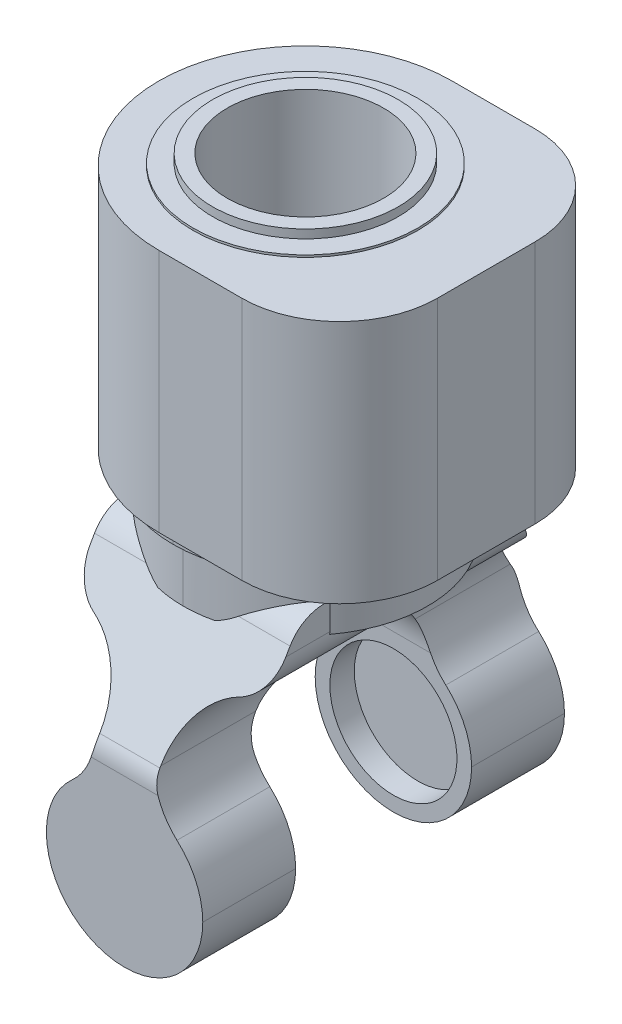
ISO-10303-21;
HEADER;
FILE_DESCRIPTION(('STEP AP214'),'2;1');
FILE_NAME('part.step','',(''),(''),'','','');
FILE_SCHEMA(('AUTOMOTIVE_DESIGN { 1 0 10303 214 1 1 1 1 }'));
ENDSEC;
DATA;
#1=APPLICATION_CONTEXT('core data for automotive mechanical design processes');
#2=APPLICATION_PROTOCOL_DEFINITION('international standard','automotive_design',2000,#1);
#3=PRODUCT_CONTEXT('',#1,'mechanical');
#4=PRODUCT('Part','Part','',(#3));
#5=PRODUCT_RELATED_PRODUCT_CATEGORY('part','',(#4));
#6=PRODUCT_DEFINITION_FORMATION('','',#4);
#7=PRODUCT_DEFINITION_CONTEXT('part definition',#1,'design');
#8=PRODUCT_DEFINITION('design','',#6,#7);
#9=PRODUCT_DEFINITION_SHAPE('','',#8);
#10=(LENGTH_UNIT() NAMED_UNIT(*) SI_UNIT(.MILLI.,.METRE.));
#11=(NAMED_UNIT(*) PLANE_ANGLE_UNIT() SI_UNIT($,.RADIAN.));
#12=(NAMED_UNIT(*) SI_UNIT($,.STERADIAN.) SOLID_ANGLE_UNIT());
#13=UNCERTAINTY_MEASURE_WITH_UNIT(LENGTH_MEASURE(1.E-05),#10,'distance_accuracy_value','');
#14=(GEOMETRIC_REPRESENTATION_CONTEXT(3) GLOBAL_UNCERTAINTY_ASSIGNED_CONTEXT((#13)) GLOBAL_UNIT_ASSIGNED_CONTEXT((#10,
#11,#12)) REPRESENTATION_CONTEXT('',''));
#15=CARTESIAN_POINT('',(0.,0.,0.));
#16=DIRECTION('',(0.,0.,1.));
#17=DIRECTION('',(1.,0.,0.));
#18=AXIS2_PLACEMENT_3D('',#15,#16,#17);
#19=CARTESIAN_POINT('',(23.9393926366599,-15.52,-50.7784834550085));
#20=DIRECTION('',(1.56103907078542E-07,0.,0.999999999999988));
#21=DIRECTION('',(0.999999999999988,0.,-1.56103907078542E-07));
#22=AXIS2_PLACEMENT_3D('',#19,#20,#21);
#23=PLANE('',#22);
#24=DIRECTION('',(0.999999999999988,0.,-1.56103907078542E-07));
#25=VECTOR('',#24,1.);
#26=CARTESIAN_POINT('',(23.9393926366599,9.48000000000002,-50.7784834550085));
#27=LINE('',#26,#25);
#28=CARTESIAN_POINT('',(23.9393926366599,9.48000000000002,-50.7784834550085));
#29=VERTEX_POINT('',#28);
#30=CARTESIAN_POINT('',(32.4393926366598,9.48000000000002,-50.7784847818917));
#31=VERTEX_POINT('',#30);
#32=EDGE_CURVE('E475',#29,#31,#27,.T.);
#33=ORIENTED_EDGE('',*,*,#32,.F.);
#34=DIRECTION('',(0.,1.,0.));
#35=VECTOR('',#34,1.);
#36=CARTESIAN_POINT('',(23.9393926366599,-15.52,-50.7784834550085));
#37=LINE('',#36,#35);
#38=CARTESIAN_POINT('',(23.9393926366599,-15.52,-50.7784834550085));
#39=VERTEX_POINT('',#38);
#40=EDGE_CURVE('E470',#39,#29,#37,.T.);
#41=ORIENTED_EDGE('',*,*,#40,.F.);
#42=DIRECTION('',(0.999999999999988,0.,-1.56103907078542E-07));
#43=VECTOR('',#42,1.);
#44=CARTESIAN_POINT('',(23.9393926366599,-15.52,-50.7784834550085));
#45=LINE('',#44,#43);
#46=CARTESIAN_POINT('',(32.4393926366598,-15.52,-50.7784847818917));
#47=VERTEX_POINT('',#46);
#48=EDGE_CURVE('E473',#39,#47,#45,.T.);
#49=ORIENTED_EDGE('',*,*,#48,.T.);
#50=DIRECTION('',(0.,1.,0.));
#51=VECTOR('',#50,1.);
#52=CARTESIAN_POINT('',(32.4393926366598,-15.52,-50.7784847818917));
#53=LINE('',#52,#51);
#54=EDGE_CURVE('E581',#47,#31,#53,.T.);
#55=ORIENTED_EDGE('',*,*,#54,.T.);
#56=EDGE_LOOP('',(#33,#41,#49,#55));
#57=FACE_BOUND('',#56,.T.);
#58=ADVANCED_FACE('F17',(#57),#23,.T.);
#59=CARTESIAN_POINT('',(32.4393910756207,-15.52,-60.7784847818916));
#60=DIRECTION('',(0.,1.,0.));
#61=DIRECTION('',(1.56103907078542E-07,0.,0.999999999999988));
#62=AXIS2_PLACEMENT_3D('',#59,#60,#61);
#63=CYLINDRICAL_SURFACE('',#62,10.);
#64=CARTESIAN_POINT('',(32.4393910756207,9.48000000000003,-60.7784847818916));
#65=DIRECTION('',(0.,1.,0.));
#66=DIRECTION('',(-1.56103907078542E-07,0.,-0.999999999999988));
#67=AXIS2_PLACEMENT_3D('',#64,#65,#66);
#68=CIRCLE('',#67,10.);
#69=CARTESIAN_POINT('',(42.4393910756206,9.48000000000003,-60.7784863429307));
#70=VERTEX_POINT('',#69);
#71=EDGE_CURVE('E508',#31,#70,#68,.T.);
#72=ORIENTED_EDGE('',*,*,#71,.F.);
#73=ORIENTED_EDGE('',*,*,#54,.F.);
#74=CARTESIAN_POINT('',(32.4393910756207,-15.52,-60.7784847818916));
#75=DIRECTION('',(0.,1.,0.));
#76=DIRECTION('',(-1.56103907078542E-07,0.,-0.999999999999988));
#77=AXIS2_PLACEMENT_3D('',#74,#75,#76);
#78=CIRCLE('',#77,10.);
#79=CARTESIAN_POINT('',(42.4393910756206,-15.52,-60.7784863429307));
#80=VERTEX_POINT('',#79);
#81=EDGE_CURVE('E496',#47,#80,#78,.T.);
#82=ORIENTED_EDGE('',*,*,#81,.T.);
#83=DIRECTION('',(0.,1.,0.));
#84=VECTOR('',#83,1.);
#85=CARTESIAN_POINT('',(42.4393910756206,-15.52,-60.7784863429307));
#86=LINE('',#85,#84);
#87=EDGE_CURVE('E570',#80,#70,#86,.T.);
#88=ORIENTED_EDGE('',*,*,#87,.T.);
#89=EDGE_LOOP('',(#72,#73,#82,#88));
#90=FACE_BOUND('',#89,.T.);
#91=ADVANCED_FACE('F1443',(#90),#63,.T.);
#92=CARTESIAN_POINT('',(42.4393910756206,-15.52,-60.7784863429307));
#93=DIRECTION('',(0.999999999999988,0.,-1.56103907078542E-07));
#94=DIRECTION('',(0.,1.,0.));
#95=AXIS2_PLACEMENT_3D('',#92,#93,#94);
#96=PLANE('',#95);
#97=DIRECTION('',(-1.56103907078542E-07,0.,-0.999999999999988));
#98=VECTOR('',#97,1.);
#99=CARTESIAN_POINT('',(42.4393910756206,9.48000000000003,-60.7784863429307));
#100=LINE('',#99,#98);
#101=CARTESIAN_POINT('',(42.4393895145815,9.48000000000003,-70.7784863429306));
#102=VERTEX_POINT('',#101);
#103=EDGE_CURVE('E684',#70,#102,#100,.T.);
#104=ORIENTED_EDGE('',*,*,#103,.F.);
#105=ORIENTED_EDGE('',*,*,#87,.F.);
#106=DIRECTION('',(-1.56103907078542E-07,0.,-0.999999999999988));
#107=VECTOR('',#106,1.);
#108=CARTESIAN_POINT('',(42.4393910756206,-15.52,-60.7784863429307));
#109=LINE('',#108,#107);
#110=CARTESIAN_POINT('',(42.4393895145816,-15.52,-70.7784863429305));
#111=VERTEX_POINT('',#110);
#112=EDGE_CURVE('E513',#80,#111,#109,.T.);
#113=ORIENTED_EDGE('',*,*,#112,.T.);
#114=DIRECTION('',(0.,1.,0.));
#115=VECTOR('',#114,1.);
#116=CARTESIAN_POINT('',(42.4393895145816,-15.52,-70.7784863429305));
#117=LINE('',#116,#115);
#118=EDGE_CURVE('E522',#111,#102,#117,.T.);
#119=ORIENTED_EDGE('',*,*,#118,.T.);
#120=EDGE_LOOP('',(#104,#105,#113,#119));
#121=FACE_BOUND('',#120,.T.);
#122=ADVANCED_FACE('F1439',(#121),#96,.T.);
#123=CARTESIAN_POINT('',(32.4393895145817,-15.52,-70.7784847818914));
#124=DIRECTION('',(0.,1.,0.));
#125=DIRECTION('',(1.56103907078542E-07,0.,0.999999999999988));
#126=AXIS2_PLACEMENT_3D('',#123,#124,#125);
#127=CYLINDRICAL_SURFACE('',#126,10.);
#128=CARTESIAN_POINT('',(32.4393895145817,9.48000000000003,-70.7784847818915));
#129=DIRECTION('',(0.,1.,0.));
#130=DIRECTION('',(1.56103907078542E-07,0.,0.999999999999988));
#131=AXIS2_PLACEMENT_3D('',#128,#129,#130);
#132=CIRCLE('',#131,10.);
#133=CARTESIAN_POINT('',(32.4393879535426,9.48000000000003,-80.7784847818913));
#134=VERTEX_POINT('',#133);
#135=EDGE_CURVE('E680',#102,#134,#132,.T.);
#136=ORIENTED_EDGE('',*,*,#135,.F.);
#137=ORIENTED_EDGE('',*,*,#118,.F.);
#138=CARTESIAN_POINT('',(32.4393895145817,-15.52,-70.7784847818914));
#139=DIRECTION('',(0.,1.,0.));
#140=DIRECTION('',(1.56103907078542E-07,0.,0.999999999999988));
#141=AXIS2_PLACEMENT_3D('',#138,#139,#140);
#142=CIRCLE('',#141,10.);
#143=CARTESIAN_POINT('',(32.4393879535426,-15.52,-80.7784847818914));
#144=VERTEX_POINT('',#143);
#145=EDGE_CURVE('E1354',#111,#144,#142,.T.);
#146=ORIENTED_EDGE('',*,*,#145,.T.);
#147=DIRECTION('',(0.,1.,0.));
#148=VECTOR('',#147,1.);
#149=CARTESIAN_POINT('',(32.4393879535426,-15.52,-80.7784847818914));
#150=LINE('',#149,#148);
#151=EDGE_CURVE('E480',#144,#134,#150,.T.);
#152=ORIENTED_EDGE('',*,*,#151,.T.);
#153=EDGE_LOOP('',(#136,#137,#146,#152));
#154=FACE_BOUND('',#153,.T.);
#155=ADVANCED_FACE('F1436',(#154),#127,.T.);
#156=CARTESIAN_POINT('',(23.9393879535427,-15.52,-80.7784834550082));
#157=DIRECTION('',(-1.56103907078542E-07,0.,-0.999999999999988));
#158=DIRECTION('',(-0.999999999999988,0.,1.56103907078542E-07));
#159=AXIS2_PLACEMENT_3D('',#156,#157,#158);
#160=PLANE('',#159);
#161=DIRECTION('',(-0.999999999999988,0.,1.56103907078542E-07));
#162=VECTOR('',#161,1.);
#163=CARTESIAN_POINT('',(23.9393879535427,9.48000000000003,-80.7784834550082));
#164=LINE('',#163,#162);
#165=CARTESIAN_POINT('',(23.9393879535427,9.48000000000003,-80.7784834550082));
#166=VERTEX_POINT('',#165);
#167=EDGE_CURVE('E548',#134,#166,#164,.T.);
#168=ORIENTED_EDGE('',*,*,#167,.F.);
#169=ORIENTED_EDGE('',*,*,#151,.F.);
#170=DIRECTION('',(-0.999999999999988,0.,1.56103907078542E-07));
#171=VECTOR('',#170,1.);
#172=CARTESIAN_POINT('',(23.9393879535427,-15.52,-80.7784834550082));
#173=LINE('',#172,#171);
#174=CARTESIAN_POINT('',(23.9393879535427,-15.52,-80.7784834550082));
#175=VERTEX_POINT('',#174);
#176=EDGE_CURVE('E490',#144,#175,#173,.T.);
#177=ORIENTED_EDGE('',*,*,#176,.T.);
#178=DIRECTION('',(0.,1.,0.));
#179=VECTOR('',#178,1.);
#180=CARTESIAN_POINT('',(23.9393879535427,-15.52,-80.7784834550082));
#181=LINE('',#180,#179);
#182=EDGE_CURVE('E481',#175,#166,#181,.T.);
#183=ORIENTED_EDGE('',*,*,#182,.T.);
#184=EDGE_LOOP('',(#168,#169,#177,#183));
#185=FACE_BOUND('',#184,.T.);
#186=ADVANCED_FACE('F1432',(#185),#160,.T.);
#187=CARTESIAN_POINT('',(23.9393902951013,-15.52,-65.7784834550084));
#188=DIRECTION('',(0.,1.,0.));
#189=DIRECTION('',(1.56103907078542E-07,0.,0.999999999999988));
#190=AXIS2_PLACEMENT_3D('',#187,#188,#189);
#191=CYLINDRICAL_SURFACE('',#190,15.);
#192=CARTESIAN_POINT('',(23.9393902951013,9.48000000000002,-65.7784834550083));
#193=DIRECTION('',(0.,1.,0.));
#194=DIRECTION('',(1.56103907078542E-07,0.,0.999999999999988));
#195=AXIS2_PLACEMENT_3D('',#192,#193,#194);
#196=CIRCLE('',#195,15.);
#197=EDGE_CURVE('E552',#166,#29,#196,.T.);
#198=ORIENTED_EDGE('',*,*,#197,.F.);
#199=ORIENTED_EDGE('',*,*,#182,.F.);
#200=CARTESIAN_POINT('',(23.9393902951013,-15.52,-65.7784834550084));
#201=DIRECTION('',(0.,1.,0.));
#202=DIRECTION('',(1.56103907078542E-07,0.,0.999999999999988));
#203=AXIS2_PLACEMENT_3D('',#200,#201,#202);
#204=CIRCLE('',#203,15.);
#205=EDGE_CURVE('E484',#175,#39,#204,.T.);
#206=ORIENTED_EDGE('',*,*,#205,.T.);
#207=ORIENTED_EDGE('',*,*,#40,.T.);
#208=EDGE_LOOP('',(#198,#199,#206,#207));
#209=FACE_BOUND('',#208,.T.);
#210=ADVANCED_FACE('F485',(#209),#191,.T.);
#211=CARTESIAN_POINT('',(43.9393902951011,9.48000000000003,-65.7784865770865));
#212=DIRECTION('',(0.,1.,0.));
#213=DIRECTION('',(1.56103906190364E-07,0.,0.999999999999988));
#214=AXIS2_PLACEMENT_3D('',#211,#212,#213);
#215=PLANE('',#214);
#216=CARTESIAN_POINT('',(23.9393902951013,9.48000000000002,-65.7784834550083));
#217=DIRECTION('',(0.,-1.,0.));
#218=DIRECTION('',(-1.56103907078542E-07,0.,-0.999999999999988));
#219=AXIS2_PLACEMENT_3D('',#216,#217,#218);
#220=CIRCLE('',#219,11.5);
#221=CARTESIAN_POINT('',(23.9393920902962,9.48000000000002,-54.2784834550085));
#222=VERTEX_POINT('',#221);
#223=CARTESIAN_POINT('',(23.9393884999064,9.48000000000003,-77.2784834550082));
#224=VERTEX_POINT('',#223);
#225=EDGE_CURVE('E732',#222,#224,#220,.T.);
#226=ORIENTED_EDGE('',*,*,#225,.T.);
#227=CARTESIAN_POINT('',(23.9393902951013,9.48000000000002,-65.7784834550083));
#228=DIRECTION('',(0.,-1.,0.));
#229=DIRECTION('',(-1.56103907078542E-07,0.,-0.999999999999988));
#230=AXIS2_PLACEMENT_3D('',#227,#228,#229);
#231=CIRCLE('',#230,11.5);
#232=EDGE_CURVE('E498',#224,#222,#231,.T.);
#233=ORIENTED_EDGE('',*,*,#232,.T.);
#234=EDGE_LOOP('',(#226,#233));
#235=FACE_BOUND('',#234,.T.);
#236=ORIENTED_EDGE('',*,*,#167,.T.);
#237=ORIENTED_EDGE('',*,*,#197,.T.);
#238=ORIENTED_EDGE('',*,*,#32,.T.);
#239=ORIENTED_EDGE('',*,*,#71,.T.);
#240=ORIENTED_EDGE('',*,*,#103,.T.);
#241=ORIENTED_EDGE('',*,*,#135,.T.);
#242=EDGE_LOOP('',(#236,#237,#238,#239,#240,#241));
#243=FACE_BOUND('',#242,.T.);
#244=ADVANCED_FACE('F1446',(#235,#243),#215,.T.);
#245=CARTESIAN_POINT('',(35.4393902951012,-15.52,-65.7784852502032));
#246=DIRECTION('',(0.,-1.,0.));
#247=DIRECTION('',(1.56103906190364E-07,0.,0.999999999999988));
#248=AXIS2_PLACEMENT_3D('',#245,#246,#247);
#249=PLANE('',#248);
#250=CARTESIAN_POINT('',(23.9393902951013,-15.52,-65.7784834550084));
#251=DIRECTION('',(0.,1.,0.));
#252=DIRECTION('',(-1.56103906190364E-07,0.,-0.999999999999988));
#253=AXIS2_PLACEMENT_3D('',#250,#251,#252);
#254=CIRCLE('',#253,13.545);
#255=CARTESIAN_POINT('',(23.9393881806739,-15.52,-79.3234834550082));
#256=VERTEX_POINT('',#255);
#257=CARTESIAN_POINT('',(23.9393924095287,-15.52,-52.2334834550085));
#258=VERTEX_POINT('',#257);
#259=EDGE_CURVE('E1528',#256,#258,#254,.T.);
#260=ORIENTED_EDGE('',*,*,#259,.T.);
#261=CARTESIAN_POINT('',(23.9393902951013,-15.52,-65.7784834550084));
#262=DIRECTION('',(0.,1.,0.));
#263=DIRECTION('',(-1.56103906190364E-07,0.,-0.999999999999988));
#264=AXIS2_PLACEMENT_3D('',#261,#262,#263);
#265=CIRCLE('',#264,13.545);
#266=EDGE_CURVE('E1549',#258,#256,#265,.T.);
#267=ORIENTED_EDGE('',*,*,#266,.T.);
#268=EDGE_LOOP('',(#260,#267));
#269=FACE_BOUND('',#268,.T.);
#270=ORIENTED_EDGE('',*,*,#48,.F.);
#271=ORIENTED_EDGE('',*,*,#205,.F.);
#272=ORIENTED_EDGE('',*,*,#176,.F.);
#273=ORIENTED_EDGE('',*,*,#145,.F.);
#274=ORIENTED_EDGE('',*,*,#112,.F.);
#275=ORIENTED_EDGE('',*,*,#81,.F.);
#276=EDGE_LOOP('',(#270,#271,#272,#273,#274,#275));
#277=FACE_BOUND('',#276,.T.);
#278=ADVANCED_FACE('F493',(#269,#277),#249,.T.);
#279=CARTESIAN_POINT('',(23.9393902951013,9.70000000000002,-65.7784834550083));
#280=DIRECTION('',(0.,-1.,0.));
#281=DIRECTION('',(1.56103906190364E-07,0.,0.999999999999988));
#282=AXIS2_PLACEMENT_3D('',#279,#280,#281);
#283=CYLINDRICAL_SURFACE('',#282,11.5);
#284=DIRECTION('',(0.,-1.,0.));
#285=VECTOR('',#284,1.);
#286=CARTESIAN_POINT('',(23.9393884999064,9.70000000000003,-77.2784834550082));
#287=LINE('',#286,#285);
#288=CARTESIAN_POINT('',(23.9393884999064,9.70000000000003,-77.2784834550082));
#289=VERTEX_POINT('',#288);
#290=EDGE_CURVE('E725',#289,#224,#287,.T.);
#291=ORIENTED_EDGE('',*,*,#290,.F.);
#292=CARTESIAN_POINT('',(23.9393902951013,9.70000000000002,-65.7784834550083));
#293=DIRECTION('',(0.,1.,0.));
#294=DIRECTION('',(-1.56103906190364E-07,0.,-0.999999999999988));
#295=AXIS2_PLACEMENT_3D('',#292,#293,#294);
#296=CIRCLE('',#295,11.5);
#297=CARTESIAN_POINT('',(23.9393920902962,9.70000000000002,-54.2784834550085));
#298=VERTEX_POINT('',#297);
#299=EDGE_CURVE('E598',#298,#289,#296,.T.);
#300=ORIENTED_EDGE('',*,*,#299,.F.);
#301=DIRECTION('',(0.,-1.,0.));
#302=VECTOR('',#301,1.);
#303=CARTESIAN_POINT('',(23.9393920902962,9.70000000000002,-54.2784834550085));
#304=LINE('',#303,#302);
#305=EDGE_CURVE('E709',#298,#222,#304,.T.);
#306=ORIENTED_EDGE('',*,*,#305,.T.);
#307=ORIENTED_EDGE('',*,*,#232,.F.);
#308=EDGE_LOOP('',(#291,#300,#306,#307));
#309=FACE_BOUND('',#308,.T.);
#310=ADVANCED_FACE('F1455',(#309),#283,.T.);
#311=CARTESIAN_POINT('',(23.9393902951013,9.70000000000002,-65.7784834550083));
#312=DIRECTION('',(0.,1.,0.));
#313=DIRECTION('',(-0.999999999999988,0.,1.56103906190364E-07));
#314=AXIS2_PLACEMENT_3D('',#311,#312,#313);
#315=PLANE('',#314);
#316=CARTESIAN_POINT('',(23.9393902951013,9.70000000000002,-65.7784834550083));
#317=DIRECTION('',(0.,1.,0.));
#318=DIRECTION('',(-1.56103906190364E-07,0.,-0.999999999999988));
#319=AXIS2_PLACEMENT_3D('',#316,#317,#318);
#320=CIRCLE('',#319,9.5);
#321=CARTESIAN_POINT('',(23.9393888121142,9.70000000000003,-75.2784834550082));
#322=VERTEX_POINT('',#321);
#323=EDGE_CURVE('E504',#322,#322,#320,.T.);
#324=ORIENTED_EDGE('',*,*,#323,.F.);
#325=EDGE_LOOP('',(#324));
#326=FACE_BOUND('',#325,.T.);
#327=ORIENTED_EDGE('',*,*,#299,.T.);
#328=CARTESIAN_POINT('',(23.9393902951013,9.70000000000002,-65.7784834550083));
#329=DIRECTION('',(0.,1.,0.));
#330=DIRECTION('',(-1.56103906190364E-07,0.,-0.999999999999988));
#331=AXIS2_PLACEMENT_3D('',#328,#329,#330);
#332=CIRCLE('',#331,11.5);
#333=EDGE_CURVE('E704',#289,#298,#332,.T.);
#334=ORIENTED_EDGE('',*,*,#333,.T.);
#335=EDGE_LOOP('',(#327,#334));
#336=FACE_BOUND('',#335,.T.);
#337=ADVANCED_FACE('F2077',(#326,#336),#315,.T.);
#338=CARTESIAN_POINT('',(23.9393902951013,9.70000000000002,-65.7784834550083));
#339=DIRECTION('',(0.,-1.,0.));
#340=DIRECTION('',(1.56103906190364E-07,0.,0.999999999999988));
#341=AXIS2_PLACEMENT_3D('',#338,#339,#340);
#342=CYLINDRICAL_SURFACE('',#341,11.5);
#343=ORIENTED_EDGE('',*,*,#333,.F.);
#344=ORIENTED_EDGE('',*,*,#290,.T.);
#345=ORIENTED_EDGE('',*,*,#225,.F.);
#346=ORIENTED_EDGE('',*,*,#305,.F.);
#347=EDGE_LOOP('',(#343,#344,#345,#346));
#348=FACE_BOUND('',#347,.T.);
#349=ADVANCED_FACE('F1496',(#348),#342,.T.);
#350=CARTESIAN_POINT('',(23.9393902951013,-15.52,-65.7784834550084));
#351=DIRECTION('',(0.,-1.,0.));
#352=DIRECTION('',(1.56103906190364E-07,0.,0.999999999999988));
#353=AXIS2_PLACEMENT_3D('',#350,#351,#352);
#354=CYLINDRICAL_SURFACE('',#353,13.545);
#355=ORIENTED_EDGE('',*,*,#259,.F.);
#356=DIRECTION('',(0.,-1.,0.));
#357=VECTOR('',#356,1.);
#358=CARTESIAN_POINT('',(23.9393881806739,-15.52,-79.3234834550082));
#359=LINE('',#358,#357);
#360=CARTESIAN_POINT('',(23.9393881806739,-17.3,-79.3234834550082));
#361=VERTEX_POINT('',#360);
#362=EDGE_CURVE('E1530',#256,#361,#359,.T.);
#363=ORIENTED_EDGE('',*,*,#362,.T.);
#364=CARTESIAN_POINT('',(23.9393902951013,-17.3,-65.7784834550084));
#365=DIRECTION('',(0.,1.,0.));
#366=DIRECTION('',(-1.56103906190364E-07,0.,-0.999999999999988));
#367=AXIS2_PLACEMENT_3D('',#364,#365,#366);
#368=CIRCLE('',#367,13.545);
#369=CARTESIAN_POINT('',(23.9393924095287,-17.3,-52.2334834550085));
#370=VERTEX_POINT('',#369);
#371=EDGE_CURVE('E1526',#361,#370,#368,.T.);
#372=ORIENTED_EDGE('',*,*,#371,.T.);
#373=DIRECTION('',(0.,-1.,0.));
#374=VECTOR('',#373,1.);
#375=CARTESIAN_POINT('',(23.9393924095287,-15.52,-52.2334834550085));
#376=LINE('',#375,#374);
#377=EDGE_CURVE('E1550',#258,#370,#376,.T.);
#378=ORIENTED_EDGE('',*,*,#377,.F.);
#379=EDGE_LOOP('',(#355,#363,#372,#378));
#380=FACE_BOUND('',#379,.T.);
#381=ADVANCED_FACE('F1487',(#380),#354,.T.);
#382=CARTESIAN_POINT('',(23.9393902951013,-17.3,-65.7784834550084));
#383=DIRECTION('',(0.,1.,0.));
#384=DIRECTION('',(-0.999999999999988,0.,1.56103906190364E-07));
#385=AXIS2_PLACEMENT_3D('',#382,#383,#384);
#386=PLANE('',#385);
#387=CARTESIAN_POINT('',(23.9393902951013,-17.3,-65.7784834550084));
#388=DIRECTION('',(0.,1.,0.));
#389=DIRECTION('',(-1.56103906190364E-07,0.,-0.999999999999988));
#390=AXIS2_PLACEMENT_3D('',#387,#388,#389);
#391=CIRCLE('',#390,12.5);
#392=CARTESIAN_POINT('',(23.9393883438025,-17.3,-78.2784834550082));
#393=VERTEX_POINT('',#392);
#394=CARTESIAN_POINT('',(23.9393922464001,-17.3,-53.2784834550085));
#395=VERTEX_POINT('',#394);
#396=EDGE_CURVE('E593',#393,#395,#391,.T.);
#397=ORIENTED_EDGE('',*,*,#396,.T.);
#398=CARTESIAN_POINT('',(23.9393902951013,-17.3,-65.7784834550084));
#399=DIRECTION('',(0.,1.,0.));
#400=DIRECTION('',(-1.56103906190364E-07,0.,-0.999999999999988));
#401=AXIS2_PLACEMENT_3D('',#398,#399,#400);
#402=CIRCLE('',#401,12.5);
#403=EDGE_CURVE('E556',#395,#393,#402,.T.);
#404=ORIENTED_EDGE('',*,*,#403,.T.);
#405=EDGE_LOOP('',(#397,#404));
#406=FACE_BOUND('',#405,.T.);
#407=CARTESIAN_POINT('',(23.9393902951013,-17.3,-65.7784834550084));
#408=DIRECTION('',(0.,1.,0.));
#409=DIRECTION('',(-1.56103906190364E-07,0.,-0.999999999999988));
#410=AXIS2_PLACEMENT_3D('',#407,#408,#409);
#411=CIRCLE('',#410,13.545);
#412=EDGE_CURVE('E28',#370,#361,#411,.T.);
#413=ORIENTED_EDGE('',*,*,#412,.F.);
#414=ORIENTED_EDGE('',*,*,#371,.F.);
#415=EDGE_LOOP('',(#413,#414));
#416=FACE_BOUND('',#415,.T.);
#417=ADVANCED_FACE('F1484',(#406,#416),#386,.F.);
#418=CARTESIAN_POINT('',(23.9393902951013,-15.52,-65.7784834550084));
#419=DIRECTION('',(0.,-1.,0.));
#420=DIRECTION('',(1.56103906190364E-07,0.,0.999999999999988));
#421=AXIS2_PLACEMENT_3D('',#418,#419,#420);
#422=CYLINDRICAL_SURFACE('',#421,13.545);
#423=ORIENTED_EDGE('',*,*,#362,.F.);
#424=ORIENTED_EDGE('',*,*,#266,.F.);
#425=ORIENTED_EDGE('',*,*,#377,.T.);
#426=ORIENTED_EDGE('',*,*,#412,.T.);
#427=EDGE_LOOP('',(#423,#424,#425,#426));
#428=FACE_BOUND('',#427,.T.);
#429=ADVANCED_FACE('F19',(#428),#422,.T.);
#430=CARTESIAN_POINT('',(23.939387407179,-44.3,-84.2784834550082));
#431=DIRECTION('',(1.56103906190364E-07,0.,0.999999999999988));
#432=DIRECTION('',(-0.999999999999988,0.,1.56103906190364E-07));
#433=AXIS2_PLACEMENT_3D('',#430,#431,#432);
#434=CYLINDRICAL_SURFACE('',#433,8.);
#435=CARTESIAN_POINT('',(23.9393917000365,-44.3,-56.7784834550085));
#436=DIRECTION('',(1.56103906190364E-07,0.,0.999999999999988));
#437=DIRECTION('',(0.,-1.,0.));
#438=AXIS2_PLACEMENT_3D('',#435,#436,#437);
#439=CIRCLE('',#438,8.);
#440=CARTESIAN_POINT('',(15.9393917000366,-44.3,-56.7784822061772));
#441=VERTEX_POINT('',#440);
#442=CARTESIAN_POINT('',(31.9393917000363,-44.3,-56.7784847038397));
#443=VERTEX_POINT('',#442);
#444=EDGE_CURVE('E563',#441,#443,#439,.T.);
#445=ORIENTED_EDGE('',*,*,#444,.T.);
#446=DIRECTION('',(1.56103906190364E-07,0.,0.999999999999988));
#447=VECTOR('',#446,1.);
#448=CARTESIAN_POINT('',(31.9393874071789,-44.3,-84.2784847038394));
#449=LINE('',#448,#447);
#450=CARTESIAN_POINT('',(31.9393931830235,-44.3,-47.2784847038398));
#451=VERTEX_POINT('',#450);
#452=EDGE_CURVE('E558',#443,#451,#449,.T.);
#453=ORIENTED_EDGE('',*,*,#452,.T.);
#454=CARTESIAN_POINT('',(23.9393931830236,-44.3,-47.2784834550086));
#455=DIRECTION('',(-1.56103906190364E-07,0.,-0.999999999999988));
#456=DIRECTION('',(-0.999999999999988,0.,1.56103906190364E-07));
#457=AXIS2_PLACEMENT_3D('',#454,#455,#456);
#458=CIRCLE('',#457,8.);
#459=CARTESIAN_POINT('',(15.9393931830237,-44.3,-47.2784822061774));
#460=VERTEX_POINT('',#459);
#461=EDGE_CURVE('E562',#451,#460,#458,.T.);
#462=ORIENTED_EDGE('',*,*,#461,.T.);
#463=DIRECTION('',(1.56103906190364E-07,0.,0.999999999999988));
#464=VECTOR('',#463,1.);
#465=CARTESIAN_POINT('',(15.9393874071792,-44.3,-84.2784822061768));
#466=LINE('',#465,#464);
#467=EDGE_CURVE('E574',#441,#460,#466,.T.);
#468=ORIENTED_EDGE('',*,*,#467,.F.);
#469=EDGE_LOOP('',(#445,#453,#462,#468));
#470=FACE_BOUND('',#469,.T.);
#471=ADVANCED_FACE('F1083',(#470),#434,.T.);
#472=CARTESIAN_POINT('',(23.939387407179,-44.3,-84.2784834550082));
#473=DIRECTION('',(1.56103906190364E-07,0.,0.999999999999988));
#474=DIRECTION('',(-0.999999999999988,0.,1.56103906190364E-07));
#475=AXIS2_PLACEMENT_3D('',#472,#473,#474);
#476=CYLINDRICAL_SURFACE('',#475,8.);
#477=CARTESIAN_POINT('',(23.939387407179,-44.3,-84.2784834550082));
#478=DIRECTION('',(-1.56103906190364E-07,0.,-0.999999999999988));
#479=DIRECTION('',(-0.999999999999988,0.,1.56103906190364E-07));
#480=AXIS2_PLACEMENT_3D('',#477,#478,#479);
#481=CIRCLE('',#480,8.);
#482=CARTESIAN_POINT('',(31.9393874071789,-44.3,-84.2784847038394));
#483=VERTEX_POINT('',#482);
#484=CARTESIAN_POINT('',(15.9393874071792,-44.3,-84.2784822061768));
#485=VERTEX_POINT('',#484);
#486=EDGE_CURVE('E631',#483,#485,#481,.T.);
#487=ORIENTED_EDGE('',*,*,#486,.F.);
#488=DIRECTION('',(1.56103906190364E-07,0.,0.999999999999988));
#489=VECTOR('',#488,1.);
#490=CARTESIAN_POINT('',(31.9393874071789,-44.3,-84.2784847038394));
#491=LINE('',#490,#489);
#492=CARTESIAN_POINT('',(31.9393888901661,-44.3,-74.7784847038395));
#493=VERTEX_POINT('',#492);
#494=EDGE_CURVE('E605',#483,#493,#491,.T.);
#495=ORIENTED_EDGE('',*,*,#494,.T.);
#496=CARTESIAN_POINT('',(23.9393888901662,-44.3,-74.7784834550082));
#497=DIRECTION('',(-1.56103906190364E-07,0.,-0.999999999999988));
#498=DIRECTION('',(0.,1.,0.));
#499=AXIS2_PLACEMENT_3D('',#496,#497,#498);
#500=CIRCLE('',#499,8.);
#501=CARTESIAN_POINT('',(15.9393888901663,-44.3,-74.778482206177));
#502=VERTEX_POINT('',#501);
#503=EDGE_CURVE('E600',#493,#502,#500,.T.);
#504=ORIENTED_EDGE('',*,*,#503,.T.);
#505=DIRECTION('',(1.56103906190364E-07,0.,0.999999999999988));
#506=VECTOR('',#505,1.);
#507=CARTESIAN_POINT('',(15.9393874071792,-44.3,-84.2784822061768));
#508=LINE('',#507,#506);
#509=EDGE_CURVE('E604',#485,#502,#508,.T.);
#510=ORIENTED_EDGE('',*,*,#509,.F.);
#511=EDGE_LOOP('',(#487,#495,#504,#510));
#512=FACE_BOUND('',#511,.T.);
#513=ADVANCED_FACE('F1043',(#512),#476,.T.);
#514=CARTESIAN_POINT('',(23.939387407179,-44.3,-84.2784834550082));
#515=DIRECTION('',(1.56103906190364E-07,0.,0.999999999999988));
#516=DIRECTION('',(-0.999999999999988,0.,1.56103906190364E-07));
#517=AXIS2_PLACEMENT_3D('',#514,#515,#516);
#518=CYLINDRICAL_SURFACE('',#517,8.);
#519=ORIENTED_EDGE('',*,*,#452,.F.);
#520=CARTESIAN_POINT('',(23.9393917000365,-44.3,-56.7784834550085));
#521=DIRECTION('',(1.56103906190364E-07,0.,0.999999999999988));
#522=DIRECTION('',(0.,-1.,0.));
#523=AXIS2_PLACEMENT_3D('',#520,#521,#522);
#524=CIRCLE('',#523,8.);
#525=CARTESIAN_POINT('',(29.3002164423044,-38.3618556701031,-56.7784842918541));
#526=VERTEX_POINT('',#525);
#527=EDGE_CURVE('E670',#443,#526,#524,.T.);
#528=ORIENTED_EDGE('',*,*,#527,.T.);
#529=DIRECTION('',(1.56103906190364E-07,0.,0.999999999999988));
#530=VECTOR('',#529,1.);
#531=CARTESIAN_POINT('',(29.300212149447,-38.3618556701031,-84.2784842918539));
#532=LINE('',#531,#530);
#533=CARTESIAN_POINT('',(29.3002179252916,-38.3618556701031,-47.2784842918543));
#534=VERTEX_POINT('',#533);
#535=EDGE_CURVE('E582',#526,#534,#532,.T.);
#536=ORIENTED_EDGE('',*,*,#535,.T.);
#537=CARTESIAN_POINT('',(23.9393931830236,-44.3,-47.2784834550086));
#538=DIRECTION('',(-1.56103906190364E-07,0.,-0.999999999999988));
#539=DIRECTION('',(-0.999999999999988,0.,1.56103906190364E-07));
#540=AXIS2_PLACEMENT_3D('',#537,#538,#539);
#541=CIRCLE('',#540,8.);
#542=EDGE_CURVE('E673',#534,#451,#541,.T.);
#543=ORIENTED_EDGE('',*,*,#542,.T.);
#544=EDGE_LOOP('',(#519,#528,#536,#543));
#545=FACE_BOUND('',#544,.T.);
#546=ADVANCED_FACE('F1570',(#545),#518,.T.);
#547=CARTESIAN_POINT('',(13.9393931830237,-33.2230769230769,-47.2784818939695));
#548=DIRECTION('',(-1.56103906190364E-07,0.,-0.999999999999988));
#549=DIRECTION('',(-0.999999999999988,0.,1.56103906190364E-07));
#550=AXIS2_PLACEMENT_3D('',#547,#548,#549);
#551=PLANE('',#550);
#552=CARTESIAN_POINT('',(33.9393931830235,-33.2230769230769,-47.2784850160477));
#553=DIRECTION('',(1.56103906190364E-07,0.,0.999999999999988));
#554=DIRECTION('',(0.999999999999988,0.,-1.56103906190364E-07));
#555=AXIS2_PLACEMENT_3D('',#552,#553,#554);
#556=CIRCLE('',#555,6.92307692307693);
#557=CARTESIAN_POINT('',(27.3582080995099,-35.3717967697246,-47.278483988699));
#558=VERTEX_POINT('',#557);
#559=EDGE_CURVE('E587',#558,#534,#556,.T.);
#560=ORIENTED_EDGE('',*,*,#559,.F.);
#561=DIRECTION('',(-0.999999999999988,0.,1.56103906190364E-07));
#562=VECTOR('',#561,1.);
#563=CARTESIAN_POINT('',(20.7781964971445,-35.3717967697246,-47.2784829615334));
#564=LINE('',#563,#562);
#565=CARTESIAN_POINT('',(20.5205782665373,-35.3717967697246,-47.2784829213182));
#566=VERTEX_POINT('',#565);
#567=EDGE_CURVE('E546',#558,#566,#564,.T.);
#568=ORIENTED_EDGE('',*,*,#567,.T.);
#569=CARTESIAN_POINT('',(13.9393931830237,-33.2230769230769,-47.2784818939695));
#570=DIRECTION('',(1.56103906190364E-07,0.,0.999999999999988));
#571=DIRECTION('',(0.999999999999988,0.,-1.56103906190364E-07));
#572=AXIS2_PLACEMENT_3D('',#569,#570,#571);
#573=CIRCLE('',#572,6.92307692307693);
#574=CARTESIAN_POINT('',(18.5785684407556,-38.3618556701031,-47.2784826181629));
#575=VERTEX_POINT('',#574);
#576=EDGE_CURVE('E1088',#575,#566,#573,.T.);
#577=ORIENTED_EDGE('',*,*,#576,.F.);
#578=CARTESIAN_POINT('',(23.9393931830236,-44.3,-47.2784834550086));
#579=DIRECTION('',(-1.56103906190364E-07,0.,-0.999999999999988));
#580=DIRECTION('',(-0.999999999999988,0.,1.56103906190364E-07));
#581=AXIS2_PLACEMENT_3D('',#578,#579,#580);
#582=CIRCLE('',#581,8.);
#583=EDGE_CURVE('E578',#460,#575,#582,.T.);
#584=ORIENTED_EDGE('',*,*,#583,.F.);
#585=ORIENTED_EDGE('',*,*,#461,.F.);
#586=ORIENTED_EDGE('',*,*,#542,.F.);
#587=EDGE_LOOP('',(#560,#568,#577,#584,#585,#586));
#588=FACE_BOUND('',#587,.T.);
#589=ADVANCED_FACE('F1476',(#588),#551,.F.);
#590=CARTESIAN_POINT('',(23.939387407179,-44.3,-84.2784834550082));
#591=DIRECTION('',(1.56103906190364E-07,0.,0.999999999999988));
#592=DIRECTION('',(-0.999999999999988,0.,1.56103906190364E-07));
#593=AXIS2_PLACEMENT_3D('',#590,#591,#592);
#594=CYLINDRICAL_SURFACE('',#593,8.);
#595=CARTESIAN_POINT('',(23.9393917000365,-44.3,-56.7784834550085));
#596=DIRECTION('',(1.56103906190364E-07,0.,0.999999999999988));
#597=DIRECTION('',(0.,-1.,0.));
#598=AXIS2_PLACEMENT_3D('',#595,#596,#597);
#599=CIRCLE('',#598,8.);
#600=CARTESIAN_POINT('',(18.5785669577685,-38.3618556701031,-56.7784826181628));
#601=VERTEX_POINT('',#600);
#602=EDGE_CURVE('E575',#601,#441,#599,.T.);
#603=ORIENTED_EDGE('',*,*,#602,.T.);
#604=ORIENTED_EDGE('',*,*,#467,.T.);
#605=ORIENTED_EDGE('',*,*,#583,.T.);
#606=DIRECTION('',(1.56103906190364E-07,0.,0.999999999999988));
#607=VECTOR('',#606,1.);
#608=CARTESIAN_POINT('',(18.578562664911,-38.3618556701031,-84.2784826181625));
#609=LINE('',#608,#607);
#610=EDGE_CURVE('E669',#601,#575,#609,.T.);
#611=ORIENTED_EDGE('',*,*,#610,.F.);
#612=EDGE_LOOP('',(#603,#604,#605,#611));
#613=FACE_BOUND('',#612,.T.);
#614=ADVANCED_FACE('F1473',(#613),#594,.T.);
#615=CARTESIAN_POINT('',(3.93939170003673,-36.3,-56.7784803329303));
#616=DIRECTION('',(1.56103906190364E-07,0.,0.999999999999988));
#617=DIRECTION('',(0.999999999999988,0.,-1.56103906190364E-07));
#618=AXIS2_PLACEMENT_3D('',#615,#616,#617);
#619=PLANE('',#618);
#620=CARTESIAN_POINT('',(23.9393917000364,-44.3,-56.7784834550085));
#621=DIRECTION('',(1.56103906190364E-07,0.,0.999999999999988));
#622=DIRECTION('',(0.999999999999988,0.,-1.56103906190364E-07));
#623=AXIS2_PLACEMENT_3D('',#620,#621,#622);
#624=CIRCLE('',#623,6.5);
#625=CARTESIAN_POINT('',(30.4393917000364,-44.3,-56.7784844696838));
#626=VERTEX_POINT('',#625);
#627=EDGE_CURVE('E2929',#626,#626,#624,.F.);
#628=ORIENTED_EDGE('',*,*,#627,.F.);
#629=EDGE_LOOP('',(#628));
#630=FACE_BOUND('',#629,.T.);
#631=ORIENTED_EDGE('',*,*,#602,.F.);
#632=CARTESIAN_POINT('',(13.9393917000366,-33.2230769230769,-56.7784818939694));
#633=DIRECTION('',(-1.56103906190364E-07,0.,-0.999999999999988));
#634=DIRECTION('',(0.,-1.,0.));
#635=AXIS2_PLACEMENT_3D('',#632,#633,#634);
#636=CIRCLE('',#635,6.92307692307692);
#637=CARTESIAN_POINT('',(20.1411284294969,-36.3,-56.7784828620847));
#638=VERTEX_POINT('',#637);
#639=EDGE_CURVE('E1125',#638,#601,#636,.T.);
#640=ORIENTED_EDGE('',*,*,#639,.F.);
#641=DIRECTION('',(0.999999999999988,0.,-1.56103906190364E-07));
#642=VECTOR('',#641,1.);
#643=CARTESIAN_POINT('',(3.93939170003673,-36.3,-56.7784803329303));
#644=LINE('',#643,#642);
#645=CARTESIAN_POINT('',(27.737654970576,-36.3,-56.7784840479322));
#646=VERTEX_POINT('',#645);
#647=EDGE_CURVE('E1144',#638,#646,#644,.T.);
#648=ORIENTED_EDGE('',*,*,#647,.T.);
#649=CARTESIAN_POINT('',(33.9393917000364,-33.2230769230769,-56.7784850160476));
#650=DIRECTION('',(-1.56103906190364E-07,0.,-0.999999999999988));
#651=DIRECTION('',(0.,-1.,0.));
#652=AXIS2_PLACEMENT_3D('',#649,#650,#651);
#653=CIRCLE('',#652,6.92307692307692);
#654=EDGE_CURVE('E586',#526,#646,#653,.T.);
#655=ORIENTED_EDGE('',*,*,#654,.F.);
#656=ORIENTED_EDGE('',*,*,#527,.F.);
#657=ORIENTED_EDGE('',*,*,#444,.F.);
#658=EDGE_LOOP('',(#631,#640,#648,#655,#656,#657));
#659=FACE_BOUND('',#658,.T.);
#660=ADVANCED_FACE('F891',(#630,#659),#619,.F.);
#661=CARTESIAN_POINT('',(23.939387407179,-44.3,-84.2784834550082));
#662=DIRECTION('',(1.56103906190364E-07,0.,0.999999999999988));
#663=DIRECTION('',(-0.999999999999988,0.,1.56103906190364E-07));
#664=AXIS2_PLACEMENT_3D('',#661,#662,#663);
#665=CYLINDRICAL_SURFACE('',#664,8.);
#666=CARTESIAN_POINT('',(23.939387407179,-44.3,-84.2784834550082));
#667=DIRECTION('',(-1.56103906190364E-07,0.,-0.999999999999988));
#668=DIRECTION('',(-0.999999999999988,0.,1.56103906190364E-07));
#669=AXIS2_PLACEMENT_3D('',#666,#667,#668);
#670=CIRCLE('',#669,8.);
#671=CARTESIAN_POINT('',(18.578562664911,-38.3618556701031,-84.2784826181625));
#672=VERTEX_POINT('',#671);
#673=EDGE_CURVE('E615',#485,#672,#670,.T.);
#674=ORIENTED_EDGE('',*,*,#673,.F.);
#675=ORIENTED_EDGE('',*,*,#509,.T.);
#676=CARTESIAN_POINT('',(23.9393888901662,-44.3,-74.7784834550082));
#677=DIRECTION('',(-1.56103906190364E-07,0.,-0.999999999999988));
#678=DIRECTION('',(0.,1.,0.));
#679=AXIS2_PLACEMENT_3D('',#676,#677,#678);
#680=CIRCLE('',#679,8.);
#681=CARTESIAN_POINT('',(18.5785641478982,-38.3618556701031,-74.7784826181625));
#682=VERTEX_POINT('',#681);
#683=EDGE_CURVE('E519',#502,#682,#680,.T.);
#684=ORIENTED_EDGE('',*,*,#683,.T.);
#685=DIRECTION('',(1.56103906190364E-07,0.,0.999999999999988));
#686=VECTOR('',#685,1.);
#687=CARTESIAN_POINT('',(18.578562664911,-38.3618556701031,-84.2784826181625));
#688=LINE('',#687,#686);
#689=EDGE_CURVE('E514',#672,#682,#688,.T.);
#690=ORIENTED_EDGE('',*,*,#689,.F.);
#691=EDGE_LOOP('',(#674,#675,#684,#690));
#692=FACE_BOUND('',#691,.T.);
#693=ADVANCED_FACE('F1861',(#692),#665,.T.);
#694=CARTESIAN_POINT('',(13.9393874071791,-33.2230769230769,-84.2784818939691));
#695=DIRECTION('',(-1.56103906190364E-07,0.,-0.999999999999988));
#696=DIRECTION('',(-0.999999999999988,0.,1.56103906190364E-07));
#697=AXIS2_PLACEMENT_3D('',#694,#695,#696);
#698=PLANE('',#697);
#699=CARTESIAN_POINT('',(13.9393874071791,-33.2230769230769,-84.2784818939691));
#700=DIRECTION('',(1.56103906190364E-07,0.,0.999999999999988));
#701=DIRECTION('',(0.999999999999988,0.,-1.56103906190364E-07));
#702=AXIS2_PLACEMENT_3D('',#699,#700,#701);
#703=CIRCLE('',#702,6.92307692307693);
#704=CARTESIAN_POINT('',(20.5205724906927,-35.3717967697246,-84.2784829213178));
#705=VERTEX_POINT('',#704);
#706=EDGE_CURVE('E697',#672,#705,#703,.T.);
#707=ORIENTED_EDGE('',*,*,#706,.T.);
#708=DIRECTION('',(0.999999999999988,0.,-1.56103906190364E-07));
#709=VECTOR('',#708,1.);
#710=CARTESIAN_POINT('',(13.9393874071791,-35.3717967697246,-84.2784818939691));
#711=LINE('',#710,#709);
#712=CARTESIAN_POINT('',(27.3582023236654,-35.3717967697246,-84.2784839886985));
#713=VERTEX_POINT('',#712);
#714=EDGE_CURVE('E547',#705,#713,#711,.T.);
#715=ORIENTED_EDGE('',*,*,#714,.T.);
#716=CARTESIAN_POINT('',(33.939387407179,-33.2230769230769,-84.2784850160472));
#717=DIRECTION('',(1.56103906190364E-07,0.,0.999999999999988));
#718=DIRECTION('',(0.999999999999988,0.,-1.56103906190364E-07));
#719=AXIS2_PLACEMENT_3D('',#716,#717,#718);
#720=CIRCLE('',#719,6.92307692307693);
#721=CARTESIAN_POINT('',(29.300212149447,-38.3618556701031,-84.2784842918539));
#722=VERTEX_POINT('',#721);
#723=EDGE_CURVE('E715',#713,#722,#720,.T.);
#724=ORIENTED_EDGE('',*,*,#723,.T.);
#725=CARTESIAN_POINT('',(23.939387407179,-44.3,-84.2784834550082));
#726=DIRECTION('',(-1.56103906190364E-07,0.,-0.999999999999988));
#727=DIRECTION('',(-0.999999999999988,0.,1.56103906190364E-07));
#728=AXIS2_PLACEMENT_3D('',#725,#726,#727);
#729=CIRCLE('',#728,8.);
#730=EDGE_CURVE('E543',#722,#483,#729,.T.);
#731=ORIENTED_EDGE('',*,*,#730,.T.);
#732=ORIENTED_EDGE('',*,*,#486,.T.);
#733=ORIENTED_EDGE('',*,*,#673,.T.);
#734=EDGE_LOOP('',(#707,#715,#724,#731,#732,#733));
#735=FACE_BOUND('',#734,.T.);
#736=ADVANCED_FACE('F836',(#735),#698,.T.);
#737=CARTESIAN_POINT('',(23.939387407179,-44.3,-84.2784834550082));
#738=DIRECTION('',(1.56103906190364E-07,0.,0.999999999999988));
#739=DIRECTION('',(-0.999999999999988,0.,1.56103906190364E-07));
#740=AXIS2_PLACEMENT_3D('',#737,#738,#739);
#741=CYLINDRICAL_SURFACE('',#740,8.);
#742=ORIENTED_EDGE('',*,*,#494,.F.);
#743=ORIENTED_EDGE('',*,*,#730,.F.);
#744=DIRECTION('',(1.56103906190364E-07,0.,0.999999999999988));
#745=VECTOR('',#744,1.);
#746=CARTESIAN_POINT('',(29.300212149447,-38.3618556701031,-84.2784842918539));
#747=LINE('',#746,#745);
#748=CARTESIAN_POINT('',(29.3002136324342,-38.3618556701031,-74.7784842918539));
#749=VERTEX_POINT('',#748);
#750=EDGE_CURVE('E711',#722,#749,#747,.T.);
#751=ORIENTED_EDGE('',*,*,#750,.T.);
#752=CARTESIAN_POINT('',(23.9393888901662,-44.3,-74.7784834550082));
#753=DIRECTION('',(-1.56103906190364E-07,0.,-0.999999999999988));
#754=DIRECTION('',(0.,1.,0.));
#755=AXIS2_PLACEMENT_3D('',#752,#753,#754);
#756=CIRCLE('',#755,8.);
#757=EDGE_CURVE('E1171',#749,#493,#756,.T.);
#758=ORIENTED_EDGE('',*,*,#757,.T.);
#759=EDGE_LOOP('',(#742,#743,#751,#758));
#760=FACE_BOUND('',#759,.T.);
#761=ADVANCED_FACE('F1759',(#760),#741,.T.);
#762=CARTESIAN_POINT('',(3.93938889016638,-60.2999999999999,-74.7784803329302));
#763=DIRECTION('',(-1.56103906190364E-07,0.,-0.999999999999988));
#764=DIRECTION('',(0.,-1.,0.));
#765=AXIS2_PLACEMENT_3D('',#762,#763,#764);
#766=PLANE('',#765);
#767=CARTESIAN_POINT('',(23.9393888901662,-44.3,-74.7784834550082));
#768=DIRECTION('',(-1.56103906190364E-07,0.,-0.999999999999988));
#769=DIRECTION('',(-0.999999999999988,0.,1.56103906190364E-07));
#770=AXIS2_PLACEMENT_3D('',#767,#768,#769);
#771=CIRCLE('',#770,6.5);
#772=CARTESIAN_POINT('',(17.4393888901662,-44.3,-74.7784824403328));
#773=VERTEX_POINT('',#772);
#774=EDGE_CURVE('E21',#773,#773,#771,.F.);
#775=ORIENTED_EDGE('',*,*,#774,.F.);
#776=EDGE_LOOP('',(#775));
#777=FACE_BOUND('',#776,.T.);
#778=DIRECTION('',(0.999999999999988,0.,-1.56103906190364E-07));
#779=VECTOR('',#778,1.);
#780=CARTESIAN_POINT('',(3.93938889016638,-36.3,-74.7784803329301));
#781=LINE('',#780,#779);
#782=CARTESIAN_POINT('',(20.1411256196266,-36.3,-74.7784828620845));
#783=VERTEX_POINT('',#782);
#784=CARTESIAN_POINT('',(27.7376521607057,-36.3,-74.778484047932));
#785=VERTEX_POINT('',#784);
#786=EDGE_CURVE('E820',#783,#785,#781,.T.);
#787=ORIENTED_EDGE('',*,*,#786,.F.);
#788=CARTESIAN_POINT('',(13.9393888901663,-33.2230769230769,-74.7784818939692));
#789=DIRECTION('',(1.56103906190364E-07,0.,0.999999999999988));
#790=DIRECTION('',(0.,1.,0.));
#791=AXIS2_PLACEMENT_3D('',#788,#789,#790);
#792=CIRCLE('',#791,6.92307692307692);
#793=EDGE_CURVE('E1137',#682,#783,#792,.T.);
#794=ORIENTED_EDGE('',*,*,#793,.F.);
#795=ORIENTED_EDGE('',*,*,#683,.F.);
#796=ORIENTED_EDGE('',*,*,#503,.F.);
#797=ORIENTED_EDGE('',*,*,#757,.F.);
#798=CARTESIAN_POINT('',(33.9393888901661,-33.2230769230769,-74.7784850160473));
#799=DIRECTION('',(1.56103906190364E-07,0.,0.999999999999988));
#800=DIRECTION('',(0.,1.,0.));
#801=AXIS2_PLACEMENT_3D('',#798,#799,#800);
#802=CIRCLE('',#801,6.92307692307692);
#803=EDGE_CURVE('E716',#785,#749,#802,.T.);
#804=ORIENTED_EDGE('',*,*,#803,.F.);
#805=EDGE_LOOP('',(#787,#794,#795,#796,#797,#804));
#806=FACE_BOUND('',#805,.T.);
#807=ADVANCED_FACE('F833',(#777,#806),#766,.F.);
#808=CARTESIAN_POINT('',(3.93938982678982,-36.3,-68.7784803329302));
#809=DIRECTION('',(0.999999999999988,0.,-1.56103906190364E-07));
#810=DIRECTION('',(1.56103906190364E-07,0.,0.999999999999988));
#811=AXIS2_PLACEMENT_3D('',#808,#809,#810);
#812=CYLINDRICAL_SURFACE('',#811,6.);
#813=DIRECTION('',(0.999999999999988,0.,-1.56103906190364E-07));
#814=VECTOR('',#813,1.);
#815=CARTESIAN_POINT('',(3.93938982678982,-30.3,-68.7784803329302));
#816=LINE('',#815,#814);
#817=CARTESIAN_POINT('',(20.2151061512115,-30.3,-68.7784828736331));
#818=VERTEX_POINT('',#817);
#819=CARTESIAN_POINT('',(27.6636735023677,-30.3,-68.7784840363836));
#820=VERTEX_POINT('',#819);
#821=EDGE_CURVE('E1154',#818,#820,#816,.T.);
#822=ORIENTED_EDGE('',*,*,#821,.F.);
#823=CARTESIAN_POINT('',(20.1411256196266,-36.3,-74.7784828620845));
#824=CARTESIAN_POINT('',(20.1676139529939,-36.2466130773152,-74.7784831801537));
#825=CARTESIAN_POINT('',(20.1934117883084,-36.1928824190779,-74.7777590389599));
#826=CARTESIAN_POINT('',(20.2433604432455,-36.0853167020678,-74.7748345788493));
#827=CARTESIAN_POINT('',(20.2675245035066,-36.0314874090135,-74.7726482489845));
#828=CARTESIAN_POINT('',(20.3142317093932,-35.9237784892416,-74.7667996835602));
#829=CARTESIAN_POINT('',(20.3367873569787,-35.8699035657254,-74.7631507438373));
#830=CARTESIAN_POINT('',(20.3803061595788,-35.7621567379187,-74.7543777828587));
#831=CARTESIAN_POINT('',(20.4012809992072,-35.708288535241,-74.7492662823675));
#832=CARTESIAN_POINT('',(20.441667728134,-35.6006061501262,-74.7375689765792));
#833=CARTESIAN_POINT('',(20.4610904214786,-35.5467947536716,-74.7309948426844));
#834=CARTESIAN_POINT('',(20.4984037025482,-35.4392750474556,-74.716373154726));
#835=CARTESIAN_POINT('',(20.5163041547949,-35.3855687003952,-74.7083363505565));
#836=CARTESIAN_POINT('',(20.5506049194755,-35.2783061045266,-74.6907902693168));
#837=CARTESIAN_POINT('',(20.5670141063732,-35.2247510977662,-74.6812907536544));
#838=CARTESIAN_POINT('',(20.5983653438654,-35.1178361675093,-74.660820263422));
#839=CARTESIAN_POINT('',(20.6133152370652,-35.064476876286,-74.6498580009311));
#840=CARTESIAN_POINT('',(20.6417818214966,-34.9579963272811,-74.6264630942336));
#841=CARTESIAN_POINT('',(20.6553052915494,-34.9048752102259,-74.6140380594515));
#842=CARTESIAN_POINT('',(20.6809537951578,-34.7989119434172,-74.5877187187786));
#843=CARTESIAN_POINT('',(20.6930845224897,-34.7460695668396,-74.5738308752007));
#844=CARTESIAN_POINT('',(20.7159830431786,-34.640702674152,-74.5445871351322));
#845=CARTESIAN_POINT('',(20.7267554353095,-34.5881776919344,-74.5292365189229));
#846=CARTESIAN_POINT('',(20.7469734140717,-34.483482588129,-74.4970682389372));
#847=CARTESIAN_POINT('',(20.7564225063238,-34.4313118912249,-74.480254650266));
#848=CARTESIAN_POINT('',(20.7740306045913,-34.327359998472,-74.4451623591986));
#849=CARTESIAN_POINT('',(20.7821920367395,-34.2755782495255,-74.426886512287));
#850=CARTESIAN_POINT('',(20.7972618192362,-34.1724383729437,-74.3888682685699));
#851=CARTESIAN_POINT('',(20.8041715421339,-34.1210798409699,-74.3691275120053));
#852=CARTESIAN_POINT('',(20.8169407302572,-34.0174759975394,-74.3276552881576));
#853=CARTESIAN_POINT('',(20.8227684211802,-33.9652420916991,-74.3058855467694));
#854=CARTESIAN_POINT('',(20.8331798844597,-33.8613294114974,-74.2608428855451));
#855=CARTESIAN_POINT('',(20.8377642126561,-33.8096503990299,-74.2375706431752));
#856=CARTESIAN_POINT('',(20.8457330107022,-33.7068782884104,-74.1895214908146));
#857=CARTESIAN_POINT('',(20.8491170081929,-33.6557854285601,-74.164743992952));
#858=CARTESIAN_POINT('',(20.8547294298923,-33.5542129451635,-74.1136863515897));
#859=CARTESIAN_POINT('',(20.8569564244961,-33.5037341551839,-74.0874043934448));
#860=CARTESIAN_POINT('',(20.8602990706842,-33.4034154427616,-74.033338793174));
#861=CARTESIAN_POINT('',(20.8614124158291,-33.3535770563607,-74.0055521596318));
#862=CARTESIAN_POINT('',(20.8625718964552,-33.2545624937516,-73.9484786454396));
#863=CARTESIAN_POINT('',(20.8626149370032,-33.205388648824,-73.9191876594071));
#864=CARTESIAN_POINT('',(20.8616778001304,-33.1077252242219,-73.8591057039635));
#865=CARTESIAN_POINT('',(20.8606938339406,-33.0592388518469,-73.8283095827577));
#866=CARTESIAN_POINT('',(20.8577729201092,-32.9638377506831,-73.7657913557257));
#867=CARTESIAN_POINT('',(20.8558491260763,-32.9169106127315,-73.7340875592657));
#868=CARTESIAN_POINT('',(20.8511093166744,-32.8239736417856,-73.6693717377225));
#869=CARTESIAN_POINT('',(20.8482927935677,-32.7779643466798,-73.6363589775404));
#870=CARTESIAN_POINT('',(20.8418214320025,-32.6868780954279,-73.5690254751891));
#871=CARTESIAN_POINT('',(20.838165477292,-32.6418024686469,-73.5347030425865));
#872=CARTESIAN_POINT('',(20.8300682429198,-32.5525957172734,-73.4647513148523));
#873=CARTESIAN_POINT('',(20.8256253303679,-32.5084667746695,-73.429119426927));
#874=CARTESIAN_POINT('',(20.8160062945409,-32.4211639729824,-73.356549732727));
#875=CARTESIAN_POINT('',(20.8108281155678,-32.377993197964,-73.3196084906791));
#876=CARTESIAN_POINT('',(20.7997895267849,-32.2926147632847,-73.2444205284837));
#877=CARTESIAN_POINT('',(20.7939267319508,-32.2504111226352,-73.2061695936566));
#878=CARTESIAN_POINT('',(20.7815694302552,-32.1669756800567,-73.1283645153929));
#879=CARTESIAN_POINT('',(20.775072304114,-32.1257488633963,-73.0888054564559));
#880=CARTESIAN_POINT('',(20.7548798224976,-32.0045761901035,-72.9692053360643));
#881=CARTESIAN_POINT('',(20.7403790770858,-31.9263485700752,-72.8875448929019));
#882=CARTESIAN_POINT('',(20.7097473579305,-31.7749029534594,-72.7202191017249));
#883=CARTESIAN_POINT('',(20.6936186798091,-31.7016781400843,-72.6345594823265));
#884=CARTESIAN_POINT('',(20.6601863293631,-31.5601961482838,-72.4592337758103));
#885=CARTESIAN_POINT('',(20.6428809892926,-31.4919463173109,-72.3695620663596));
#886=CARTESIAN_POINT('',(20.6163929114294,-31.3933833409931,-72.2322370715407));
#887=CARTESIAN_POINT('',(20.6074617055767,-31.3611197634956,-72.1859224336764));
#888=CARTESIAN_POINT('',(20.5894133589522,-31.2976493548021,-72.0920499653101));
#889=CARTESIAN_POINT('',(20.580295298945,-31.266453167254,-72.0444851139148));
#890=CARTESIAN_POINT('',(20.5529797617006,-31.1752917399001,-71.9010958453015));
#891=CARTESIAN_POINT('',(20.5347075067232,-31.1173367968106,-71.8039962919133));
#892=CARTESIAN_POINT('',(20.498571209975,-31.0073466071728,-71.6071949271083));
#893=CARTESIAN_POINT('',(20.4807054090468,-30.9552788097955,-71.5075115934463));
#894=CARTESIAN_POINT('',(20.4457780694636,-30.8569372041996,-71.3055502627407));
#895=CARTESIAN_POINT('',(20.4287143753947,-30.8106472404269,-71.2032805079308));
#896=CARTESIAN_POINT('',(20.3956017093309,-30.7233742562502,-70.9952497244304));
#897=CARTESIAN_POINT('',(20.3795630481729,-30.6824418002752,-70.8894658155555));
#898=CARTESIAN_POINT('',(20.3492718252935,-30.6069648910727,-70.6765733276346));
#899=CARTESIAN_POINT('',(20.3350033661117,-30.5723620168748,-70.5694877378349));
#900=CARTESIAN_POINT('',(20.3085472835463,-30.5094107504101,-70.3539954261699));
#901=CARTESIAN_POINT('',(20.2963467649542,-30.4810232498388,-70.2456017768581));
#902=CARTESIAN_POINT('',(20.2797744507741,-30.4430224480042,-70.0819469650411));
#903=CARTESIAN_POINT('',(20.2745441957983,-30.4311316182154,-70.0272908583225));
#904=CARTESIAN_POINT('',(20.2645461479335,-30.4085527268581,-69.9160901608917));
#905=CARTESIAN_POINT('',(20.259795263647,-30.3979073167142,-69.8595353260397));
#906=CARTESIAN_POINT('',(20.2509852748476,-30.3782798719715,-69.7463211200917));
#907=CARTESIAN_POINT('',(20.2469234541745,-30.3692912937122,-69.6896630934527));
#908=CARTESIAN_POINT('',(20.2395114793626,-30.3529654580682,-69.5762426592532));
#909=CARTESIAN_POINT('',(20.236159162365,-30.3456231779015,-69.519481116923));
#910=CARTESIAN_POINT('',(20.2301829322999,-30.3325810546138,-69.4058542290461));
#911=CARTESIAN_POINT('',(20.2275574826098,-30.3268777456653,-69.3489893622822));
#912=CARTESIAN_POINT('',(20.2230474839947,-30.3171057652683,-69.2351561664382));
#913=CARTESIAN_POINT('',(20.2211620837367,-30.3130352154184,-69.1781880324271));
#914=CARTESIAN_POINT('',(20.2181413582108,-30.3065230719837,-69.0641485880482));
#915=CARTESIAN_POINT('',(20.2170059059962,-30.3040812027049,-69.0070772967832));
#916=CARTESIAN_POINT('',(20.2154885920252,-30.3008211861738,-68.8928316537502));
#917=CARTESIAN_POINT('',(20.2151073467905,-30.3000043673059,-68.8356572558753));
#918=CARTESIAN_POINT('',(20.2151061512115,-30.3,-68.7784828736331));
#919=B_SPLINE_CURVE_WITH_KNOTS('',3,(#823,#824,#825,#826,#827,#828,#829,#830,#831,#832,#833,
#834,#835,#836,#837,#838,#839,#840,#841,#842,#843,#844,#845,#846,#847,#848,#849,#850,#851,#852,
#853,#854,#855,#856,#857,#858,#859,#860,#861,#862,#863,#864,#865,#866,#867,#868,#869,#870,#871,
#872,#873,#874,#875,#876,#877,#878,#879,#880,#881,#882,#883,#884,#885,#886,#887,#888,#889,#890,
#891,#892,#893,#894,#895,#896,#897,#898,#899,#900,#901,#902,#903,#904,#905,#906,#907,#908,#909,
#910,#911,#912,#913,#914,#915,#916,#917,#918),.UNSPECIFIED.,.F.,.F.,(4,2,2,2,2,2,2,2,2,2,2,2,2,
2,2,2,2,2,2,2,2,2,2,2,2,2,2,2,2,2,2,2,2,2,2,2,2,2,2,2,2,2,2,2,2,2,2,4),(0.,0.178782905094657,
0.355879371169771,0.531401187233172,0.705463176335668,0.878183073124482,1.04968137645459,
1.22008117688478,1.38950795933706,1.55808938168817,1.7259550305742,1.89323615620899,
2.06006538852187,2.22657643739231,2.39290378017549,2.56353161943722,2.73408305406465,
2.90470153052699,3.07553032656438,3.24671219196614,3.41838899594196,3.59070138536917,
3.76066837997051,3.9307322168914,4.10102352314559,4.2716724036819,4.44280814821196,
4.61455894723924,4.78705162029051,5.12886808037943,5.47020909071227,5.81204441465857,
5.98346609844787,6.15627273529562,6.4997184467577,6.84116129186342,7.18162694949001,
7.52510419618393,7.86523075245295,8.20315139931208,8.37166716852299,8.54486991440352,
8.71737320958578,8.88934281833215,9.06094605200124,9.23235129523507,9.40372751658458,
9.57524377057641),.UNSPECIFIED.);
#920=EDGE_CURVE('E814',#783,#818,#919,.T.);
#921=ORIENTED_EDGE('',*,*,#920,.F.);
#922=ORIENTED_EDGE('',*,*,#786,.T.);
#923=CARTESIAN_POINT('',(27.0163120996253,-33.2230769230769,-73.9294590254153));
#924=CARTESIAN_POINT('',(27.0163110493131,-33.2829865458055,-73.9652487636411));
#925=CARTESIAN_POINT('',(27.0170897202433,-33.3435182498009,-74.0000020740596));
#926=CARTESIAN_POINT('',(27.0202886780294,-33.4654484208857,-74.0672201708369));
#927=CARTESIAN_POINT('',(27.022701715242,-33.5268418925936,-74.099694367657));
#928=CARTESIAN_POINT('',(27.0292395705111,-33.6504503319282,-74.1623548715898));
#929=CARTESIAN_POINT('',(27.0333588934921,-33.7126620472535,-74.1925481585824));
#930=CARTESIAN_POINT('',(27.043377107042,-33.8378532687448,-74.2506494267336));
#931=CARTESIAN_POINT('',(27.0492724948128,-33.9008310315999,-74.2785617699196));
#932=CARTESIAN_POINT('',(27.0642743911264,-34.0401644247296,-74.3374571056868));
#933=CARTESIAN_POINT('',(27.0737865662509,-34.116686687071,-74.3679447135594));
#934=CARTESIAN_POINT('',(27.0955873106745,-34.2706569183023,-74.425636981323));
#935=CARTESIAN_POINT('',(27.1078785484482,-34.348105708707,-74.4528384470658));
#936=CARTESIAN_POINT('',(27.1305622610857,-34.4766876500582,-74.4950599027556));
#937=CARTESIAN_POINT('',(27.1401400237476,-34.5276532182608,-74.5110380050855));
#938=CARTESIAN_POINT('',(27.1605593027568,-34.6299134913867,-74.5416088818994));
#939=CARTESIAN_POINT('',(27.1714043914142,-34.6812087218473,-74.5561975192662));
#940=CARTESIAN_POINT('',(27.1972760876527,-34.7970113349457,-74.5874790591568));
#941=CARTESIAN_POINT('',(27.2126635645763,-34.8615502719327,-74.6037590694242));
#942=CARTESIAN_POINT('',(27.2455207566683,-34.9910161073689,-74.6341589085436));
#943=CARTESIAN_POINT('',(27.2630017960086,-35.0559431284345,-74.6482659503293));
#944=CARTESIAN_POINT('',(27.3001043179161,-35.1861116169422,-74.6743226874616));
#945=CARTESIAN_POINT('',(27.3197394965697,-35.2513522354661,-74.686257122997));
#946=CARTESIAN_POINT('',(27.3612063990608,-35.3820691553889,-74.707971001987));
#947=CARTESIAN_POINT('',(27.3830541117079,-35.4475433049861,-74.717732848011));
#948=CARTESIAN_POINT('',(27.4290002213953,-35.5786448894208,-74.7351038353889));
#949=CARTESIAN_POINT('',(27.4531167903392,-35.6442685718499,-74.7426932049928));
#950=CARTESIAN_POINT('',(27.5036523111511,-35.7755829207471,-74.7557214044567));
#951=CARTESIAN_POINT('',(27.5300914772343,-35.8412679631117,-74.7611384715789));
#952=CARTESIAN_POINT('',(27.5853218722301,-35.9726140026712,-74.7698237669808));
#953=CARTESIAN_POINT('',(27.6141351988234,-36.0382672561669,-74.7730684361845));
#954=CARTESIAN_POINT('',(27.6741589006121,-36.1694573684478,-74.777411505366));
#955=CARTESIAN_POINT('',(27.7053930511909,-36.2349841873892,-74.7784847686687));
#956=CARTESIAN_POINT('',(27.7376521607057,-36.3,-74.7784840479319));
#957=B_SPLINE_CURVE_WITH_KNOTS('',3,(#923,#924,#925,#926,#927,#928,#929,#930,#931,#932,#933,
#934,#935,#936,#937,#938,#939,#940,#941,#942,#943,#944,#945,#946,#947,#948,#949,#950,#951,#952,
#953,#954,#955,#956),.UNSPECIFIED.,.F.,.F.,(4,2,2,2,2,2,2,2,2,2,2,2,2,2,2,2,4),(0.,
0.209346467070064,0.417770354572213,0.62552817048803,0.832878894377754,1.08152044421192,
1.33040176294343,1.49316161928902,1.65639185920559,1.86127191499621,2.06731499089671,
2.27475368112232,2.48381592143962,2.69472438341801,2.90769594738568,3.12294125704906,
3.34066435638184),.UNSPECIFIED.);
#958=CARTESIAN_POINT('',(27.0163120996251,-33.2230769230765,-73.9294590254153));
#959=VERTEX_POINT('',#958);
#960=EDGE_CURVE('E865',#959,#785,#957,.T.);
#961=ORIENTED_EDGE('',*,*,#960,.F.);
#962=CARTESIAN_POINT('',(27.6636735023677,-30.2999999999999,-68.7784840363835));
#963=CARTESIAN_POINT('',(27.663672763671,-30.3000044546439,-68.8430680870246));
#964=CARTESIAN_POINT('',(27.6631881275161,-30.3010421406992,-68.9076522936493));
#965=CARTESIAN_POINT('',(27.6612590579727,-30.3051875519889,-69.0366542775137));
#966=CARTESIAN_POINT('',(27.6598158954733,-30.3082925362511,-69.1010721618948));
#967=CARTESIAN_POINT('',(27.6559778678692,-30.3165758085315,-69.22974154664));
#968=CARTESIAN_POINT('',(27.6535830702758,-30.3217539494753,-69.2939930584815));
#969=CARTESIAN_POINT('',(27.6478589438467,-30.3341875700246,-69.42232979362));
#970=CARTESIAN_POINT('',(27.6445285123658,-30.3414455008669,-69.4864147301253));
#971=CARTESIAN_POINT('',(27.6369556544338,-30.3580459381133,-69.6144186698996));
#972=CARTESIAN_POINT('',(27.6327110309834,-30.3673934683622,-69.6783368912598));
#973=CARTESIAN_POINT('',(27.6233385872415,-30.3881830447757,-69.8060078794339));
#974=CARTESIAN_POINT('',(27.6182075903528,-30.3996326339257,-69.8697591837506));
#975=CARTESIAN_POINT('',(27.6070976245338,-30.4246380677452,-69.9970972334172));
#976=CARTESIAN_POINT('',(27.6011146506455,-30.4382038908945,-70.0606816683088));
#977=CARTESIAN_POINT('',(27.5883409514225,-30.4674588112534,-70.1876861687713));
#978=CARTESIAN_POINT('',(27.5815455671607,-30.4831602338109,-70.2511029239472));
#979=CARTESIAN_POINT('',(27.56739378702,-30.5162372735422,-70.3760479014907));
#980=CARTESIAN_POINT('',(27.5600515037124,-30.5335726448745,-70.4375883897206));
#981=CARTESIAN_POINT('',(27.5447414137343,-30.5701797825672,-70.5600705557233));
#982=CARTESIAN_POINT('',(27.5367730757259,-30.5894531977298,-70.6210116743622));
#983=CARTESIAN_POINT('',(27.5202620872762,-30.6299559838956,-70.7422949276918));
#984=CARTESIAN_POINT('',(27.5117183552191,-30.6511890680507,-70.802635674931));
#985=CARTESIAN_POINT('',(27.494114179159,-30.6956289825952,-70.9227192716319));
#986=CARTESIAN_POINT('',(27.4850522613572,-30.7188415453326,-70.9824597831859));
#987=CARTESIAN_POINT('',(27.4664742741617,-30.7672597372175,-71.1013438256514));
#988=CARTESIAN_POINT('',(27.4569565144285,-30.7924730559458,-71.1604839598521));
#989=CARTESIAN_POINT('',(27.4375348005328,-30.8449124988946,-71.2781682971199));
#990=CARTESIAN_POINT('',(27.4276291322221,-30.8721481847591,-71.3367079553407));
#991=CARTESIAN_POINT('',(27.4075050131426,-30.9286521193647,-71.4531926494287));
#992=CARTESIAN_POINT('',(27.3972850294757,-30.95793169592,-71.5111319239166));
#993=CARTESIAN_POINT('',(27.3766108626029,-31.0185442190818,-71.6264164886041));
#994=CARTESIAN_POINT('',(27.3661555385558,-31.0498901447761,-71.683754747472));
#995=CARTESIAN_POINT('',(27.3453458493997,-31.1138830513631,-71.7964868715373));
#996=CARTESIAN_POINT('',(27.3349925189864,-31.1465014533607,-71.8518971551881));
#997=CARTESIAN_POINT('',(27.3143256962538,-31.2134130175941,-71.9615254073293));
#998=CARTESIAN_POINT('',(27.3040121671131,-31.2477021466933,-72.0157458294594));
#999=CARTESIAN_POINT('',(27.2834980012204,-31.3179673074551,-72.1229944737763));
#1000=CARTESIAN_POINT('',(27.2732972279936,-31.3539409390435,-72.1760242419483));
#1001=CARTESIAN_POINT('',(27.2530854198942,-31.4275847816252,-72.2808927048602));
#1002=CARTESIAN_POINT('',(27.2430743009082,-31.4652542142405,-72.3327319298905));
#1003=CARTESIAN_POINT('',(27.2233220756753,-31.5422979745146,-72.4352202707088));
#1004=CARTESIAN_POINT('',(27.2135811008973,-31.5816731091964,-72.4858688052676));
#1005=CARTESIAN_POINT('',(27.1944529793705,-31.6621344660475,-72.5859769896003));
#1006=CARTESIAN_POINT('',(27.1850663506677,-31.703223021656,-72.6354348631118));
#1007=CARTESIAN_POINT('',(27.1667341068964,-31.7871156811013,-72.7331626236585));
#1008=CARTESIAN_POINT('',(27.1577895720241,-31.8299235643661,-72.7814294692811));
#1009=CARTESIAN_POINT('',(27.1404325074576,-31.9172551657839,-72.8767775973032));
#1010=CARTESIAN_POINT('',(27.132021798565,-31.9617840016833,-72.923854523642));
#1011=CARTESIAN_POINT('',(27.1158057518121,-32.0526714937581,-73.0169326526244));
#1012=CARTESIAN_POINT('',(27.1080047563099,-32.0990402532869,-73.0629247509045));
#1013=CARTESIAN_POINT('',(27.0932017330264,-32.1930463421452,-73.1531812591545));
#1014=CARTESIAN_POINT('',(27.0861954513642,-32.2406750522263,-73.1974539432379));
#1015=CARTESIAN_POINT('',(27.0730542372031,-32.3371875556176,-73.2842738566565));
#1016=CARTESIAN_POINT('',(27.0669153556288,-32.386064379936,-73.3268282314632));
#1017=CARTESIAN_POINT('',(27.0555823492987,-32.4850584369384,-73.4102123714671));
#1018=CARTESIAN_POINT('',(27.0503847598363,-32.5351703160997,-73.4510480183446));
#1019=CARTESIAN_POINT('',(27.0410091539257,-32.6366164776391,-73.5309960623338));
#1020=CARTESIAN_POINT('',(27.0368283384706,-32.6879469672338,-73.5701129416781));
#1021=CARTESIAN_POINT('',(27.0295621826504,-32.791809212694,-73.64662496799));
#1022=CARTESIAN_POINT('',(27.0264748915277,-32.8443386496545,-73.6840230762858));
#1023=CARTESIAN_POINT('',(27.0214730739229,-32.9505749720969,-73.7570987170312));
#1024=CARTESIAN_POINT('',(27.0195576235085,-33.0042808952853,-73.7927775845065));
#1025=CARTESIAN_POINT('',(27.016976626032,-33.1128408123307,-73.8624178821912));
#1026=CARTESIAN_POINT('',(27.016311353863,-33.1676950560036,-73.8963789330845));
#1027=CARTESIAN_POINT('',(27.0163120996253,-33.2230769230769,-73.9294590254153));
#1028=B_SPLINE_CURVE_WITH_KNOTS('',3,(#962,#963,#964,#965,#966,#967,#968,#969,#970,#971,#972,
#973,#974,#975,#976,#977,#978,#979,#980,#981,#982,#983,#984,#985,#986,#987,#988,#989,#990,#991,
#992,#993,#994,#995,#996,#997,#998,#999,#1000,#1001,#1002,#1003,#1004,#1005,#1006,#1007,#1008,
#1009,#1010,#1011,#1012,#1013,#1014,#1015,#1016,#1017,#1018,#1019,#1020,#1021,#1022,#1023,#1024,
#1025,#1026,#1027),.UNSPECIFIED.,.F.,.F.,(4,2,2,2,2,2,2,2,2,2,2,2,2,2,2,2,2,2,2,2,2,2,2,2,2,2,2,
2,2,2,2,2,4),(0.,0.193742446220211,0.387228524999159,0.580700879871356,0.774402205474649,
0.968574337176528,1.16345735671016,1.35928873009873,1.5563024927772,1.74933484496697,
1.94253283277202,2.13610471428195,2.33025754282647,2.52519651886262,2.72112437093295,
2.91824077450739,3.11674181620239,3.31208949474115,3.50698694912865,3.70161469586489,
3.89615400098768,4.09078637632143,4.28569307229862,4.48105457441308,4.67705011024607,
4.87433389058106,5.07050614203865,5.26575431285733,5.46026852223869,5.65424104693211,
5.8478657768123,6.04133764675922,6.2348520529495),.UNSPECIFIED.);
#1029=EDGE_CURVE('E857',#820,#959,#1028,.T.);
#1030=ORIENTED_EDGE('',*,*,#1029,.F.);
#1031=EDGE_LOOP('',(#822,#921,#922,#961,#1030));
#1032=FACE_BOUND('',#1031,.T.);
#1033=ADVANCED_FACE('F822',(#1032),#812,.F.);
#1034=CARTESIAN_POINT('',(3.93938982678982,-30.3,-68.7784803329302));
#1035=DIRECTION('',(0.,1.,0.));
#1036=DIRECTION('',(1.56103906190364E-07,0.,0.999999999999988));
#1037=AXIS2_PLACEMENT_3D('',#1034,#1035,#1036);
#1038=PLANE('',#1037);
#1039=DIRECTION('',(0.999999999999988,0.,-1.56103906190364E-07));
#1040=VECTOR('',#1039,1.);
#1041=CARTESIAN_POINT('',(3.93939076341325,-30.3,-62.7784803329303));
#1042=LINE('',#1041,#1040);
#1043=CARTESIAN_POINT('',(20.215107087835,-30.3,-62.7784828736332));
#1044=VERTEX_POINT('',#1043);
#1045=CARTESIAN_POINT('',(27.6636744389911,-30.3,-62.7784840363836));
#1046=VERTEX_POINT('',#1045);
#1047=EDGE_CURVE('E1146',#1044,#1046,#1042,.T.);
#1048=ORIENTED_EDGE('',*,*,#1047,.F.);
#1049=DIRECTION('',(1.56103906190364E-07,0.,0.999999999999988));
#1050=VECTOR('',#1049,1.);
#1051=CARTESIAN_POINT('',(20.215103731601,-30.3,-84.2784828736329));
#1052=LINE('',#1051,#1050);
#1053=EDGE_CURVE('E1128',#818,#1044,#1052,.T.);
#1054=ORIENTED_EDGE('',*,*,#1053,.F.);
#1055=ORIENTED_EDGE('',*,*,#821,.T.);
#1056=DIRECTION('',(-1.56103906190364E-07,0.,-0.999999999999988));
#1057=VECTOR('',#1056,1.);
#1058=CARTESIAN_POINT('',(27.6636710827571,-30.3,-84.2784840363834));
#1059=LINE('',#1058,#1057);
#1060=EDGE_CURVE('E848',#1046,#820,#1059,.T.);
#1061=ORIENTED_EDGE('',*,*,#1060,.F.);
#1062=EDGE_LOOP('',(#1048,#1054,#1055,#1061));
#1063=FACE_BOUND('',#1062,.T.);
#1064=ADVANCED_FACE('F832',(#1063),#1038,.F.);
#1065=CARTESIAN_POINT('',(3.93939076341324,-36.3,-62.7784803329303));
#1066=DIRECTION('',(0.999999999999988,0.,-1.56103906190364E-07));
#1067=DIRECTION('',(1.56103906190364E-07,0.,0.999999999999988));
#1068=AXIS2_PLACEMENT_3D('',#1065,#1066,#1067);
#1069=CYLINDRICAL_SURFACE('',#1068,6.);
#1070=ORIENTED_EDGE('',*,*,#647,.F.);
#1071=CARTESIAN_POINT('',(20.215107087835,-30.3,-62.7784828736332));
#1072=CARTESIAN_POINT('',(20.215108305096,-30.3000043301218,-62.7216801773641));
#1073=CARTESIAN_POINT('',(20.2154847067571,-30.3008107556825,-62.6648774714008));
#1074=CARTESIAN_POINT('',(20.216982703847,-30.3040291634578,-62.5513719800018));
#1075=CARTESIAN_POINT('',(20.2181037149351,-30.3064398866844,-62.4946691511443));
#1076=CARTESIAN_POINT('',(20.2210860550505,-30.3128688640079,-62.3813634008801));
#1077=CARTESIAN_POINT('',(20.2229475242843,-30.3168874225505,-62.3247605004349));
#1078=CARTESIAN_POINT('',(20.2274004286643,-30.3265344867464,-62.2116545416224));
#1079=CARTESIAN_POINT('',(20.2299927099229,-30.3321648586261,-62.1551516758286));
#1080=CARTESIAN_POINT('',(20.2358937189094,-30.3450400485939,-62.0422455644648));
#1081=CARTESIAN_POINT('',(20.2392039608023,-30.3522882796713,-61.9858427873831));
#1082=CARTESIAN_POINT('',(20.2465233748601,-30.3684048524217,-61.8731366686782));
#1083=CARTESIAN_POINT('',(20.2505346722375,-30.3772781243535,-61.8168341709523));
#1084=CARTESIAN_POINT('',(20.2592356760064,-30.3966534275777,-61.7043278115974));
#1085=CARTESIAN_POINT('',(20.2639280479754,-30.4071618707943,-61.6481252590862));
#1086=CARTESIAN_POINT('',(20.2738751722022,-30.4296109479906,-61.5368189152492));
#1087=CARTESIAN_POINT('',(20.2791218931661,-30.4415313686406,-61.4817103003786));
#1088=CARTESIAN_POINT('',(20.2957607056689,-30.4796607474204,-61.3166956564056));
#1089=CARTESIAN_POINT('',(20.3080277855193,-30.508185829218,-61.2074020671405));
#1090=CARTESIAN_POINT('',(20.334655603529,-30.5715167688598,-60.9901183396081));
#1091=CARTESIAN_POINT('',(20.3490297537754,-30.6063632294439,-60.8821417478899));
#1092=CARTESIAN_POINT('',(20.3795632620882,-30.6824330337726,-60.6674745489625));
#1093=CARTESIAN_POINT('',(20.3957391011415,-30.723716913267,-60.5608077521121));
#1094=CARTESIAN_POINT('',(20.4289572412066,-30.8112980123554,-60.3522255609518));
#1095=CARTESIAN_POINT('',(20.4459760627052,-30.8574798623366,-60.2502579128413));
#1096=CARTESIAN_POINT('',(20.4808102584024,-30.9555790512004,-60.0488775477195));
#1097=CARTESIAN_POINT('',(20.4986278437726,-31.0075129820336,-59.9494732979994));
#1098=CARTESIAN_POINT('',(20.534666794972,-31.1172076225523,-59.7532067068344));
#1099=CARTESIAN_POINT('',(20.5528899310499,-31.175001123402,-59.6563629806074));
#1100=CARTESIAN_POINT('',(20.5801333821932,-31.2658985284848,-59.5133408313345));
#1101=CARTESIAN_POINT('',(20.589227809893,-31.2970034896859,-59.4658948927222));
#1102=CARTESIAN_POINT('',(20.6072678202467,-31.3604176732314,-59.3720586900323));
#1103=CARTESIAN_POINT('',(20.6162138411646,-31.3927217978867,-59.325665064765));
#1104=CARTESIAN_POINT('',(20.6427473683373,-31.4914173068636,-59.1881023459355));
#1105=CARTESIAN_POINT('',(20.6600832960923,-31.5597664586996,-59.0982765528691));
#1106=CARTESIAN_POINT('',(20.6935753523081,-31.7014706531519,-58.9226475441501));
#1107=CARTESIAN_POINT('',(20.7097330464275,-31.7748187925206,-58.8368390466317));
#1108=CARTESIAN_POINT('',(20.7404183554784,-31.926534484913,-58.6692197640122));
#1109=CARTESIAN_POINT('',(20.7549434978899,-32.0049093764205,-58.5874151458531));
#1110=CARTESIAN_POINT('',(20.7751483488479,-32.1262095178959,-58.4677141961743));
#1111=CARTESIAN_POINT('',(20.7816382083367,-32.1674076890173,-58.4281898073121));
#1112=CARTESIAN_POINT('',(20.793982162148,-32.250786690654,-58.3504509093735));
#1113=CARTESIAN_POINT('',(20.799838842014,-32.2929625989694,-58.3122315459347));
#1114=CARTESIAN_POINT('',(20.8108663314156,-32.3782861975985,-58.2371033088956));
#1115=CARTESIAN_POINT('',(20.8160394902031,-32.421429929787,-58.200190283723));
#1116=CARTESIAN_POINT('',(20.8256496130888,-32.5086793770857,-58.127673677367));
#1117=CARTESIAN_POINT('',(20.8300885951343,-32.5527820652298,-58.0920667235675));
#1118=CARTESIAN_POINT('',(20.8381790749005,-32.6419370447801,-58.0221614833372));
#1119=CARTESIAN_POINT('',(20.8418321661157,-32.6869872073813,-57.9878606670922));
#1120=CARTESIAN_POINT('',(20.848298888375,-32.7780233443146,-57.9205670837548));
#1121=CARTESIAN_POINT('',(20.8511135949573,-32.8240080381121,-57.8875726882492));
#1122=CARTESIAN_POINT('',(20.8558508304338,-32.9168965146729,-57.8228900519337));
#1123=CARTESIAN_POINT('',(20.857773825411,-32.9637998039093,-57.791201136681));
#1124=CARTESIAN_POINT('',(20.8606889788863,-33.058984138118,-57.7288215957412));
#1125=CARTESIAN_POINT('',(20.8616713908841,-33.1072743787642,-57.6981445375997));
#1126=CARTESIAN_POINT('',(20.8626138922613,-33.2045430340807,-57.6382877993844));
#1127=CARTESIAN_POINT('',(20.8625776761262,-33.2535183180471,-57.6091030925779));
#1128=CARTESIAN_POINT('',(20.8614406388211,-33.3521333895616,-57.5522290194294));
#1129=CARTESIAN_POINT('',(20.8603428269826,-33.4017709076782,-57.5245356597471));
#1130=CARTESIAN_POINT('',(20.8570403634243,-33.5016858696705,-57.4706435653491));
#1131=CARTESIAN_POINT('',(20.854837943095,-33.5519618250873,-57.4444419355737));
#1132=CARTESIAN_POINT('',(20.8492840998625,-33.6531269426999,-57.3935318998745));
#1133=CARTESIAN_POINT('',(20.8459340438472,-33.7040153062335,-57.3688217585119));
#1134=CARTESIAN_POINT('',(20.8380428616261,-33.8063771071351,-57.3208943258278));
#1135=CARTESIAN_POINT('',(20.8335021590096,-33.8578503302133,-57.2976765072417));
#1136=CARTESIAN_POINT('',(20.8231879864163,-33.9613504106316,-57.2527295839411));
#1137=CARTESIAN_POINT('',(20.817413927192,-34.0133775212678,-57.2310011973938));
#1138=CARTESIAN_POINT('',(20.8047253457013,-34.1168615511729,-57.189482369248));
#1139=CARTESIAN_POINT('',(20.7978354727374,-34.1683095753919,-57.1696622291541));
#1140=CARTESIAN_POINT('',(20.7828013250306,-34.271631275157,-57.1314912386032));
#1141=CARTESIAN_POINT('',(20.7746556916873,-34.3235053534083,-57.1131420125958));
#1142=CARTESIAN_POINT('',(20.7570748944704,-34.4276445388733,-57.0779088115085));
#1143=CARTESIAN_POINT('',(20.747637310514,-34.479910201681,-57.0610276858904));
#1144=CARTESIAN_POINT('',(20.7274378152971,-34.5847977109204,-57.0287302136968));
#1145=CARTESIAN_POINT('',(20.7166723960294,-34.6374201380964,-57.0133179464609));
#1146=CARTESIAN_POINT('',(20.6937830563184,-34.7429842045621,-56.9839567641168));
#1147=CARTESIAN_POINT('',(20.6816545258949,-34.795926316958,-56.9700131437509));
#1148=CARTESIAN_POINT('',(20.6560054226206,-34.9020911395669,-56.943588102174));
#1149=CARTESIAN_POINT('',(20.6424791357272,-34.9553140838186,-56.931113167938));
#1150=CARTESIAN_POINT('',(20.6140016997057,-35.0620001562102,-56.9076243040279));
#1151=CARTESIAN_POINT('',(20.599043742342,-35.1154631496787,-56.8966180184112));
#1152=CARTESIAN_POINT('',(20.5676709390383,-35.2225871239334,-56.8760653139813));
#1153=CARTESIAN_POINT('',(20.551248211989,-35.2762474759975,-56.8665276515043));
#1154=CARTESIAN_POINT('',(20.5169147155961,-35.383722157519,-56.8489110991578));
#1155=CARTESIAN_POINT('',(20.4989950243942,-35.4375352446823,-56.8408420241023));
#1156=CARTESIAN_POINT('',(20.461637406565,-35.5452695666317,-56.8261616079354));
#1157=CARTESIAN_POINT('',(20.4421895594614,-35.5991888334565,-56.8195610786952));
#1158=CARTESIAN_POINT('',(20.4017464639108,-35.7070878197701,-56.8078167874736));
#1159=CARTESIAN_POINT('',(20.3807403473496,-35.7610647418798,-56.8026847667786));
#1160=CARTESIAN_POINT('',(20.3371527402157,-35.8690295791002,-56.7938765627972));
#1161=CARTESIAN_POINT('',(20.3145594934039,-35.9230137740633,-56.7902129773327));
#1162=CARTESIAN_POINT('',(20.2677706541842,-36.0309414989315,-56.7843409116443));
#1163=CARTESIAN_POINT('',(20.243562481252,-36.0848802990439,-56.782145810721));
#1164=CARTESIAN_POINT('',(20.1935189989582,-36.1926649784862,-56.7792095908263));
#1165=CARTESIAN_POINT('',(20.167670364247,-36.2465050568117,-56.7784825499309));
#1166=CARTESIAN_POINT('',(20.1411284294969,-36.3,-56.7784828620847));
#1167=B_SPLINE_CURVE_WITH_KNOTS('',3,(#1071,#1072,#1073,#1074,#1075,#1076,#1077,#1078,#1079,
#1080,#1081,#1082,#1083,#1084,#1085,#1086,#1087,#1088,#1089,#1090,#1091,#1092,#1093,#1094,#1095,
#1096,#1097,#1098,#1099,#1100,#1101,#1102,#1103,#1104,#1105,#1106,#1107,#1108,#1109,#1110,#1111,
#1112,#1113,#1114,#1115,#1116,#1117,#1118,#1119,#1120,#1121,#1122,#1123,#1124,#1125,#1126,#1127,
#1128,#1129,#1130,#1131,#1132,#1133,#1134,#1135,#1136,#1137,#1138,#1139,#1140,#1141,#1142,#1143,
#1144,#1145,#1146,#1147,#1148,#1149,#1150,#1151,#1152,#1153,#1154,#1155,#1156,#1157,#1158,#1159,
#1160,#1161,#1162,#1163,#1164,#1165,#1166),.UNSPECIFIED.,.F.,.F.,(4,2,2,2,2,2,2,2,2,2,2,2,2,2,2,
2,2,2,2,2,2,2,2,2,2,2,2,2,2,2,2,2,2,2,2,2,2,2,2,2,2,2,2,2,2,2,2,4),(0.,0.170401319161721,
0.340669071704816,0.510969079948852,0.681467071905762,0.852328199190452,1.0237165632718,
1.19579475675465,1.36565421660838,1.70629148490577,2.04919959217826,2.39555197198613,
2.73505071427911,3.07555558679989,3.41808387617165,3.59043671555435,3.76212596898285,
4.10451609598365,4.44644262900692,4.78888022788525,4.96123733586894,5.13286169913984,
5.30387993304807,5.4744200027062,5.64461095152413,5.81458261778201,5.98446534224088,
6.15608995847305,6.32709218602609,6.49761108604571,6.66778690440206,6.83776073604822,
7.00767417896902,7.17766898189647,7.34432217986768,7.5111569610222,7.67830864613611,
7.84591178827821,8.01409985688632,8.18300493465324,8.35275743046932,8.52348581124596,
8.69531635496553,8.86837292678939,9.04277677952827,9.21864637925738,9.396097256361,
9.57524188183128),.UNSPECIFIED.);
#1168=EDGE_CURVE('E1122',#1044,#638,#1167,.T.);
#1169=ORIENTED_EDGE('',*,*,#1168,.F.);
#1170=ORIENTED_EDGE('',*,*,#1047,.T.);
#1171=CARTESIAN_POINT('',(27.0163146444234,-33.2230769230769,-57.627508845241));
#1172=CARTESIAN_POINT('',(27.0163138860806,-33.1676402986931,-57.6606216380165));
#1173=CARTESIAN_POINT('',(27.016980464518,-33.1127323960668,-57.6946172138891));
#1174=CARTESIAN_POINT('',(27.0195664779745,-33.004066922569,-57.7643304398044));
#1175=CARTESIAN_POINT('',(27.0214856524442,-32.9503091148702,-57.8000477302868));
#1176=CARTESIAN_POINT('',(27.0264971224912,-32.843970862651,-57.873204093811));
#1177=CARTESIAN_POINT('',(27.0295903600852,-32.791391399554,-57.9106445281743));
#1178=CARTESIAN_POINT('',(27.0368704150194,-32.6874309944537,-57.9872450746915));
#1179=CARTESIAN_POINT('',(27.0410592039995,-32.6360523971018,-58.0264081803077));
#1180=CARTESIAN_POINT('',(27.0504525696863,-32.5345119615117,-58.1064525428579));
#1181=CARTESIAN_POINT('',(27.055659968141,-32.4843539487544,-58.1473383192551));
#1182=CARTESIAN_POINT('',(27.0670142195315,-32.3852695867,-58.230826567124));
#1183=CARTESIAN_POINT('',(27.0731645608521,-32.3363486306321,-58.2734349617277));
#1184=CARTESIAN_POINT('',(27.0863301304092,-32.2397498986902,-58.3603668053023));
#1185=CARTESIAN_POINT('',(27.0933493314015,-32.1920791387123,-58.4046974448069));
#1186=CARTESIAN_POINT('',(27.1081794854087,-32.0979908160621,-58.4950735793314));
#1187=CARTESIAN_POINT('',(27.1159947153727,-32.051581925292,-58.5411273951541));
#1188=CARTESIAN_POINT('',(27.1322130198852,-31.9607685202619,-58.6341774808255));
#1189=CARTESIAN_POINT('',(27.1406095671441,-31.9163487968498,-58.6811600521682));
#1190=CARTESIAN_POINT('',(27.1579355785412,-31.8292269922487,-58.7763161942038));
#1191=CARTESIAN_POINT('',(27.1668632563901,-31.7865198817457,-58.8244854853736));
#1192=CARTESIAN_POINT('',(27.1851597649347,-31.7028201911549,-58.9220146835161));
#1193=CARTESIAN_POINT('',(27.1945275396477,-31.6618239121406,-58.9713716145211));
#1194=CARTESIAN_POINT('',(27.2136165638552,-31.5815386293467,-59.07127452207));
#1195=CARTESIAN_POINT('',(27.223337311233,-31.5422473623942,-59.1218187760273));
#1196=CARTESIAN_POINT('',(27.2430482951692,-31.465362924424,-59.224095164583));
#1197=CARTESIAN_POINT('',(27.2530384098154,-31.4277690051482,-59.2758267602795));
#1198=CARTESIAN_POINT('',(27.2732079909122,-31.3542678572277,-59.3804765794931));
#1199=CARTESIAN_POINT('',(27.283387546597,-31.3183614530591,-59.4333953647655));
#1200=CARTESIAN_POINT('',(27.3038595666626,-31.2482225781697,-59.540418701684));
#1201=CARTESIAN_POINT('',(27.3141521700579,-31.213992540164,-59.5945248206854));
#1202=CARTESIAN_POINT('',(27.3347779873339,-31.147190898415,-59.7039210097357));
#1203=CARTESIAN_POINT('',(27.3451112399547,-31.1146233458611,-59.7592135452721));
#1204=CARTESIAN_POINT('',(27.3658603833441,-31.0507905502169,-59.8715909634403));
#1205=CARTESIAN_POINT('',(27.3762753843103,-31.0195501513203,-59.9286901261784));
#1206=CARTESIAN_POINT('',(27.3968720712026,-30.9591313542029,-60.04349530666));
#1207=CARTESIAN_POINT('',(27.4070548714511,-30.9299402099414,-60.1011944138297));
#1208=CARTESIAN_POINT('',(27.4271087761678,-30.87359590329,-60.2171974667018));
#1209=CARTESIAN_POINT('',(27.436981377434,-30.8464316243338,-60.275495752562));
#1210=CARTESIAN_POINT('',(27.4563419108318,-30.7941181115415,-60.3926960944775));
#1211=CARTESIAN_POINT('',(27.465831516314,-30.7689595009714,-60.4515936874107));
#1212=CARTESIAN_POINT('',(27.4843588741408,-30.7206341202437,-60.569991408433));
#1213=CARTESIAN_POINT('',(27.49339827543,-30.6974598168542,-60.6294882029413));
#1214=CARTESIAN_POINT('',(27.5109637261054,-30.6530800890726,-60.749083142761));
#1215=CARTESIAN_POINT('',(27.5194912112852,-30.6318690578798,-60.8091789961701));
#1216=CARTESIAN_POINT('',(27.5359765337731,-30.5913943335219,-60.9299712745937));
#1217=CARTESIAN_POINT('',(27.5439354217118,-30.5721270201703,-60.9906663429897));
#1218=CARTESIAN_POINT('',(27.5592339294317,-30.5355161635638,-61.1126551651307));
#1219=CARTESIAN_POINT('',(27.5665740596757,-30.5181710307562,-61.1739483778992));
#1220=CARTESIAN_POINT('',(27.5807900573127,-30.4849161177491,-61.2989290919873));
#1221=CARTESIAN_POINT('',(27.5876459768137,-30.4690634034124,-61.3626340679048));
#1222=CARTESIAN_POINT('',(27.6005343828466,-30.4395271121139,-61.4902187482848));
#1223=CARTESIAN_POINT('',(27.6065715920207,-30.4258310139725,-61.5540950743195));
#1224=CARTESIAN_POINT('',(27.6177829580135,-30.4005857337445,-61.6820206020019));
#1225=CARTESIAN_POINT('',(27.6229611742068,-30.3890264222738,-61.7460674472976));
#1226=CARTESIAN_POINT('',(27.6324203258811,-30.3680378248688,-61.8743331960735));
#1227=CARTESIAN_POINT('',(27.6367044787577,-30.3586008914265,-61.9385506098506));
#1228=CARTESIAN_POINT('',(27.6443481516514,-30.3418417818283,-62.0671565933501));
#1229=CARTESIAN_POINT('',(27.6477098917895,-30.3345145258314,-62.1315443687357));
#1230=CARTESIAN_POINT('',(27.6534880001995,-30.3219621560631,-62.2604904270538));
#1231=CARTESIAN_POINT('',(27.6559054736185,-30.3167345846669,-62.3250484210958));
#1232=CARTESIAN_POINT('',(27.6597799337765,-30.3083721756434,-62.4543344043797));
#1233=CARTESIAN_POINT('',(27.6612368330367,-30.3052375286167,-62.5190624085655));
#1234=CARTESIAN_POINT('',(27.6631843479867,-30.3010523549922,-62.6486882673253));
#1235=CARTESIAN_POINT('',(27.6636736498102,-30.3000046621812,-62.7135862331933));
#1236=CARTESIAN_POINT('',(27.6636744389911,-30.2999999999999,-62.7784840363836));
#1237=B_SPLINE_CURVE_WITH_KNOTS('',3,(#1171,#1172,#1173,#1174,#1175,#1176,#1177,#1178,#1179,
#1180,#1181,#1182,#1183,#1184,#1185,#1186,#1187,#1188,#1189,#1190,#1191,#1192,#1193,#1194,#1195,
#1196,#1197,#1198,#1199,#1200,#1201,#1202,#1203,#1204,#1205,#1206,#1207,#1208,#1209,#1210,#1211,
#1212,#1213,#1214,#1215,#1216,#1217,#1218,#1219,#1220,#1221,#1222,#1223,#1224,#1225,#1226,#1227,
#1228,#1229,#1230,#1231,#1232,#1233,#1234,#1235,#1236),.UNSPECIFIED.,.F.,.F.,(4,2,2,2,2,2,2,2,2,
2,2,2,2,2,2,2,2,2,2,2,2,2,2,2,2,2,2,2,2,2,2,2,4),(0.,0.193705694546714,0.3873711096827,
0.581192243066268,0.77536462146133,0.970082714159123,1.16553936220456,1.36192523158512,
1.55942829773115,1.75499161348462,1.94993080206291,2.14442401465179,2.33865063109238,
2.53279077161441,2.72702479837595,2.92153281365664,3.116494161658,3.31420506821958,
3.51055109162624,3.70572606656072,3.89992733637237,4.0933552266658,4.28621247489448,
4.47870362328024,4.67103438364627,4.86900979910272,5.06578965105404,5.26161130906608,
5.4567156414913,5.65134618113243,5.84574824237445,6.04016800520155,6.23485158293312),.UNSPECIFIED.);
#1238=CARTESIAN_POINT('',(27.0163146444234,-33.2230769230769,-57.627508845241));
#1239=VERTEX_POINT('',#1238);
#1240=EDGE_CURVE('E858',#1239,#1046,#1237,.T.);
#1241=ORIENTED_EDGE('',*,*,#1240,.F.);
#1242=CARTESIAN_POINT('',(27.737654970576,-36.3,-56.7784840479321));
#1243=CARTESIAN_POINT('',(27.7054892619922,-36.2351723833,-56.7784833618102));
#1244=CARTESIAN_POINT('',(27.6743425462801,-36.1698366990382,-56.7795481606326));
#1245=CARTESIAN_POINT('',(27.6144862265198,-36.0390439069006,-56.7838579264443));
#1246=CARTESIAN_POINT('',(27.5857525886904,-35.9735969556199,-56.7870775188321));
#1247=CARTESIAN_POINT('',(27.5306731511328,-35.842678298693,-56.7956962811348));
#1248=CARTESIAN_POINT('',(27.5043049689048,-35.7772144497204,-56.8010716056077));
#1249=CARTESIAN_POINT('',(27.4539021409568,-35.6463569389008,-56.8140000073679));
#1250=CARTESIAN_POINT('',(27.429846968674,-35.5809690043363,-56.8215309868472));
#1251=CARTESIAN_POINT('',(27.3840135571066,-35.4503530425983,-56.8387689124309));
#1252=CARTESIAN_POINT('',(27.362216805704,-35.3851288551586,-56.8484557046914));
#1253=CARTESIAN_POINT('',(27.3208409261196,-35.2549254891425,-56.8700032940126));
#1254=CARTESIAN_POINT('',(27.3012454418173,-35.1899485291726,-56.881846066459));
#1255=CARTESIAN_POINT('',(27.2642107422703,-35.0603209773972,-56.9077031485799));
#1256=CARTESIAN_POINT('',(27.2467574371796,-34.99567127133,-56.9217017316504));
#1257=CARTESIAN_POINT('',(27.2139431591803,-34.8667717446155,-56.9518690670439));
#1258=CARTESIAN_POINT('',(27.1985704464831,-34.8025218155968,-56.9680245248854));
#1259=CARTESIAN_POINT('',(27.1759849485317,-34.701834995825,-56.9951390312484));
#1260=CARTESIAN_POINT('',(27.168109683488,-34.6653393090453,-57.0053387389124));
#1261=CARTESIAN_POINT('',(27.1530071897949,-34.5925145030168,-57.0264445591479));
#1262=CARTESIAN_POINT('',(27.1457784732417,-34.556185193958,-57.0373489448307));
#1263=CARTESIAN_POINT('',(27.1335131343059,-34.4918663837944,-57.0573248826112));
#1264=CARTESIAN_POINT('',(27.1283513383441,-34.4638553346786,-57.0662507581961));
#1265=CARTESIAN_POINT('',(27.1184026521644,-34.4079433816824,-57.0845202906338));
#1266=CARTESIAN_POINT('',(27.1136153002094,-34.3800423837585,-57.0938634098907));
#1267=CARTESIAN_POINT('',(27.0982819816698,-34.2872848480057,-57.1256866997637));
#1268=CARTESIAN_POINT('',(27.0885425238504,-34.2226161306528,-57.1491169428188));
#1269=CARTESIAN_POINT('',(27.0710044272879,-34.0939737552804,-57.1982567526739));
#1270=CARTESIAN_POINT('',(27.0632035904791,-34.0299993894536,-57.2239636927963));
#1271=CARTESIAN_POINT('',(27.0494669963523,-33.9028011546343,-57.2776552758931));
#1272=CARTESIAN_POINT('',(27.043531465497,-33.8395773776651,-57.3056401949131));
#1273=CARTESIAN_POINT('',(27.033449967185,-33.7139353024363,-57.3638843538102));
#1274=CARTESIAN_POINT('',(27.0293064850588,-33.6515182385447,-57.3941466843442));
#1275=CARTESIAN_POINT('',(27.0227335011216,-33.5275397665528,-57.4569434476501));
#1276=CARTESIAN_POINT('',(27.0203085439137,-33.4659810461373,-57.4894836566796));
#1277=CARTESIAN_POINT('',(27.0170953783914,-33.3437618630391,-57.5568316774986));
#1278=CARTESIAN_POINT('',(27.0163135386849,-33.2831057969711,-57.5916477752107));
#1279=CARTESIAN_POINT('',(27.0163146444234,-33.2230769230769,-57.627508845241));
#1280=B_SPLINE_CURVE_WITH_KNOTS('',3,(#1242,#1243,#1244,#1245,#1246,#1247,#1248,#1249,#1250,
#1251,#1252,#1253,#1254,#1255,#1256,#1257,#1258,#1259,#1260,#1261,#1262,#1263,#1264,#1265,#1266,
#1267,#1268,#1269,#1270,#1271,#1272,#1273,#1274,#1275,#1276,#1277,#1278,#1279),.UNSPECIFIED.,
.F.,.F.,(4,2,2,2,2,2,2,2,2,2,2,2,2,2,2,2,2,2,4),(0.,0.217093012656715,0.431673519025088,
0.643943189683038,0.854110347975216,1.0623896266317,1.26900154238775,1.47417198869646,
1.67813164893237,1.79423286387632,1.91005962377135,1.99959974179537,2.08902764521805,
2.29735772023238,2.50545049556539,2.71356852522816,2.92197426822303,3.13092909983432,
3.34069234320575),.UNSPECIFIED.);
#1281=EDGE_CURVE('E1026',#646,#1239,#1280,.T.);
#1282=ORIENTED_EDGE('',*,*,#1281,.F.);
#1283=EDGE_LOOP('',(#1070,#1169,#1170,#1241,#1282));
#1284=FACE_BOUND('',#1283,.T.);
#1285=ADVANCED_FACE('F787',(#1284),#1069,.F.);
#1286=CARTESIAN_POINT('',(33.939387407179,-33.2230769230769,-84.2784850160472));
#1287=DIRECTION('',(1.56103906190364E-07,0.,0.999999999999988));
#1288=DIRECTION('',(-0.999999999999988,0.,1.56103906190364E-07));
#1289=AXIS2_PLACEMENT_3D('',#1286,#1287,#1288);
#1290=CYLINDRICAL_SURFACE('',#1289,6.92307692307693);
#1291=ORIENTED_EDGE('',*,*,#1281,.T.);
#1292=DIRECTION('',(1.56103906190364E-07,0.,0.999999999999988));
#1293=VECTOR('',#1292,1.);
#1294=CARTESIAN_POINT('',(27.0163104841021,-33.2230769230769,-84.2784839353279));
#1295=LINE('',#1294,#1293);
#1296=CARTESIAN_POINT('',(27.0163161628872,-33.2230769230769,-47.9002457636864));
#1297=VERTEX_POINT('',#1296);
#1298=EDGE_CURVE('E1643',#1239,#1297,#1295,.T.);
#1299=ORIENTED_EDGE('',*,*,#1298,.T.);
#1300=CARTESIAN_POINT('',(27.0163161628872,-33.2230769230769,-47.9002457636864));
#1301=CARTESIAN_POINT('',(27.0163161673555,-33.2726549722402,-47.8716218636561));
#1302=CARTESIAN_POINT('',(27.016848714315,-33.322230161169,-47.842999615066));
#1303=CARTESIAN_POINT('',(27.0179137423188,-33.3717967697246,-47.8143823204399));
#1304=(BOUNDED_CURVE() B_SPLINE_CURVE(3,(#1300,#1301,#1302,#1303),.UNSPECIFIED.,.F.,
.F.) B_SPLINE_CURVE_WITH_KNOTS((4,4),(4.71238898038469,4.73387238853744),
.UNSPECIFIED.) CURVE() GEOMETRIC_REPRESENTATION_ITEM() RATIONAL_B_SPLINE_CURVE((1.,
0.999961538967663,0.999961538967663,1.)) REPRESENTATION_ITEM(''));
#1305=CARTESIAN_POINT('',(27.0179137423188,-33.3717967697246,-47.8143823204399));
#1306=VERTEX_POINT('',#1305);
#1307=EDGE_CURVE('E1069',#1297,#1306,#1304,.T.);
#1308=ORIENTED_EDGE('',*,*,#1307,.T.);
#1309=CARTESIAN_POINT('',(27.0179137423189,-33.3717967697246,-47.8143823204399));
#1310=CARTESIAN_POINT('',(27.0187393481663,-33.4102385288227,-47.7921865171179));
#1311=CARTESIAN_POINT('',(27.0198938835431,-33.4490418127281,-47.7706274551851));
#1312=CARTESIAN_POINT('',(27.0228890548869,-33.527196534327,-47.7288831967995));
#1313=CARTESIAN_POINT('',(27.0247275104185,-33.5665458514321,-47.7086938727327));
#1314=CARTESIAN_POINT('',(27.0291190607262,-33.6457800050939,-47.6696888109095));
#1315=CARTESIAN_POINT('',(27.0316706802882,-33.6856635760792,-47.6508703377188));
#1316=CARTESIAN_POINT('',(27.0375165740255,-33.7659512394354,-47.6146052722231));
#1317=CARTESIAN_POINT('',(27.040810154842,-33.8063548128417,-47.5971574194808));
#1318=CARTESIAN_POINT('',(27.0481682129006,-33.8876669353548,-47.5636321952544));
#1319=CARTESIAN_POINT('',(27.0522328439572,-33.9285755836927,-47.5475550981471));
#1320=CARTESIAN_POINT('',(27.0611612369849,-34.0108812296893,-47.5167697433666));
#1321=CARTESIAN_POINT('',(27.0660260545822,-34.0522788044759,-47.5020633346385));
#1322=CARTESIAN_POINT('',(27.0765830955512,-34.1355448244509,-47.4740180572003));
#1323=CARTESIAN_POINT('',(27.082277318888,-34.1774141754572,-47.4606826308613));
#1324=CARTESIAN_POINT('',(27.0945213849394,-34.2616049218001,-47.4353766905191));
#1325=CARTESIAN_POINT('',(27.1010742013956,-34.3039273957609,-47.4234112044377));
#1326=CARTESIAN_POINT('',(27.1149599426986,-34.3883741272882,-47.4010149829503));
#1327=CARTESIAN_POINT('',(27.1222841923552,-34.4304959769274,-47.3905697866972));
#1328=CARTESIAN_POINT('',(27.1377837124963,-34.5149547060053,-47.3710720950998));
#1329=CARTESIAN_POINT('',(27.1459598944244,-34.5572917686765,-47.3620211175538));
#1330=CARTESIAN_POINT('',(27.1631795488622,-34.6421618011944,-47.3453093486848));
#1331=CARTESIAN_POINT('',(27.1722248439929,-34.6846949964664,-47.3376515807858));
#1332=CARTESIAN_POINT('',(27.1911987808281,-34.7699379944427,-47.3237249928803));
#1333=CARTESIAN_POINT('',(27.2011301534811,-34.8126479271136,-47.3174606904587));
#1334=CARTESIAN_POINT('',(27.2218920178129,-34.8982243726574,-47.3063194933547));
#1335=CARTESIAN_POINT('',(27.2327261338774,-34.9410907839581,-47.3014485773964));
#1336=CARTESIAN_POINT('',(27.2553089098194,-35.0269596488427,-47.2930926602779));
#1337=CARTESIAN_POINT('',(27.2670620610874,-35.0699616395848,-47.2896150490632));
#1338=CARTESIAN_POINT('',(27.2914982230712,-35.1560802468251,-47.2840445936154));
#1339=CARTESIAN_POINT('',(27.3041865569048,-35.1991959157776,-47.2819604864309));
#1340=CARTESIAN_POINT('',(27.3305072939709,-35.285520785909,-47.2791747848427));
#1341=CARTESIAN_POINT('',(27.3441458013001,-35.3287284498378,-47.2784831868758));
#1342=CARTESIAN_POINT('',(27.3582080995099,-35.3717967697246,-47.2784839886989));
#1343=B_SPLINE_CURVE_WITH_KNOTS('',3,(#1309,#1310,#1311,#1312,#1313,#1314,#1315,#1316,#1317,
#1318,#1319,#1320,#1321,#1322,#1323,#1324,#1325,#1326,#1327,#1328,#1329,#1330,#1331,#1332,#1333,
#1334,#1335,#1336,#1337,#1338,#1339,#1340,#1341,#1342),.UNSPECIFIED.,.F.,.F.,(4,2,2,2,2,2,2,2,2,
2,2,2,2,2,2,2,4),(0.,0.133185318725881,0.265949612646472,0.398441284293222,0.530809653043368,
0.663204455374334,0.795775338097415,0.928671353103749,1.06204046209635,1.19404390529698,
1.3261900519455,1.45861963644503,1.59147249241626,1.72488712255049,1.85900028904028,
1.99394663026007,2.1298583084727),.UNSPECIFIED.);
#1344=EDGE_CURVE('E1063',#1306,#558,#1343,.T.);
#1345=ORIENTED_EDGE('',*,*,#1344,.T.);
#1346=ORIENTED_EDGE('',*,*,#559,.T.);
#1347=ORIENTED_EDGE('',*,*,#535,.F.);
#1348=ORIENTED_EDGE('',*,*,#654,.T.);
#1349=EDGE_LOOP('',(#1291,#1299,#1308,#1345,#1346,#1347,#1348));
#1350=FACE_BOUND('',#1349,.T.);
#1351=ADVANCED_FACE('F1032',(#1350),#1290,.F.);
#1352=CARTESIAN_POINT('',(13.939392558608,-35.3717967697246,-51.2784818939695));
#1353=DIRECTION('',(-0.999999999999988,0.,1.56103906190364E-07));
#1354=DIRECTION('',(-1.56103906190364E-07,0.,-0.999999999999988));
#1355=AXIS2_PLACEMENT_3D('',#1352,#1353,#1354);
#1356=CYLINDRICAL_SURFACE('',#1355,4.);
#1357=ORIENTED_EDGE('',*,*,#1344,.F.);
#1358=DIRECTION('',(0.999999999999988,0.,-1.56103906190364E-07));
#1359=VECTOR('',#1358,1.);
#1360=CARTESIAN_POINT('',(27.1005897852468,-33.3717967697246,-47.814382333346));
#1361=LINE('',#1360,#1359);
#1362=CARTESIAN_POINT('',(20.8608724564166,-33.3717967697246,-47.8143813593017));
#1363=VERTEX_POINT('',#1362);
#1364=EDGE_CURVE('E1103',#1363,#1306,#1361,.T.);
#1365=ORIENTED_EDGE('',*,*,#1364,.F.);
#1366=CARTESIAN_POINT('',(20.5205782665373,-35.3717967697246,-47.2784829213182));
#1367=CARTESIAN_POINT('',(20.5345626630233,-35.3289670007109,-47.2784821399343));
#1368=CARTESIAN_POINT('',(20.5481279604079,-35.2859994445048,-47.2791662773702));
#1369=CARTESIAN_POINT('',(20.574313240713,-35.2001523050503,-47.2819217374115));
#1370=CARTESIAN_POINT('',(20.5869392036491,-35.1572742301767,-47.2839832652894));
#1371=CARTESIAN_POINT('',(20.6112612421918,-35.0716279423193,-47.2894932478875));
#1372=CARTESIAN_POINT('',(20.6229625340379,-35.0288606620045,-47.2929331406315));
#1373=CARTESIAN_POINT('',(20.6454518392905,-34.9434579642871,-47.3011983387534));
#1374=CARTESIAN_POINT('',(20.6562442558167,-34.9008230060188,-47.3060163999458));
#1375=CARTESIAN_POINT('',(20.6769325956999,-34.815705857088,-47.3170366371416));
#1376=CARTESIAN_POINT('',(20.6868320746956,-34.7732237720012,-47.323232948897));
#1377=CARTESIAN_POINT('',(20.7057517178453,-34.6884325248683,-47.3370083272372));
#1378=CARTESIAN_POINT('',(20.7147745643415,-34.6461232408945,-47.3445829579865));
#1379=CARTESIAN_POINT('',(20.7319584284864,-34.5616967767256,-47.3611132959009));
#1380=CARTESIAN_POINT('',(20.740121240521,-34.5195793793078,-47.3700660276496));
#1381=CARTESIAN_POINT('',(20.7556027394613,-34.4355554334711,-47.3893519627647));
#1382=CARTESIAN_POINT('',(20.7629223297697,-34.3936487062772,-47.3996836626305));
#1383=CARTESIAN_POINT('',(20.7768823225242,-34.3091742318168,-47.4219570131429));
#1384=CARTESIAN_POINT('',(20.7835050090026,-34.2666113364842,-47.4339281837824));
#1385=CARTESIAN_POINT('',(20.7958787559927,-34.1819425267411,-47.4592613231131));
#1386=CARTESIAN_POINT('',(20.8016328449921,-34.1398355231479,-47.4726181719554));
#1387=CARTESIAN_POINT('',(20.8122999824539,-34.0560972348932,-47.5007219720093));
#1388=CARTESIAN_POINT('',(20.8172150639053,-34.0144650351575,-47.5154654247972));
#1389=CARTESIAN_POINT('',(20.8262347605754,-33.9316934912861,-47.546340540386));
#1390=CARTESIAN_POINT('',(20.8303404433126,-33.8905535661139,-47.562470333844));
#1391=CARTESIAN_POINT('',(20.8377717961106,-33.8087825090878,-47.5961165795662));
#1392=CARTESIAN_POINT('',(20.8410976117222,-33.7681512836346,-47.6136327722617));
#1393=CARTESIAN_POINT('',(20.8469995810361,-33.6874121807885,-47.6500501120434));
#1394=CARTESIAN_POINT('',(20.8495750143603,-33.6473048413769,-47.6689525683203));
#1395=CARTESIAN_POINT('',(20.8540062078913,-33.5676272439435,-47.7081411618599));
#1396=CARTESIAN_POINT('',(20.8558604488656,-33.5280582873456,-47.7284301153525));
#1397=CARTESIAN_POINT('',(20.8588796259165,-33.4494685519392,-47.7703891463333));
#1398=CARTESIAN_POINT('',(20.8600423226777,-33.4104499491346,-47.7920634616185));
#1399=CARTESIAN_POINT('',(20.8608724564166,-33.3717967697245,-47.8143813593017));
#1400=B_SPLINE_CURVE_WITH_KNOTS('',3,(#1366,#1367,#1368,#1369,#1370,#1371,#1372,#1373,#1374,
#1375,#1376,#1377,#1378,#1379,#1380,#1381,#1382,#1383,#1384,#1385,#1386,#1387,#1388,#1389,#1390,
#1391,#1392,#1393,#1394,#1395,#1396,#1397,#1398,#1399),.UNSPECIFIED.,.F.,.F.,(4,2,2,2,2,2,2,2,2,
2,2,2,2,2,2,2,4),(0.,0.135158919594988,0.269366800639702,0.402753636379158,0.535451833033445,
0.66759586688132,0.799321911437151,0.930767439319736,1.06207080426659,1.19616144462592,
1.32977318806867,1.46305643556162,1.59616270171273,1.72924410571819,1.86245285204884,
1.99594070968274,2.12985849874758),.UNSPECIFIED.);
#1401=EDGE_CURVE('E767',#566,#1363,#1400,.T.);
#1402=ORIENTED_EDGE('',*,*,#1401,.F.);
#1403=ORIENTED_EDGE('',*,*,#567,.F.);
#1404=EDGE_LOOP('',(#1357,#1365,#1402,#1403));
#1405=FACE_BOUND('',#1404,.T.);
#1406=ADVANCED_FACE('F785',(#1405),#1356,.T.);
#1407=CARTESIAN_POINT('',(13.9393874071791,-33.2230769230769,-84.2784818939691));
#1408=DIRECTION('',(1.56103906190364E-07,0.,0.999999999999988));
#1409=DIRECTION('',(-0.999999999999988,0.,1.56103906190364E-07));
#1410=AXIS2_PLACEMENT_3D('',#1407,#1408,#1409);
#1411=CYLINDRICAL_SURFACE('',#1410,6.92307692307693);
#1412=CARTESIAN_POINT('',(16.4745993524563,-26.7808957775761,-79.9373254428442));
#1413=CARTESIAN_POINT('',(19.264311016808,-27.8787395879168,-80.5711662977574));
#1414=CARTESIAN_POINT('',(20.9252685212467,-30.3745304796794,-82.0121121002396));
#1415=CARTESIAN_POINT('',(20.8608668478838,-33.3717967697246,-83.7425845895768));
#1416=(BOUNDED_CURVE() B_SPLINE_CURVE(3,(#1412,#1413,#1414,#1415),.UNSPECIFIED.,.F.,
.F.) B_SPLINE_CURVE_WITH_KNOTS((4,4),(0.374919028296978,1.59227973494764),
.UNSPECIFIED.) CURVE() GEOMETRIC_REPRESENTATION_ITEM() RATIONAL_B_SPLINE_CURVE((1.,
0.880268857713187,0.880268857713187,1.)) REPRESENTATION_ITEM(''));
#1417=CARTESIAN_POINT('',(16.4745993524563,-26.7808957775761,-79.9373254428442));
#1418=VERTEX_POINT('',#1417);
#1419=CARTESIAN_POINT('',(20.8608668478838,-33.3717967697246,-83.7425845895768));
#1420=VERTEX_POINT('',#1419);
#1421=EDGE_CURVE('E919',#1418,#1420,#1416,.T.);
#1422=ORIENTED_EDGE('',*,*,#1421,.T.);
#1423=CARTESIAN_POINT('',(20.8608668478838,-33.3717967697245,-83.7425845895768));
#1424=CARTESIAN_POINT('',(20.8600412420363,-33.4102385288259,-83.7647803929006));
#1425=CARTESIAN_POINT('',(20.8588867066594,-33.4490418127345,-83.7863394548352));
#1426=CARTESIAN_POINT('',(20.8558915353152,-33.5271965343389,-83.828083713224));
#1427=CARTESIAN_POINT('',(20.8540530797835,-33.5665458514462,-83.8482730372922));
#1428=CARTESIAN_POINT('',(20.8496615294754,-33.6457800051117,-83.8872780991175));
#1429=CARTESIAN_POINT('',(20.8471099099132,-33.6856635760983,-83.906096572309));
#1430=CARTESIAN_POINT('',(20.8412640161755,-33.7659512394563,-83.9423616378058));
#1431=CARTESIAN_POINT('',(20.8379704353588,-33.806354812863,-83.9598094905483));
#1432=CARTESIAN_POINT('',(20.8306123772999,-33.8876669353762,-83.9933347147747));
#1433=CARTESIAN_POINT('',(20.8265477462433,-33.9285755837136,-84.0094118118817));
#1434=CARTESIAN_POINT('',(20.8176193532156,-34.0108812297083,-84.0401971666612));
#1435=CARTESIAN_POINT('',(20.8127545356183,-34.0522788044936,-84.0549035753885));
#1436=CARTESIAN_POINT('',(20.8021974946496,-34.135544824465,-84.0829488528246));
#1437=CARTESIAN_POINT('',(20.796503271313,-34.1774141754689,-84.0962842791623));
#1438=CARTESIAN_POINT('',(20.7842592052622,-34.2616049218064,-84.1215902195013));
#1439=CARTESIAN_POINT('',(20.7777063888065,-34.303927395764,-84.1335557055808));
#1440=CARTESIAN_POINT('',(20.7638206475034,-34.388374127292,-84.1559519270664));
#1441=CARTESIAN_POINT('',(20.7564963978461,-34.430495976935,-84.1663971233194));
#1442=CARTESIAN_POINT('',(20.7409968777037,-34.5149547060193,-84.1858948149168));
#1443=CARTESIAN_POINT('',(20.732820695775,-34.5572917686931,-84.1949457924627));
#1444=CARTESIAN_POINT('',(20.7156010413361,-34.6421618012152,-84.2116575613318));
#1445=CARTESIAN_POINT('',(20.7065557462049,-34.6846949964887,-84.2193153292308));
#1446=CARTESIAN_POINT('',(20.687581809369,-34.7699379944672,-84.2332419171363));
#1447=CARTESIAN_POINT('',(20.6776504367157,-34.8126479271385,-84.2395062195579));
#1448=CARTESIAN_POINT('',(20.6568885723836,-34.8982243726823,-84.2506474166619));
#1449=CARTESIAN_POINT('',(20.646054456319,-34.9410907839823,-84.2555183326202));
#1450=CARTESIAN_POINT('',(20.6234716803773,-35.0269596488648,-84.2638742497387));
#1451=CARTESIAN_POINT('',(20.6117185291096,-35.0699616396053,-84.2673518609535));
#1452=CARTESIAN_POINT('',(20.5872823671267,-35.1560802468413,-84.2729223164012));
#1453=CARTESIAN_POINT('',(20.5745940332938,-35.1991959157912,-84.2750064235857));
#1454=CARTESIAN_POINT('',(20.5482732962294,-35.2855207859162,-84.277792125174));
#1455=CARTESIAN_POINT('',(20.5346347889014,-35.3287284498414,-84.2784837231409));
#1456=CARTESIAN_POINT('',(20.5205724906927,-35.3717967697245,-84.2784829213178));
#1457=B_SPLINE_CURVE_WITH_KNOTS('',3,(#1423,#1424,#1425,#1426,#1427,#1428,#1429,#1430,#1431,
#1432,#1433,#1434,#1435,#1436,#1437,#1438,#1439,#1440,#1441,#1442,#1443,#1444,#1445,#1446,#1447,
#1448,#1449,#1450,#1451,#1452,#1453,#1454,#1455,#1456),.UNSPECIFIED.,.F.,.F.,(4,2,2,2,2,2,2,2,2,
2,2,2,2,2,2,2,4),(0.,0.133185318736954,0.265949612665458,0.398441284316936,0.530809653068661,
0.663204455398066,0.795775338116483,0.928671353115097,1.06204046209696,1.1940439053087,
1.32619005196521,1.45861963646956,1.59147249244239,1.724887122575,1.8590002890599,
1.99394663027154,2.12985830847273),.UNSPECIFIED.);
#1458=EDGE_CURVE('E1173',#1420,#705,#1457,.T.);
#1459=ORIENTED_EDGE('',*,*,#1458,.T.);
#1460=ORIENTED_EDGE('',*,*,#706,.F.);
#1461=ORIENTED_EDGE('',*,*,#689,.T.);
#1462=ORIENTED_EDGE('',*,*,#793,.T.);
#1463=ORIENTED_EDGE('',*,*,#920,.T.);
#1464=ORIENTED_EDGE('',*,*,#1053,.T.);
#1465=ORIENTED_EDGE('',*,*,#1168,.T.);
#1466=ORIENTED_EDGE('',*,*,#639,.T.);
#1467=ORIENTED_EDGE('',*,*,#610,.T.);
#1468=ORIENTED_EDGE('',*,*,#576,.T.);
#1469=ORIENTED_EDGE('',*,*,#1401,.T.);
#1470=CARTESIAN_POINT('',(20.8608724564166,-33.3717967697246,-47.8143813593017));
#1471=CARTESIAN_POINT('',(20.9252735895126,-30.3745304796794,-49.5448538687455));
#1472=CARTESIAN_POINT('',(19.2643156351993,-27.8787395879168,-50.9857991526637));
#1473=CARTESIAN_POINT('',(16.4746037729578,-26.7808957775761,-51.6196391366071));
#1474=(BOUNDED_CURVE() B_SPLINE_CURVE(3,(#1470,#1471,#1472,#1473),.UNSPECIFIED.,.F.,
.F.) B_SPLINE_CURVE_WITH_KNOTS((4,4),(1.54931291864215,2.76667362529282),
.UNSPECIFIED.) CURVE() GEOMETRIC_REPRESENTATION_ITEM() RATIONAL_B_SPLINE_CURVE((1.,
0.880268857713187,0.880268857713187,1.)) REPRESENTATION_ITEM(''));
#1475=CARTESIAN_POINT('',(16.4746037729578,-26.7808957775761,-51.6196391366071));
#1476=VERTEX_POINT('',#1475);
#1477=EDGE_CURVE('E1107',#1363,#1476,#1474,.T.);
#1478=ORIENTED_EDGE('',*,*,#1477,.T.);
#1479=DIRECTION('',(-1.56103906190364E-07,0.,-0.999999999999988));
#1480=VECTOR('',#1479,1.);
#1481=CARTESIAN_POINT('',(16.4745986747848,-26.7808957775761,-84.2784822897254));
#1482=LINE('',#1481,#1480);
#1483=EDGE_CURVE('E1163',#1476,#1418,#1482,.T.);
#1484=ORIENTED_EDGE('',*,*,#1483,.T.);
#1485=EDGE_LOOP('',(#1422,#1459,#1460,#1461,#1462,#1463,#1464,#1465,#1466,#1467,#1468,#1469,
#1478,#1484));
#1486=FACE_BOUND('',#1485,.T.);
#1487=ADVANCED_FACE('F774',(#1486),#1411,.F.);
#1488=CARTESIAN_POINT('',(13.9393880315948,-35.3717967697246,-80.2784818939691));
#1489=DIRECTION('',(0.999999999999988,0.,-1.56103906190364E-07));
#1490=DIRECTION('',(1.56103906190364E-07,0.,0.999999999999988));
#1491=AXIS2_PLACEMENT_3D('',#1488,#1489,#1490);
#1492=CYLINDRICAL_SURFACE('',#1491,4.);
#1493=ORIENTED_EDGE('',*,*,#1458,.F.);
#1494=DIRECTION('',(-0.999999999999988,0.,1.56103906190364E-07));
#1495=VECTOR('',#1494,1.);
#1496=CARTESIAN_POINT('',(13.939387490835,-33.3717967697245,-83.7425835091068));
#1497=LINE('',#1496,#1495);
#1498=CARTESIAN_POINT('',(27.017908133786,-33.3717967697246,-83.742585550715));
#1499=VERTEX_POINT('',#1498);
#1500=EDGE_CURVE('E740',#1499,#1420,#1497,.T.);
#1501=ORIENTED_EDGE('',*,*,#1500,.F.);
#1502=CARTESIAN_POINT('',(27.3582023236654,-35.3717967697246,-84.2784839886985));
#1503=CARTESIAN_POINT('',(27.3442179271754,-35.328967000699,-84.2784847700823));
#1504=CARTESIAN_POINT('',(27.3306526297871,-35.2859994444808,-84.2778006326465));
#1505=CARTESIAN_POINT('',(27.3044673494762,-35.2001523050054,-84.2750451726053));
#1506=CARTESIAN_POINT('',(27.2918413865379,-35.1572742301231,-84.2729836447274));
#1507=CARTESIAN_POINT('',(27.267519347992,-35.0716279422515,-84.2674736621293));
#1508=CARTESIAN_POINT('',(27.255818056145,-35.0288606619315,-84.2640337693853));
#1509=CARTESIAN_POINT('',(27.2333287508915,-34.9434579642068,-84.2557685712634));
#1510=CARTESIAN_POINT('',(27.2225363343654,-34.9008230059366,-84.2509505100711));
#1511=CARTESIAN_POINT('',(27.2018479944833,-34.8157058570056,-84.2399302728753));
#1512=CARTESIAN_POINT('',(27.1919485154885,-34.7732237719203,-84.23373396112));
#1513=CARTESIAN_POINT('',(27.1730288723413,-34.6884325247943,-84.2199585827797));
#1514=CARTESIAN_POINT('',(27.1640060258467,-34.6461232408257,-84.2123839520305));
#1515=CARTESIAN_POINT('',(27.1468221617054,-34.5616967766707,-84.1958536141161));
#1516=CARTESIAN_POINT('',(27.1386593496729,-34.5195793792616,-84.1869008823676));
#1517=CARTESIAN_POINT('',(27.123177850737,-34.4355554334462,-84.1676149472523));
#1518=CARTESIAN_POINT('',(27.1158582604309,-34.3936487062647,-84.1572832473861));
#1519=CARTESIAN_POINT('',(27.1018982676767,-34.3091742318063,-84.1350098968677));
#1520=CARTESIAN_POINT('',(27.0952755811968,-34.2666113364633,-84.1230387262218));
#1521=CARTESIAN_POINT('',(27.0829018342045,-34.1819425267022,-84.0977055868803));
#1522=CARTESIAN_POINT('',(27.0771477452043,-34.1398355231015,-84.0843487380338));
#1523=CARTESIAN_POINT('',(27.0664806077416,-34.0560972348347,-84.056244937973));
#1524=CARTESIAN_POINT('',(27.0615655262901,-34.0144650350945,-84.0415014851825));
#1525=CARTESIAN_POINT('',(27.0525458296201,-33.931693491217,-84.0106263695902));
#1526=CARTESIAN_POINT('',(27.0484401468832,-33.8905535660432,-83.9944965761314));
#1527=CARTESIAN_POINT('',(27.0410087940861,-33.808782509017,-83.9608503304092));
#1528=CARTESIAN_POINT('',(27.037682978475,-33.7681512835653,-83.9433341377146));
#1529=CARTESIAN_POINT('',(27.0317810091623,-33.6874121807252,-83.9069167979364));
#1530=CARTESIAN_POINT('',(27.0292055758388,-33.6473048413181,-83.8880143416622));
#1531=CARTESIAN_POINT('',(27.024774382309,-33.5676272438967,-83.8488257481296));
#1532=CARTESIAN_POINT('',(27.0229201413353,-33.5280582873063,-83.8285367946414));
#1533=CARTESIAN_POINT('',(27.0199009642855,-33.449468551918,-83.7865777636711));
#1534=CARTESIAN_POINT('',(27.0187382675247,-33.410449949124,-83.764903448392));
#1535=CARTESIAN_POINT('',(27.017908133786,-33.3717967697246,-83.7425855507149));
#1536=B_SPLINE_CURVE_WITH_KNOTS('',3,(#1502,#1503,#1504,#1505,#1506,#1507,#1508,#1509,#1510,
#1511,#1512,#1513,#1514,#1515,#1516,#1517,#1518,#1519,#1520,#1521,#1522,#1523,#1524,#1525,#1526,
#1527,#1528,#1529,#1530,#1531,#1532,#1533,#1534,#1535),.UNSPECIFIED.,.F.,.F.,(4,2,2,2,2,2,2,2,2,
2,2,2,2,2,2,2,4),(0.,0.135158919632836,0.269366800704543,0.402753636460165,0.535451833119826,
0.667595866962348,0.799321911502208,0.930767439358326,1.06207080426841,1.19616144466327,
1.3297731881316,1.46305643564,1.5961627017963,1.72924410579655,1.86245285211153,
1.99594070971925,2.1298584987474),.UNSPECIFIED.);
#1537=EDGE_CURVE('E961',#713,#1499,#1536,.T.);
#1538=ORIENTED_EDGE('',*,*,#1537,.F.);
#1539=ORIENTED_EDGE('',*,*,#714,.F.);
#1540=EDGE_LOOP('',(#1493,#1501,#1538,#1539));
#1541=FACE_BOUND('',#1540,.T.);
#1542=ADVANCED_FACE('F784',(#1541),#1492,.T.);
#1543=CARTESIAN_POINT('',(33.939387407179,-33.2230769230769,-84.2784850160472));
#1544=DIRECTION('',(1.56103906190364E-07,0.,0.999999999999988));
#1545=DIRECTION('',(-0.999999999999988,0.,1.56103906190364E-07));
#1546=AXIS2_PLACEMENT_3D('',#1543,#1544,#1545);
#1547=CYLINDRICAL_SURFACE('',#1546,6.92307692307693);
#1548=CARTESIAN_POINT('',(27.017908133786,-33.3717967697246,-83.742585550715));
#1549=CARTESIAN_POINT('',(27.0168431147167,-33.322230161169,-83.7139682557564));
#1550=CARTESIAN_POINT('',(27.0163105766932,-33.2726549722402,-83.685346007));
#1551=CARTESIAN_POINT('',(27.0163105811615,-33.2230769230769,-83.6567221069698));
#1552=(BOUNDED_CURVE() B_SPLINE_CURVE(3,(#1548,#1549,#1550,#1551),.UNSPECIFIED.,.F.,
.F.) B_SPLINE_CURVE_WITH_KNOTS((4,4),(4.69090557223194,4.71238898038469),
.UNSPECIFIED.) CURVE() GEOMETRIC_REPRESENTATION_ITEM() RATIONAL_B_SPLINE_CURVE((1.,
0.999961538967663,0.999961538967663,1.)) REPRESENTATION_ITEM(''));
#1553=CARTESIAN_POINT('',(27.0163105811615,-33.2230769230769,-83.6567221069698));
#1554=VERTEX_POINT('',#1553);
#1555=EDGE_CURVE('E518',#1499,#1554,#1552,.T.);
#1556=ORIENTED_EDGE('',*,*,#1555,.T.);
#1557=DIRECTION('',(1.56103906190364E-07,0.,0.999999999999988));
#1558=VECTOR('',#1557,1.);
#1559=CARTESIAN_POINT('',(27.0163104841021,-33.2230769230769,-84.2784839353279));
#1560=LINE('',#1559,#1558);
#1561=EDGE_CURVE('E861',#1554,#959,#1560,.T.);
#1562=ORIENTED_EDGE('',*,*,#1561,.T.);
#1563=ORIENTED_EDGE('',*,*,#960,.T.);
#1564=ORIENTED_EDGE('',*,*,#803,.T.);
#1565=ORIENTED_EDGE('',*,*,#750,.F.);
#1566=ORIENTED_EDGE('',*,*,#723,.F.);
#1567=ORIENTED_EDGE('',*,*,#1537,.T.);
#1568=EDGE_LOOP('',(#1556,#1562,#1563,#1564,#1565,#1566,#1567));
#1569=FACE_BOUND('',#1568,.T.);
#1570=ADVANCED_FACE('F888',(#1569),#1547,.F.);
#1571=CARTESIAN_POINT('',(33.939387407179,-33.2230769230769,-84.2784850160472));
#1572=DIRECTION('',(1.56103906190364E-07,0.,0.999999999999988));
#1573=DIRECTION('',(-0.999999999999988,0.,1.56103906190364E-07));
#1574=AXIS2_PLACEMENT_3D('',#1571,#1572,#1573);
#1575=CYLINDRICAL_SURFACE('',#1574,6.92307692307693);
#1576=ORIENTED_EDGE('',*,*,#1561,.F.);
#1577=CARTESIAN_POINT('',(27.0163105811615,-33.2230769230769,-83.6567221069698));
#1578=CARTESIAN_POINT('',(27.0163108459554,-30.2850571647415,-81.9604556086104));
#1579=CARTESIAN_POINT('',(28.670239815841,-27.8567903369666,-80.558495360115));
#1580=CARTESIAN_POINT('',(31.4041768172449,-26.7808957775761,-79.9373277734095));
#1581=(BOUNDED_CURVE() B_SPLINE_CURVE(3,(#1577,#1578,#1579,#1580),.UNSPECIFIED.,.F.,
.F.) B_SPLINE_CURVE_WITH_KNOTS((4,4),(4.71238898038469,5.90826627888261),
.UNSPECIFIED.) CURVE() GEOMETRIC_REPRESENTATION_ITEM() RATIONAL_B_SPLINE_CURVE((1.,
0.884331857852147,0.884331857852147,1.)) REPRESENTATION_ITEM(''));
#1582=CARTESIAN_POINT('',(31.4041768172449,-26.7808957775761,-79.9373277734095));
#1583=VERTEX_POINT('',#1582);
#1584=EDGE_CURVE('E735',#1554,#1583,#1581,.T.);
#1585=ORIENTED_EDGE('',*,*,#1584,.T.);
#1586=DIRECTION('',(1.56103906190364E-07,0.,0.999999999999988));
#1587=VECTOR('',#1586,1.);
#1588=CARTESIAN_POINT('',(31.4041761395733,-26.7808957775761,-84.2784846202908));
#1589=LINE('',#1588,#1587);
#1590=CARTESIAN_POINT('',(31.4041812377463,-26.7808957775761,-51.6196414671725));
#1591=VERTEX_POINT('',#1590);
#1592=EDGE_CURVE('E685',#1583,#1591,#1589,.T.);
#1593=ORIENTED_EDGE('',*,*,#1592,.T.);
#1594=CARTESIAN_POINT('',(31.4041812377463,-26.7808957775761,-51.6196414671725));
#1595=CARTESIAN_POINT('',(28.670244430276,-27.8567903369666,-50.9984730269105));
#1596=CARTESIAN_POINT('',(27.0163158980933,-30.2850571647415,-49.5965122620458));
#1597=CARTESIAN_POINT('',(27.0163161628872,-33.2230769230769,-47.9002457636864));
#1598=(BOUNDED_CURVE() B_SPLINE_CURVE(3,(#1594,#1595,#1596,#1597),.UNSPECIFIED.,.F.,
.F.) B_SPLINE_CURVE_WITH_KNOTS((4,4),(3.51651168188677,4.71238898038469),
.UNSPECIFIED.) CURVE() GEOMETRIC_REPRESENTATION_ITEM() RATIONAL_B_SPLINE_CURVE((1.,
0.884331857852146,0.884331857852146,1.)) REPRESENTATION_ITEM(''));
#1599=EDGE_CURVE('E1106',#1591,#1297,#1598,.T.);
#1600=ORIENTED_EDGE('',*,*,#1599,.T.);
#1601=ORIENTED_EDGE('',*,*,#1298,.F.);
#1602=ORIENTED_EDGE('',*,*,#1240,.T.);
#1603=ORIENTED_EDGE('',*,*,#1060,.T.);
#1604=ORIENTED_EDGE('',*,*,#1029,.T.);
#1605=EDGE_LOOP('',(#1576,#1585,#1593,#1600,#1601,#1602,#1603,#1604));
#1606=FACE_BOUND('',#1605,.T.);
#1607=ADVANCED_FACE('F877',(#1606),#1575,.F.);
#1608=CARTESIAN_POINT('',(33.9393890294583,-24.3,-73.886180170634));
#1609=DIRECTION('',(0.999999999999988,0.,-1.56103906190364E-07));
#1610=DIRECTION('',(1.56103906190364E-07,0.,0.999999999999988));
#1611=AXIS2_PLACEMENT_3D('',#1608,#1609,#1610);
#1612=CYLINDRICAL_SURFACE('',#1611,4.);
#1613=CARTESIAN_POINT('',(33.4533408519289,-20.3,-73.88618009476));
#1614=CARTESIAN_POINT('',(33.4122047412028,-20.2999998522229,-73.9344518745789));
#1615=CARTESIAN_POINT('',(33.3707018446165,-20.300869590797,-73.98240842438));
#1616=CARTESIAN_POINT('',(33.2864877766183,-20.3043074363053,-74.0782354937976));
#1617=CARTESIAN_POINT('',(33.2437680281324,-20.3068962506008,-74.1260977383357));
#1618=CARTESIAN_POINT('',(33.1571051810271,-20.3137717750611,-74.22170255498));
#1619=CARTESIAN_POINT('',(33.1131534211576,-20.3180798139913,-74.2694357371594));
#1620=CARTESIAN_POINT('',(33.0240137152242,-20.3283929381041,-74.3647476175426));
#1621=CARTESIAN_POINT('',(32.9788171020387,-20.3344198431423,-74.4123158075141));
#1622=CARTESIAN_POINT('',(32.8403857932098,-20.3551903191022,-74.5557366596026));
#1623=CARTESIAN_POINT('',(32.7461522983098,-20.3724741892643,-74.6502715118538));
#1624=CARTESIAN_POINT('',(32.5526175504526,-20.4137386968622,-74.8383431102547));
#1625=CARTESIAN_POINT('',(32.4532486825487,-20.4379003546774,-74.9317698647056));
#1626=CARTESIAN_POINT('',(32.2598028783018,-20.4900916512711,-75.107821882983));
#1627=CARTESIAN_POINT('',(32.1658754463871,-20.5177051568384,-75.1907358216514));
#1628=CARTESIAN_POINT('',(31.9742857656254,-20.5782811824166,-75.3548463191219));
#1629=CARTESIAN_POINT('',(31.8765871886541,-20.6113512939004,-75.4359606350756));
#1630=CARTESIAN_POINT('',(31.6774453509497,-20.6828385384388,-75.5962850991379));
#1631=CARTESIAN_POINT('',(31.5759681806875,-20.7213636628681,-75.6754047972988));
#1632=CARTESIAN_POINT('',(31.3692676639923,-20.8037673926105,-75.8315479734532));
#1633=CARTESIAN_POINT('',(31.2640132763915,-20.8477535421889,-75.908473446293));
#1634=CARTESIAN_POINT('',(31.0582456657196,-20.9373584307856,-76.0540315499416));
#1635=CARTESIAN_POINT('',(30.9577921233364,-20.9827523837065,-76.1228875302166));
#1636=CARTESIAN_POINT('',(30.7550552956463,-21.0775878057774,-76.2575900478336));
#1637=CARTESIAN_POINT('',(30.6527638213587,-21.1270661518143,-76.3233982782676));
#1638=CARTESIAN_POINT('',(30.446445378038,-21.2300706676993,-76.4519632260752));
#1639=CARTESIAN_POINT('',(30.342411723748,-21.283635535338,-76.5146781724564));
#1640=CARTESIAN_POINT('',(30.1327086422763,-21.394823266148,-76.6370155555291));
#1641=CARTESIAN_POINT('',(30.0270343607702,-21.4524864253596,-76.6965929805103));
#1642=CARTESIAN_POINT('',(29.8126003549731,-21.5726700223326,-76.8134597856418));
#1643=CARTESIAN_POINT('',(29.7038337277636,-21.6352791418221,-76.8706452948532));
#1644=CARTESIAN_POINT('',(29.4888806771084,-21.7626038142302,-76.9797042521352));
#1645=CARTESIAN_POINT('',(29.3826925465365,-21.8272375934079,-77.0316697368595));
#1646=CARTESIAN_POINT('',(29.1731697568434,-21.9586255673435,-77.1306048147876));
#1647=CARTESIAN_POINT('',(29.0698250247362,-22.0252983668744,-77.1776610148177));
#1648=CARTESIAN_POINT('',(28.8662369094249,-22.1607604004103,-77.2670995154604));
#1649=CARTESIAN_POINT('',(28.7659756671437,-22.2294695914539,-77.3095624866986));
#1650=CARTESIAN_POINT('',(28.6662817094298,-22.3,-77.3502809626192));
#1651=B_SPLINE_CURVE_WITH_KNOTS('',3,(#1613,#1614,#1615,#1616,#1617,#1618,#1619,#1620,#1621,
#1622,#1623,#1624,#1625,#1626,#1627,#1628,#1629,#1630,#1631,#1632,#1633,#1634,#1635,#1636,#1637,
#1638,#1639,#1640,#1641,#1642,#1643,#1644,#1645,#1646,#1647,#1648,#1649,#1650),.UNSPECIFIED.,
.F.,.F.,(4,2,2,2,2,2,2,2,2,2,2,2,2,2,2,2,2,2,4),(0.,0.190255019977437,0.382844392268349,
0.57790125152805,0.775553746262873,1.1790917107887,1.59442800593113,1.97916383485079,
2.37267056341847,2.77548696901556,3.18811536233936,3.5779260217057,3.97175214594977,
4.36993148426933,4.77279083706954,5.18642920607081,5.59053685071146,5.98547471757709,
6.37162948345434),.UNSPECIFIED.);
#1652=CARTESIAN_POINT('',(33.4533408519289,-20.3,-73.88618009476));
#1653=VERTEX_POINT('',#1652);
#1654=CARTESIAN_POINT('',(28.6662817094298,-22.3,-77.3502809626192));
#1655=VERTEX_POINT('',#1654);
#1656=EDGE_CURVE('E1253',#1653,#1655,#1651,.T.);
#1657=ORIENTED_EDGE('',*,*,#1656,.F.);
#1658=DIRECTION('',(-0.999999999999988,0.,1.56103906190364E-07));
#1659=VECTOR('',#1658,1.);
#1660=CARTESIAN_POINT('',(13.9393890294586,-20.3,-73.8861770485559));
#1661=LINE('',#1660,#1659);
#1662=CARTESIAN_POINT('',(33.9393890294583,-20.3,-73.886180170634));
#1663=VERTEX_POINT('',#1662);
#1664=EDGE_CURVE('E1244',#1663,#1653,#1661,.T.);
#1665=ORIENTED_EDGE('',*,*,#1664,.F.);
#1666=CARTESIAN_POINT('',(33.9393890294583,-24.3,-73.886180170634));
#1667=DIRECTION('',(0.999999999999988,0.,-1.56103906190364E-07));
#1668=DIRECTION('',(-1.56103906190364E-07,0.,-0.999999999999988));
#1669=AXIS2_PLACEMENT_3D('',#1666,#1667,#1668);
#1670=CIRCLE('',#1669,4.);
#1671=CARTESIAN_POINT('',(33.9393884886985,-22.3,-77.3502817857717));
#1672=VERTEX_POINT('',#1671);
#1673=EDGE_CURVE('E618',#1672,#1663,#1670,.T.);
#1674=ORIENTED_EDGE('',*,*,#1673,.F.);
#1675=DIRECTION('',(0.999999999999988,0.,-1.56103906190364E-07));
#1676=VECTOR('',#1675,1.);
#1677=CARTESIAN_POINT('',(33.9393884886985,-22.3,-77.3502817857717));
#1678=LINE('',#1677,#1676);
#1679=EDGE_CURVE('E741',#1655,#1672,#1678,.T.);
#1680=ORIENTED_EDGE('',*,*,#1679,.F.);
#1681=EDGE_LOOP('',(#1657,#1665,#1674,#1680));
#1682=FACE_BOUND('',#1681,.T.);
#1683=ADVANCED_FACE('F887',(#1682),#1612,.T.);
#1684=CARTESIAN_POINT('',(33.9393874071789,-20.3,-84.2784850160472));
#1685=DIRECTION('',(0.,-1.,0.));
#1686=DIRECTION('',(1.56103906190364E-07,0.,0.999999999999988));
#1687=AXIS2_PLACEMENT_3D('',#1684,#1685,#1686);
#1688=PLANE('',#1687);
#1689=ORIENTED_EDGE('',*,*,#1664,.T.);
#1690=CARTESIAN_POINT('',(23.9393902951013,-20.3,-65.7784834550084));
#1691=DIRECTION('',(0.,-1.,0.));
#1692=DIRECTION('',(1.56103906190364E-07,0.,0.999999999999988));
#1693=AXIS2_PLACEMENT_3D('',#1690,#1691,#1692);
#1694=CIRCLE('',#1693,12.5);
#1695=CARTESIAN_POINT('',(33.9393891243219,-20.3,-73.2784850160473));
#1696=VERTEX_POINT('',#1695);
#1697=EDGE_CURVE('E1250',#1653,#1696,#1694,.T.);
#1698=ORIENTED_EDGE('',*,*,#1697,.T.);
#1699=DIRECTION('',(1.56103906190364E-07,0.,0.999999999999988));
#1700=VECTOR('',#1699,1.);
#1701=CARTESIAN_POINT('',(33.9393874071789,-20.3,-84.2784850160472));
#1702=LINE('',#1701,#1700);
#1703=EDGE_CURVE('E748',#1663,#1696,#1702,.T.);
#1704=ORIENTED_EDGE('',*,*,#1703,.F.);
#1705=EDGE_LOOP('',(#1689,#1698,#1704));
#1706=FACE_BOUND('',#1705,.T.);
#1707=ADVANCED_FACE('F1468',(#1706),#1688,.F.);
#1708=CARTESIAN_POINT('',(33.9393874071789,-26.3,-84.2784850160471));
#1709=DIRECTION('',(-0.999999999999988,0.,1.56103906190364E-07));
#1710=DIRECTION('',(-1.56103906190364E-07,0.,-0.999999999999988));
#1711=AXIS2_PLACEMENT_3D('',#1708,#1709,#1710);
#1712=PLANE('',#1711);
#1713=ORIENTED_EDGE('',*,*,#1703,.T.);
#1714=DIRECTION('',(0.,-1.,0.));
#1715=VECTOR('',#1714,1.);
#1716=CARTESIAN_POINT('',(33.9393891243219,-17.3,-73.2784850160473));
#1717=LINE('',#1716,#1715);
#1718=CARTESIAN_POINT('',(33.9393891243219,-23.0587466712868,-73.2784850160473));
#1719=VERTEX_POINT('',#1718);
#1720=EDGE_CURVE('E662',#1696,#1719,#1717,.T.);
#1721=ORIENTED_EDGE('',*,*,#1720,.T.);
#1722=DIRECTION('',(-1.56103906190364E-07,0.,-0.999999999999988));
#1723=VECTOR('',#1722,1.);
#1724=CARTESIAN_POINT('',(33.9393874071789,-23.0587466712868,-84.2784850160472));
#1725=LINE('',#1724,#1723);
#1726=CARTESIAN_POINT('',(33.9393884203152,-23.0587466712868,-77.7883443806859));
#1727=VERTEX_POINT('',#1726);
#1728=EDGE_CURVE('E751',#1719,#1727,#1725,.T.);
#1729=ORIENTED_EDGE('',*,*,#1728,.T.);
#1730=DIRECTION('',(7.80519528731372E-08,0.866025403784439,0.499999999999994));
#1731=VECTOR('',#1730,1.);
#1732=CARTESIAN_POINT('',(33.939387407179,-34.3,-84.2784850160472));
#1733=LINE('',#1732,#1731);
#1734=EDGE_CURVE('E621',#1727,#1672,#1733,.T.);
#1735=ORIENTED_EDGE('',*,*,#1734,.T.);
#1736=ORIENTED_EDGE('',*,*,#1673,.T.);
#1737=EDGE_LOOP('',(#1713,#1721,#1729,#1735,#1736));
#1738=FACE_BOUND('',#1737,.T.);
#1739=ADVANCED_FACE('F1471',(#1738),#1712,.F.);
#1740=CARTESIAN_POINT('',(23.9393902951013,-23.3,-65.7784834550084));
#1741=DIRECTION('',(0.,-1.,0.));
#1742=DIRECTION('',(1.56103906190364E-07,0.,0.999999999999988));
#1743=AXIS2_PLACEMENT_3D('',#1740,#1741,#1742);
#1744=PLANE('',#1743);
#1745=DIRECTION('',(1.56103906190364E-07,0.,0.999999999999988));
#1746=VECTOR('',#1745,1.);
#1747=CARTESIAN_POINT('',(33.9321053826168,-23.3,-84.2784850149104));
#1748=LINE('',#1747,#1746);
#1749=CARTESIAN_POINT('',(33.9321070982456,-23.3,-73.2881845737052));
#1750=VERTEX_POINT('',#1749);
#1751=CARTESIAN_POINT('',(33.9321094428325,-23.3,-58.2687854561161));
#1752=VERTEX_POINT('',#1751);
#1753=EDGE_CURVE('E641',#1750,#1752,#1748,.T.);
#1754=ORIENTED_EDGE('',*,*,#1753,.F.);
#1755=CARTESIAN_POINT('',(23.9393902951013,-23.3,-65.7784834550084));
#1756=DIRECTION('',(0.,-1.,0.));
#1757=DIRECTION('',(1.56103906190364E-07,0.,0.999999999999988));
#1758=AXIS2_PLACEMENT_3D('',#1755,#1756,#1757);
#1759=CIRCLE('',#1758,12.5);
#1760=EDGE_CURVE('E636',#1750,#1752,#1759,.T.);
#1761=ORIENTED_EDGE('',*,*,#1760,.T.);
#1762=EDGE_LOOP('',(#1754,#1761));
#1763=FACE_BOUND('',#1762,.T.);
#1764=ADVANCED_FACE('F943',(#1763),#1744,.T.);
#1765=CARTESIAN_POINT('',(29.939387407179,-23.0587466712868,-84.2784843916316));
#1766=DIRECTION('',(1.56103906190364E-07,0.,0.999999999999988));
#1767=DIRECTION('',(-0.999999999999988,0.,1.56103906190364E-07));
#1768=AXIS2_PLACEMENT_3D('',#1765,#1766,#1767);
#1769=CYLINDRICAL_SURFACE('',#1768,4.);
#1770=CARTESIAN_POINT('',(33.9321070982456,-23.3,-73.2881845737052));
#1771=CARTESIAN_POINT('',(33.9369539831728,-23.2197845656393,-73.2817351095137));
#1772=CARTESIAN_POINT('',(33.9393891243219,-23.1393677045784,-73.2784850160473));
#1773=CARTESIAN_POINT('',(33.9393891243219,-23.0587466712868,-73.2784850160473));
#1774=(BOUNDED_CURVE() B_SPLINE_CURVE(3,(#1770,#1771,#1772,#1773),.UNSPECIFIED.,.F.,
.F.) B_SPLINE_CURVE_WITH_KNOTS((4,4),(0.,0.00024155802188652),
.UNSPECIFIED.) CURVE() GEOMETRIC_REPRESENTATION_ITEM() RATIONAL_B_SPLINE_CURVE((1.,1.,1.,1.)) REPRESENTATION_ITEM(''));
#1775=EDGE_CURVE('E534',#1750,#1719,#1774,.T.);
#1776=ORIENTED_EDGE('',*,*,#1775,.F.);
#1777=ORIENTED_EDGE('',*,*,#1753,.T.);
#1778=CARTESIAN_POINT('',(33.9393914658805,-23.0587466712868,-58.2784850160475));
#1779=CARTESIAN_POINT('',(33.9393914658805,-23.1393677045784,-58.2784850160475));
#1780=CARTESIAN_POINT('',(33.9369563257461,-23.2197845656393,-58.2752349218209));
#1781=CARTESIAN_POINT('',(33.9321094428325,-23.3,-58.2687854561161));
#1782=(BOUNDED_CURVE() B_SPLINE_CURVE(3,(#1778,#1779,#1780,#1781),.UNSPECIFIED.,.F.,
.F.) B_SPLINE_CURVE_WITH_KNOTS((4,4),(0.,0.000241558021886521),
.UNSPECIFIED.) CURVE() GEOMETRIC_REPRESENTATION_ITEM() RATIONAL_B_SPLINE_CURVE((1.,1.,1.,1.)) REPRESENTATION_ITEM(''));
#1783=CARTESIAN_POINT('',(33.9393914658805,-23.0587466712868,-58.2784850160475));
#1784=VERTEX_POINT('',#1783);
#1785=EDGE_CURVE('E529',#1784,#1752,#1782,.T.);
#1786=ORIENTED_EDGE('',*,*,#1785,.F.);
#1787=DIRECTION('',(-1.56103906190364E-07,0.,-0.999999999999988));
#1788=VECTOR('',#1787,1.);
#1789=CARTESIAN_POINT('',(33.9393874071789,-23.0587466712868,-84.2784850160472));
#1790=LINE('',#1789,#1788);
#1791=CARTESIAN_POINT('',(33.9393921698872,-23.0587466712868,-53.7686256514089));
#1792=VERTEX_POINT('',#1791);
#1793=EDGE_CURVE('E528',#1792,#1784,#1790,.T.);
#1794=ORIENTED_EDGE('',*,*,#1793,.F.);
#1795=CARTESIAN_POINT('',(33.9393921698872,-23.0587466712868,-53.7686256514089));
#1796=CARTESIAN_POINT('',(33.9393923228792,-24.756269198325,-52.7885605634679));
#1797=CARTESIAN_POINT('',(32.9837891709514,-26.1592678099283,-51.9785387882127));
#1798=CARTESIAN_POINT('',(31.4041812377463,-26.7808957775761,-51.6196414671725));
#1799=(BOUNDED_CURVE() B_SPLINE_CURVE(3,(#1795,#1796,#1797,#1798),.UNSPECIFIED.,.F.,
.F.) B_SPLINE_CURVE_WITH_KNOTS((4,4),(4.71238898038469,5.90826627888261),
.UNSPECIFIED.) CURVE() GEOMETRIC_REPRESENTATION_ITEM() RATIONAL_B_SPLINE_CURVE((1.,
0.884331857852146,0.884331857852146,1.)) REPRESENTATION_ITEM(''));
#1800=EDGE_CURVE('E690',#1792,#1591,#1799,.T.);
#1801=ORIENTED_EDGE('',*,*,#1800,.T.);
#1802=ORIENTED_EDGE('',*,*,#1592,.F.);
#1803=CARTESIAN_POINT('',(31.4041768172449,-26.7808957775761,-79.9373277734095));
#1804=CARTESIAN_POINT('',(32.9837848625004,-26.1592678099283,-79.5784309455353));
#1805=CARTESIAN_POINT('',(33.9393882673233,-24.756269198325,-78.7684094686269));
#1806=CARTESIAN_POINT('',(33.9393884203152,-23.0587466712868,-77.7883443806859));
#1807=(BOUNDED_CURVE() B_SPLINE_CURVE(3,(#1803,#1804,#1805,#1806),.UNSPECIFIED.,.F.,
.F.) B_SPLINE_CURVE_WITH_KNOTS((4,4),(3.51651168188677,4.71238898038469),
.UNSPECIFIED.) CURVE() GEOMETRIC_REPRESENTATION_ITEM() RATIONAL_B_SPLINE_CURVE((1.,
0.884331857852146,0.884331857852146,1.)) REPRESENTATION_ITEM(''));
#1808=EDGE_CURVE('E689',#1583,#1727,#1807,.T.);
#1809=ORIENTED_EDGE('',*,*,#1808,.T.);
#1810=ORIENTED_EDGE('',*,*,#1728,.F.);
#1811=EDGE_LOOP('',(#1776,#1777,#1786,#1794,#1801,#1802,#1809,#1810));
#1812=FACE_BOUND('',#1811,.T.);
#1813=ADVANCED_FACE('F1767',(#1812),#1769,.T.);
#1814=CARTESIAN_POINT('',(33.9393874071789,-26.3,-84.2784850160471));
#1815=DIRECTION('',(-0.999999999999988,0.,1.56103906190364E-07));
#1816=DIRECTION('',(-1.56103906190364E-07,0.,-0.999999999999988));
#1817=AXIS2_PLACEMENT_3D('',#1814,#1815,#1816);
#1818=PLANE('',#1817);
#1819=ORIENTED_EDGE('',*,*,#1793,.T.);
#1820=DIRECTION('',(0.,1.,0.));
#1821=VECTOR('',#1820,1.);
#1822=CARTESIAN_POINT('',(33.9393914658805,-17.3,-58.2784850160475));
#1823=LINE('',#1822,#1821);
#1824=CARTESIAN_POINT('',(33.9393914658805,-20.3,-58.2784850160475));
#1825=VERTEX_POINT('',#1824);
#1826=EDGE_CURVE('E535',#1784,#1825,#1823,.T.);
#1827=ORIENTED_EDGE('',*,*,#1826,.T.);
#1828=DIRECTION('',(1.56103906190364E-07,0.,0.999999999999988));
#1829=VECTOR('',#1828,1.);
#1830=CARTESIAN_POINT('',(33.9393874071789,-20.3,-84.2784850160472));
#1831=LINE('',#1830,#1829);
#1832=CARTESIAN_POINT('',(33.9393915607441,-20.3,-57.6707898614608));
#1833=VERTEX_POINT('',#1832);
#1834=EDGE_CURVE('E523',#1825,#1833,#1831,.T.);
#1835=ORIENTED_EDGE('',*,*,#1834,.T.);
#1836=CARTESIAN_POINT('',(33.9393915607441,-24.3,-57.6707898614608));
#1837=DIRECTION('',(0.999999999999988,0.,-1.56103906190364E-07));
#1838=DIRECTION('',(-1.56103906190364E-07,0.,-0.999999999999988));
#1839=AXIS2_PLACEMENT_3D('',#1836,#1837,#1838);
#1840=CIRCLE('',#1839,4.);
#1841=CARTESIAN_POINT('',(33.9393921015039,-22.3,-54.2066882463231));
#1842=VERTEX_POINT('',#1841);
#1843=EDGE_CURVE('E527',#1833,#1842,#1840,.T.);
#1844=ORIENTED_EDGE('',*,*,#1843,.T.);
#1845=DIRECTION('',(7.80519531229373E-08,-0.866025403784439,0.499999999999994));
#1846=VECTOR('',#1845,1.);
#1847=CARTESIAN_POINT('',(33.9393919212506,-20.3,-55.3613887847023));
#1848=LINE('',#1847,#1846);
#1849=EDGE_CURVE('E541',#1842,#1792,#1848,.T.);
#1850=ORIENTED_EDGE('',*,*,#1849,.T.);
#1851=EDGE_LOOP('',(#1819,#1827,#1835,#1844,#1850));
#1852=FACE_BOUND('',#1851,.T.);
#1853=ADVANCED_FACE('F1772',(#1852),#1818,.F.);
#1854=CARTESIAN_POINT('',(33.9393874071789,-20.3,-84.2784850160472));
#1855=DIRECTION('',(0.,-1.,0.));
#1856=DIRECTION('',(1.56103906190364E-07,0.,0.999999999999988));
#1857=AXIS2_PLACEMENT_3D('',#1854,#1855,#1856);
#1858=PLANE('',#1857);
#1859=ORIENTED_EDGE('',*,*,#1834,.F.);
#1860=CARTESIAN_POINT('',(23.9393902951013,-20.3,-65.7784834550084));
#1861=DIRECTION('',(0.,-1.,0.));
#1862=DIRECTION('',(1.56103906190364E-07,0.,0.999999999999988));
#1863=AXIS2_PLACEMENT_3D('',#1860,#1861,#1862);
#1864=CIRCLE('',#1863,12.5);
#1865=CARTESIAN_POINT('',(33.4533433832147,-20.3,-57.6707897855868));
#1866=VERTEX_POINT('',#1865);
#1867=EDGE_CURVE('E567',#1825,#1866,#1864,.T.);
#1868=ORIENTED_EDGE('',*,*,#1867,.T.);
#1869=DIRECTION('',(0.999999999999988,0.,-1.56103906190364E-07));
#1870=VECTOR('',#1869,1.);
#1871=CARTESIAN_POINT('',(33.9393915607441,-20.3,-57.6707898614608));
#1872=LINE('',#1871,#1870);
#1873=EDGE_CURVE('E724',#1866,#1833,#1872,.T.);
#1874=ORIENTED_EDGE('',*,*,#1873,.T.);
#1875=EDGE_LOOP('',(#1859,#1868,#1874));
#1876=FACE_BOUND('',#1875,.T.);
#1877=ADVANCED_FACE('F1788',(#1876),#1858,.F.);
#1878=CARTESIAN_POINT('',(33.9393915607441,-24.3,-57.6707898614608));
#1879=DIRECTION('',(0.999999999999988,0.,-1.56103906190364E-07));
#1880=DIRECTION('',(1.56103906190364E-07,0.,0.999999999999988));
#1881=AXIS2_PLACEMENT_3D('',#1878,#1879,#1880);
#1882=CYLINDRICAL_SURFACE('',#1881,4.);
#1883=CARTESIAN_POINT('',(28.6662853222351,-22.3,-54.2066874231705));
#1884=CARTESIAN_POINT('',(28.7656290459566,-22.2297174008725,-54.2472629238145));
#1885=CARTESIAN_POINT('',(28.8655365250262,-22.1612439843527,-54.289570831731));
#1886=CARTESIAN_POINT('',(29.0684087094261,-22.0262326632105,-54.3786724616));
#1887=CARTESIAN_POINT('',(29.1713912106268,-21.9597743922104,-54.4255464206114));
#1888=CARTESIAN_POINT('',(29.3801831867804,-21.8287946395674,-54.5240880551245));
#1889=CARTESIAN_POINT('',(29.4860027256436,-21.764354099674,-54.5758418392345));
#1890=CARTESIAN_POINT('',(29.7002144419,-21.6373951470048,-54.6844462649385));
#1891=CARTESIAN_POINT('',(29.8086083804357,-21.5749580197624,-54.7413883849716));
#1892=CARTESIAN_POINT('',(30.0230086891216,-21.454699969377,-54.8581263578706));
#1893=CARTESIAN_POINT('',(30.129020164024,-21.3968124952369,-54.9178442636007));
#1894=CARTESIAN_POINT('',(30.3393998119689,-21.285196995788,-55.0404888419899));
#1895=CARTESIAN_POINT('',(30.4437728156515,-21.2314286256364,-55.1033704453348));
#1896=CARTESIAN_POINT('',(30.6507706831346,-21.1280379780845,-55.2322955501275));
#1897=CARTESIAN_POINT('',(30.7534022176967,-21.0783769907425,-55.2982972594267));
#1898=CARTESIAN_POINT('',(30.9568181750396,-20.9831965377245,-55.433413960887));
#1899=CARTESIAN_POINT('',(31.0576107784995,-20.9376402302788,-55.5024906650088));
#1900=CARTESIAN_POINT('',(31.2638482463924,-20.8478226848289,-55.6483720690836));
#1901=CARTESIAN_POINT('',(31.3692353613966,-20.8037789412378,-55.7253929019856));
#1902=CARTESIAN_POINT('',(31.5761975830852,-20.7212732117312,-55.8817370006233));
#1903=CARTESIAN_POINT('',(31.6778037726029,-20.6827034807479,-55.9609621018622));
#1904=CARTESIAN_POINT('',(31.8771992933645,-20.6111397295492,-56.1215071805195));
#1905=CARTESIAN_POINT('',(31.9750225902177,-20.578037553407,-56.2027365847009));
#1906=CARTESIAN_POINT('',(32.166856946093,-20.5174096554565,-56.3670867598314));
#1907=CARTESIAN_POINT('',(32.2609043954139,-20.4897762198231,-56.4501252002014));
#1908=CARTESIAN_POINT('',(32.4543449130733,-20.4376260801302,-56.6262190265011));
#1909=CARTESIAN_POINT('',(32.5535932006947,-20.4135122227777,-56.7195537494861));
#1910=CARTESIAN_POINT('',(32.7469001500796,-20.3723294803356,-56.9074399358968));
#1911=CARTESIAN_POINT('',(32.8410261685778,-20.355080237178,-57.0018818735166));
#1912=CARTESIAN_POINT('',(32.9793029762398,-20.3343513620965,-57.1451603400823));
#1913=CARTESIAN_POINT('',(33.0244506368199,-20.3283364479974,-57.1926821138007));
#1914=CARTESIAN_POINT('',(33.1134955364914,-20.3180438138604,-57.2879013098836));
#1915=CARTESIAN_POINT('',(33.1574014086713,-20.3137443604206,-57.3355882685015));
#1916=CARTESIAN_POINT('',(33.2439755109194,-20.3068825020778,-57.4311009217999));
#1917=CARTESIAN_POINT('',(33.2866523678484,-20.3042988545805,-57.478917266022));
#1918=CARTESIAN_POINT('',(33.3707836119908,-20.3008678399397,-57.5746529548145));
#1919=CARTESIAN_POINT('',(33.4122465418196,-20.2999998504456,-57.6225640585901));
#1920=CARTESIAN_POINT('',(33.4533433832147,-20.3,-57.6707897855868));
#1921=B_SPLINE_CURVE_WITH_KNOTS('',3,(#1883,#1884,#1885,#1886,#1887,#1888,#1889,#1890,#1891,
#1892,#1893,#1894,#1895,#1896,#1897,#1898,#1899,#1900,#1901,#1902,#1903,#1904,#1905,#1906,#1907,
#1908,#1909,#1910,#1911,#1912,#1913,#1914,#1915,#1916,#1917,#1918,#1919,#1920),.UNSPECIFIED.,
.F.,.F.,(4,2,2,2,2,2,2,2,2,2,2,2,2,2,2,2,2,2,4),(0.,0.384798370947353,0.778363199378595,
1.18107735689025,1.59329820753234,1.99742825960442,2.39688695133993,2.79200419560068,
3.1831208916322,3.59626857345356,3.9996014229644,4.39362385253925,4.77887684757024,
5.19374307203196,5.59684681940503,5.79429484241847,5.98915524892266,6.18155582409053,
6.37162931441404),.UNSPECIFIED.);
#1922=CARTESIAN_POINT('',(28.6662853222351,-22.3,-54.2066874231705));
#1923=VERTEX_POINT('',#1922);
#1924=EDGE_CURVE('E1240',#1923,#1866,#1921,.T.);
#1925=ORIENTED_EDGE('',*,*,#1924,.F.);
#1926=DIRECTION('',(-0.999999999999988,0.,1.56103906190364E-07));
#1927=VECTOR('',#1926,1.);
#1928=CARTESIAN_POINT('',(13.9393921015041,-22.3,-54.2066851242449));
#1929=LINE('',#1928,#1927);
#1930=EDGE_CURVE('E674',#1842,#1923,#1929,.T.);
#1931=ORIENTED_EDGE('',*,*,#1930,.F.);
#1932=ORIENTED_EDGE('',*,*,#1843,.F.);
#1933=ORIENTED_EDGE('',*,*,#1873,.F.);
#1934=EDGE_LOOP('',(#1925,#1931,#1932,#1933));
#1935=FACE_BOUND('',#1934,.T.);
#1936=ADVANCED_FACE('F991',(#1935),#1882,.T.);
#1937=CARTESIAN_POINT('',(23.9393902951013,-23.3,-65.7784834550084));
#1938=DIRECTION('',(0.,-1.,0.));
#1939=DIRECTION('',(1.56103906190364E-07,0.,0.999999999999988));
#1940=AXIS2_PLACEMENT_3D('',#1937,#1938,#1939);
#1941=PLANE('',#1940);
#1942=DIRECTION('',(-0.999999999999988,0.,1.56103906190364E-07));
#1943=VECTOR('',#1942,1.);
#1944=CARTESIAN_POINT('',(23.9393921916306,-23.3,-53.6293364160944));
#1945=LINE('',#1944,#1943);
#1946=CARTESIAN_POINT('',(26.8801788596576,-23.3,-53.6293368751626));
#1947=VERTEX_POINT('',#1946);
#1948=CARTESIAN_POINT('',(20.9986055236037,-23.3,-53.6293359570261));
#1949=VERTEX_POINT('',#1948);
#1950=EDGE_CURVE('E557',#1947,#1949,#1945,.T.);
#1951=ORIENTED_EDGE('',*,*,#1950,.F.);
#1952=CARTESIAN_POINT('',(23.9393902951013,-23.3,-65.7784834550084));
#1953=DIRECTION('',(0.,-1.,0.));
#1954=DIRECTION('',(1.56103906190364E-07,0.,0.999999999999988));
#1955=AXIS2_PLACEMENT_3D('',#1952,#1953,#1954);
#1956=CIRCLE('',#1955,12.5);
#1957=CARTESIAN_POINT('',(23.9393922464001,-23.3,-53.2784834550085));
#1958=VERTEX_POINT('',#1957);
#1959=EDGE_CURVE('E553',#1947,#1958,#1956,.T.);
#1960=ORIENTED_EDGE('',*,*,#1959,.T.);
#1961=CARTESIAN_POINT('',(23.9393902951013,-23.3,-65.7784834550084));
#1962=DIRECTION('',(0.,-1.,0.));
#1963=DIRECTION('',(1.56103906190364E-07,0.,0.999999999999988));
#1964=AXIS2_PLACEMENT_3D('',#1961,#1962,#1963);
#1965=CIRCLE('',#1964,12.5);
#1966=EDGE_CURVE('E705',#1958,#1949,#1965,.T.);
#1967=ORIENTED_EDGE('',*,*,#1966,.T.);
#1968=EDGE_LOOP('',(#1951,#1960,#1967));
#1969=FACE_BOUND('',#1968,.T.);
#1970=ADVANCED_FACE('F1781',(#1969),#1941,.T.);
#1971=CARTESIAN_POINT('',(33.9393919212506,-20.3,-55.3613887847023));
#1972=DIRECTION('',(-1.35189948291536E-07,-0.5,-0.86602540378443));
#1973=DIRECTION('',(0.999999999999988,0.,-1.56103906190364E-07));
#1974=AXIS2_PLACEMENT_3D('',#1971,#1972,#1973);
#1975=PLANE('',#1974);
#1976=CARTESIAN_POINT('',(26.8801788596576,-23.3,-53.6293368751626));
#1977=CARTESIAN_POINT('',(27.489463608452,-23.0445542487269,-53.7768186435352));
#1978=CARTESIAN_POINT('',(28.085954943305,-22.710592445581,-53.9696316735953));
#1979=CARTESIAN_POINT('',(28.6662853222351,-22.3,-54.2066874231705));
#1980=(BOUNDED_CURVE() B_SPLINE_CURVE(3,(#1976,#1977,#1978,#1979),.UNSPECIFIED.,.F.,
.F.) B_SPLINE_CURVE_WITH_KNOTS((4,4),(0.237489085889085,0.387798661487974),
.UNSPECIFIED.) CURVE() GEOMETRIC_REPRESENTATION_ITEM() RATIONAL_B_SPLINE_CURVE((1.,
0.998118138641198,0.998118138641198,1.)) REPRESENTATION_ITEM(''));
#1981=EDGE_CURVE('E694',#1947,#1923,#1980,.T.);
#1982=ORIENTED_EDGE('',*,*,#1981,.F.);
#1983=ORIENTED_EDGE('',*,*,#1950,.T.);
#1984=CARTESIAN_POINT('',(19.2124988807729,-22.3,-54.2066859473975));
#1985=CARTESIAN_POINT('',(19.7928293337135,-22.710592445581,-53.9696303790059));
#1986=CARTESIAN_POINT('',(20.3893207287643,-23.044554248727,-53.7768175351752));
#1987=CARTESIAN_POINT('',(20.9986055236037,-23.3,-53.6293359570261));
#1988=(BOUNDED_CURVE() B_SPLINE_CURVE(3,(#1984,#1985,#1986,#1987),.UNSPECIFIED.,.F.,
.F.) B_SPLINE_CURVE_WITH_KNOTS((4,4),(5.89538664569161,6.0456962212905),
.UNSPECIFIED.) CURVE() GEOMETRIC_REPRESENTATION_ITEM() RATIONAL_B_SPLINE_CURVE((1.,
0.998118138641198,0.998118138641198,1.)) REPRESENTATION_ITEM(''));
#1989=CARTESIAN_POINT('',(19.2124988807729,-22.3,-54.2066859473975));
#1990=VERTEX_POINT('',#1989);
#1991=EDGE_CURVE('E1344',#1990,#1949,#1988,.T.);
#1992=ORIENTED_EDGE('',*,*,#1991,.F.);
#1993=DIRECTION('',(-0.999999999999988,0.,1.56103906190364E-07));
#1994=VECTOR('',#1993,1.);
#1995=CARTESIAN_POINT('',(13.9393921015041,-22.3,-54.2066851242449));
#1996=LINE('',#1995,#1994);
#1997=CARTESIAN_POINT('',(13.9393921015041,-22.3,-54.2066851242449));
#1998=VERTEX_POINT('',#1997);
#1999=EDGE_CURVE('E1112',#1990,#1998,#1996,.T.);
#2000=ORIENTED_EDGE('',*,*,#1999,.T.);
#2001=DIRECTION('',(-7.80519531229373E-08,0.866025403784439,-0.499999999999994));
#2002=VECTOR('',#2001,1.);
#2003=CARTESIAN_POINT('',(13.9393919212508,-20.3,-55.3613856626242));
#2004=LINE('',#2003,#2002);
#2005=CARTESIAN_POINT('',(13.9393921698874,-23.0587466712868,-53.7686225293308));
#2006=VERTEX_POINT('',#2005);
#2007=EDGE_CURVE('E647',#2006,#1998,#2004,.T.);
#2008=ORIENTED_EDGE('',*,*,#2007,.F.);
#2009=CARTESIAN_POINT('',(16.4746037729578,-26.7808957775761,-51.6196391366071));
#2010=CARTESIAN_POINT('',(14.8949957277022,-26.1592678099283,-51.9785359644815));
#2011=CARTESIAN_POINT('',(13.9393923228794,-24.7562691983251,-52.7885574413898));
#2012=CARTESIAN_POINT('',(13.9393921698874,-23.0587466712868,-53.7686225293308));
#2013=(BOUNDED_CURVE() B_SPLINE_CURVE(3,(#2009,#2010,#2011,#2012),.UNSPECIFIED.,.F.,
.F.) B_SPLINE_CURVE_WITH_KNOTS((4,4),(0.374919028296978,1.5707963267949),
.UNSPECIFIED.) CURVE() GEOMETRIC_REPRESENTATION_ITEM() RATIONAL_B_SPLINE_CURVE((1.,
0.884331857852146,0.884331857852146,1.)) REPRESENTATION_ITEM(''));
#2014=EDGE_CURVE('E1166',#1476,#2006,#2013,.T.);
#2015=ORIENTED_EDGE('',*,*,#2014,.F.);
#2016=ORIENTED_EDGE('',*,*,#1477,.F.);
#2017=ORIENTED_EDGE('',*,*,#1364,.T.);
#2018=ORIENTED_EDGE('',*,*,#1307,.F.);
#2019=ORIENTED_EDGE('',*,*,#1599,.F.);
#2020=ORIENTED_EDGE('',*,*,#1800,.F.);
#2021=ORIENTED_EDGE('',*,*,#1849,.F.);
#2022=ORIENTED_EDGE('',*,*,#1930,.T.);
#2023=EDGE_LOOP('',(#1982,#1983,#1992,#2000,#2008,#2015,#2016,#2017,#2018,#2019,#2020,#2021,#2022));
#2024=FACE_BOUND('',#2023,.T.);
#2025=ADVANCED_FACE('F1586',(#2024),#1975,.F.);
#2026=CARTESIAN_POINT('',(33.9393915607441,-24.3,-57.6707898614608));
#2027=DIRECTION('',(0.999999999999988,0.,-1.56103906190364E-07));
#2028=DIRECTION('',(1.56103906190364E-07,0.,0.999999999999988));
#2029=AXIS2_PLACEMENT_3D('',#2026,#2027,#2028);
#2030=CYLINDRICAL_SURFACE('',#2029,4.);
#2031=CARTESIAN_POINT('',(14.4254397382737,-20.3,-57.6707868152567));
#2032=CARTESIAN_POINT('',(14.4665758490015,-20.299999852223,-57.6225150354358));
#2033=CARTESIAN_POINT('',(14.5080787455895,-20.300869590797,-57.5745584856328));
#2034=CARTESIAN_POINT('',(14.5922928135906,-20.3043074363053,-57.4787314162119));
#2035=CARTESIAN_POINT('',(14.6350125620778,-20.3068962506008,-57.4308691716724));
#2036=CARTESIAN_POINT('',(14.7216754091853,-20.3137717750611,-57.3352643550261));
#2037=CARTESIAN_POINT('',(14.7656271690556,-20.3180798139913,-57.2875311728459));
#2038=CARTESIAN_POINT('',(14.8547668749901,-20.3283929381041,-57.1922192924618));
#2039=CARTESIAN_POINT('',(14.8999634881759,-20.3344198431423,-57.1446511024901));
#2040=CARTESIAN_POINT('',(15.0383947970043,-20.3551903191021,-57.0012302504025));
#2041=CARTESIAN_POINT('',(15.1326282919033,-20.3724741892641,-56.9066953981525));
#2042=CARTESIAN_POINT('',(15.3261630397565,-20.413738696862,-56.718623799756));
#2043=CARTESIAN_POINT('',(15.4255319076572,-20.4379003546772,-56.6251970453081));
#2044=CARTESIAN_POINT('',(15.618977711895,-20.4900916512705,-56.4491450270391));
#2045=CARTESIAN_POINT('',(15.7129051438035,-20.5177051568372,-56.3662310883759));
#2046=CARTESIAN_POINT('',(15.9044948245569,-20.5782811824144,-56.2021205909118));
#2047=CARTESIAN_POINT('',(16.002193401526,-20.6113512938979,-56.1210062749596));
#2048=CARTESIAN_POINT('',(16.20133523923,-20.6828385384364,-55.9606818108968));
#2049=CARTESIAN_POINT('',(16.302812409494,-20.7213636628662,-55.8815621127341));
#2050=CARTESIAN_POINT('',(16.5095129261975,-20.8037673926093,-55.7254189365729));
#2051=CARTESIAN_POINT('',(16.6147673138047,-20.8477535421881,-55.6484934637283));
#2052=CARTESIAN_POINT('',(16.8205349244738,-20.9373584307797,-55.5029353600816));
#2053=CARTESIAN_POINT('',(16.9209884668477,-20.9827523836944,-55.4340793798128));
#2054=CARTESIAN_POINT('',(17.1237252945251,-21.0775878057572,-55.2993768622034));
#2055=CARTESIAN_POINT('',(17.2260167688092,-21.1270661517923,-55.2335686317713));
#2056=CARTESIAN_POINT('',(17.4323352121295,-21.2300706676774,-55.1050036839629));
#2057=CARTESIAN_POINT('',(17.5363688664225,-21.2836355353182,-55.0422887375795));
#2058=CARTESIAN_POINT('',(17.7460719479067,-21.394823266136,-54.9199513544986));
#2059=CARTESIAN_POINT('',(17.8517462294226,-21.4524864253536,-54.8603739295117));
#2060=CARTESIAN_POINT('',(18.0661802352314,-21.5726700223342,-54.7435071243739));
#2061=CARTESIAN_POINT('',(18.1749468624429,-21.6352791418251,-54.6863216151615));
#2062=CARTESIAN_POINT('',(18.3898999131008,-21.7626038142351,-54.5772626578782));
#2063=CARTESIAN_POINT('',(18.4960880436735,-21.8272375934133,-54.5252971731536));
#2064=CARTESIAN_POINT('',(18.7056108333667,-21.9586255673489,-54.4263620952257));
#2065=CARTESIAN_POINT('',(18.8089555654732,-22.0252983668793,-54.379305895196));
#2066=CARTESIAN_POINT('',(19.0125436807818,-22.1607604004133,-54.2898673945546));
#2067=CARTESIAN_POINT('',(19.112804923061,-22.2294695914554,-54.2474044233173));
#2068=CARTESIAN_POINT('',(19.2124988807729,-22.3,-54.2066859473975));
#2069=B_SPLINE_CURVE_WITH_KNOTS('',3,(#2031,#2032,#2033,#2034,#2035,#2036,#2037,#2038,#2039,
#2040,#2041,#2042,#2043,#2044,#2045,#2046,#2047,#2048,#2049,#2050,#2051,#2052,#2053,#2054,#2055,
#2056,#2057,#2058,#2059,#2060,#2061,#2062,#2063,#2064,#2065,#2066,#2067,#2068),.UNSPECIFIED.,
.F.,.F.,(4,2,2,2,2,2,2,2,2,2,2,2,2,2,2,2,2,2,4),(0.,0.190255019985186,0.382844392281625,
0.577901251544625,0.775553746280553,1.17909171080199,1.59442800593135,1.97916383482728,
2.37267056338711,2.77548696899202,3.18811536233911,3.5779260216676,3.971752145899,
4.36993148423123,4.77279083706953,5.18642920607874,5.59053685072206,5.98547471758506,
6.37162948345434),.UNSPECIFIED.);
#2070=CARTESIAN_POINT('',(14.4254397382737,-20.3,-57.6707868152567));
#2071=VERTEX_POINT('',#2070);
#2072=EDGE_CURVE('E1273',#2071,#1990,#2069,.T.);
#2073=ORIENTED_EDGE('',*,*,#2072,.F.);
#2074=DIRECTION('',(0.999999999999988,0.,-1.56103906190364E-07));
#2075=VECTOR('',#2074,1.);
#2076=CARTESIAN_POINT('',(33.9393915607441,-20.3,-57.6707898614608));
#2077=LINE('',#2076,#2075);
#2078=CARTESIAN_POINT('',(13.9393915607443,-20.3,-57.6707867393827));
#2079=VERTEX_POINT('',#2078);
#2080=EDGE_CURVE('E1264',#2079,#2071,#2077,.T.);
#2081=ORIENTED_EDGE('',*,*,#2080,.F.);
#2082=CARTESIAN_POINT('',(13.9393915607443,-24.3,-57.6707867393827));
#2083=DIRECTION('',(-0.999999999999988,0.,1.56103906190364E-07));
#2084=DIRECTION('',(1.56103906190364E-07,0.,0.999999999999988));
#2085=AXIS2_PLACEMENT_3D('',#2082,#2083,#2084);
#2086=CIRCLE('',#2085,4.);
#2087=EDGE_CURVE('E651',#1998,#2079,#2086,.T.);
#2088=ORIENTED_EDGE('',*,*,#2087,.F.);
#2089=ORIENTED_EDGE('',*,*,#1999,.F.);
#2090=EDGE_LOOP('',(#2073,#2081,#2088,#2089));
#2091=FACE_BOUND('',#2090,.T.);
#2092=ADVANCED_FACE('F1482',(#2091),#2030,.T.);
#2093=CARTESIAN_POINT('',(33.9393874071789,-20.3,-84.2784850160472));
#2094=DIRECTION('',(0.,-1.,0.));
#2095=DIRECTION('',(1.56103906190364E-07,0.,0.999999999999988));
#2096=AXIS2_PLACEMENT_3D('',#2093,#2094,#2095);
#2097=PLANE('',#2096);
#2098=ORIENTED_EDGE('',*,*,#2080,.T.);
#2099=CARTESIAN_POINT('',(23.9393902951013,-20.3,-65.7784834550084));
#2100=DIRECTION('',(0.,-1.,0.));
#2101=DIRECTION('',(1.56103906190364E-07,0.,0.999999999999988));
#2102=AXIS2_PLACEMENT_3D('',#2099,#2100,#2101);
#2103=CIRCLE('',#2102,12.5);
#2104=CARTESIAN_POINT('',(13.9393914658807,-20.3,-58.2784818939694));
#2105=VERTEX_POINT('',#2104);
#2106=EDGE_CURVE('E756',#2071,#2105,#2103,.T.);
#2107=ORIENTED_EDGE('',*,*,#2106,.T.);
#2108=DIRECTION('',(1.56103906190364E-07,0.,0.999999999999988));
#2109=VECTOR('',#2108,1.);
#2110=CARTESIAN_POINT('',(13.9393874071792,-20.3,-84.2784818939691));
#2111=LINE('',#2110,#2109);
#2112=EDGE_CURVE('E763',#2105,#2079,#2111,.T.);
#2113=ORIENTED_EDGE('',*,*,#2112,.T.);
#2114=EDGE_LOOP('',(#2098,#2107,#2113));
#2115=FACE_BOUND('',#2114,.T.);
#2116=ADVANCED_FACE('F1478',(#2115),#2097,.F.);
#2117=CARTESIAN_POINT('',(13.9393874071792,-20.3,-84.2784818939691));
#2118=DIRECTION('',(0.999999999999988,0.,-1.56103906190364E-07));
#2119=DIRECTION('',(-1.56103906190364E-07,0.,-0.999999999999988));
#2120=AXIS2_PLACEMENT_3D('',#2117,#2118,#2119);
#2121=PLANE('',#2120);
#2122=ORIENTED_EDGE('',*,*,#2112,.F.);
#2123=DIRECTION('',(0.,-1.,0.));
#2124=VECTOR('',#2123,1.);
#2125=CARTESIAN_POINT('',(13.9393914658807,-17.3,-58.2784818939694));
#2126=LINE('',#2125,#2124);
#2127=CARTESIAN_POINT('',(13.9393914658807,-23.0587466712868,-58.2784818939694));
#2128=VERTEX_POINT('',#2127);
#2129=EDGE_CURVE('E753',#2105,#2128,#2126,.T.);
#2130=ORIENTED_EDGE('',*,*,#2129,.T.);
#2131=DIRECTION('',(1.56103906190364E-07,0.,0.999999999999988));
#2132=VECTOR('',#2131,1.);
#2133=CARTESIAN_POINT('',(13.9393874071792,-23.0587466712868,-84.2784818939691));
#2134=LINE('',#2133,#2132);
#2135=EDGE_CURVE('E652',#2128,#2006,#2134,.T.);
#2136=ORIENTED_EDGE('',*,*,#2135,.T.);
#2137=ORIENTED_EDGE('',*,*,#2007,.T.);
#2138=ORIENTED_EDGE('',*,*,#2087,.T.);
#2139=EDGE_LOOP('',(#2122,#2130,#2136,#2137,#2138));
#2140=FACE_BOUND('',#2139,.T.);
#2141=ADVANCED_FACE('F1481',(#2140),#2121,.F.);
#2142=CARTESIAN_POINT('',(23.9393902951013,-23.3,-65.7784834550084));
#2143=DIRECTION('',(0.,-1.,0.));
#2144=DIRECTION('',(1.56103906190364E-07,0.,0.999999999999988));
#2145=AXIS2_PLACEMENT_3D('',#2142,#2143,#2144);
#2146=PLANE('',#2145);
#2147=DIRECTION('',(-1.56103906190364E-07,0.,-0.999999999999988));
#2148=VECTOR('',#2147,1.);
#2149=CARTESIAN_POINT('',(13.9466694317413,-23.3,-84.2784818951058));
#2150=LINE('',#2149,#2148);
#2151=CARTESIAN_POINT('',(13.946673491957,-23.3,-58.2687823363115));
#2152=VERTEX_POINT('',#2151);
#2153=CARTESIAN_POINT('',(13.9466711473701,-23.3,-73.2881814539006));
#2154=VERTEX_POINT('',#2153);
#2155=EDGE_CURVE('E640',#2152,#2154,#2150,.T.);
#2156=ORIENTED_EDGE('',*,*,#2155,.F.);
#2157=CARTESIAN_POINT('',(23.9393902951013,-23.3,-65.7784834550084));
#2158=DIRECTION('',(0.,-1.,0.));
#2159=DIRECTION('',(1.56103906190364E-07,0.,0.999999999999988));
#2160=AXIS2_PLACEMENT_3D('',#2157,#2158,#2159);
#2161=CIRCLE('',#2160,12.5);
#2162=EDGE_CURVE('E606',#2152,#2154,#2161,.T.);
#2163=ORIENTED_EDGE('',*,*,#2162,.T.);
#2164=EDGE_LOOP('',(#2156,#2163));
#2165=FACE_BOUND('',#2164,.T.);
#2166=ADVANCED_FACE('F994',(#2165),#2146,.T.);
#2167=CARTESIAN_POINT('',(17.9393874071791,-23.0587466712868,-84.2784825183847));
#2168=DIRECTION('',(1.56103906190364E-07,0.,0.999999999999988));
#2169=DIRECTION('',(-0.999999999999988,0.,1.56103906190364E-07));
#2170=AXIS2_PLACEMENT_3D('',#2167,#2168,#2169);
#2171=CYLINDRICAL_SURFACE('',#2170,4.);
#2172=CARTESIAN_POINT('',(13.946673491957,-23.3,-58.2687823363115));
#2173=CARTESIAN_POINT('',(13.9418266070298,-23.2197845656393,-58.2752318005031));
#2174=CARTESIAN_POINT('',(13.9393914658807,-23.1393677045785,-58.2784818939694));
#2175=CARTESIAN_POINT('',(13.9393914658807,-23.0587466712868,-58.2784818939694));
#2176=(BOUNDED_CURVE() B_SPLINE_CURVE(3,(#2172,#2173,#2174,#2175),.UNSPECIFIED.,.F.,
.F.) B_SPLINE_CURVE_WITH_KNOTS((4,4),(0.,0.00024155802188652),
.UNSPECIFIED.) CURVE() GEOMETRIC_REPRESENTATION_ITEM() RATIONAL_B_SPLINE_CURVE((1.,1.,1.,1.)) REPRESENTATION_ITEM(''));
#2177=EDGE_CURVE('E610',#2152,#2128,#2176,.T.);
#2178=ORIENTED_EDGE('',*,*,#2177,.F.);
#2179=ORIENTED_EDGE('',*,*,#2155,.T.);
#2180=CARTESIAN_POINT('',(13.9393891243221,-23.0587466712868,-73.2784818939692));
#2181=CARTESIAN_POINT('',(13.9393891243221,-23.1393677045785,-73.2784818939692));
#2182=CARTESIAN_POINT('',(13.9418242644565,-23.2197845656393,-73.2817319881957));
#2183=CARTESIAN_POINT('',(13.9466711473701,-23.3,-73.2881814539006));
#2184=(BOUNDED_CURVE() B_SPLINE_CURVE(3,(#2180,#2181,#2182,#2183),.UNSPECIFIED.,.F.,
.F.) B_SPLINE_CURVE_WITH_KNOTS((4,4),(0.,0.00024155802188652),
.UNSPECIFIED.) CURVE() GEOMETRIC_REPRESENTATION_ITEM() RATIONAL_B_SPLINE_CURVE((1.,1.,1.,1.)) REPRESENTATION_ITEM(''));
#2185=CARTESIAN_POINT('',(13.9393891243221,-23.0587466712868,-73.2784818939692));
#2186=VERTEX_POINT('',#2185);
#2187=EDGE_CURVE('E611',#2186,#2154,#2184,.T.);
#2188=ORIENTED_EDGE('',*,*,#2187,.F.);
#2189=DIRECTION('',(1.56103906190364E-07,0.,0.999999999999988));
#2190=VECTOR('',#2189,1.);
#2191=CARTESIAN_POINT('',(13.9393874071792,-23.0587466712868,-84.2784818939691));
#2192=LINE('',#2191,#2190);
#2193=CARTESIAN_POINT('',(13.9393884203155,-23.0587466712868,-77.7883412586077));
#2194=VERTEX_POINT('',#2193);
#2195=EDGE_CURVE('E653',#2194,#2186,#2192,.T.);
#2196=ORIENTED_EDGE('',*,*,#2195,.F.);
#2197=CARTESIAN_POINT('',(13.9393884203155,-23.0587466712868,-77.7883412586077));
#2198=CARTESIAN_POINT('',(13.9393882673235,-24.7562691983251,-78.7684063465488));
#2199=CARTESIAN_POINT('',(14.8949914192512,-26.1592678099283,-79.578428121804));
#2200=CARTESIAN_POINT('',(16.4745993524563,-26.7808957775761,-79.9373254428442));
#2201=(BOUNDED_CURVE() B_SPLINE_CURVE(3,(#2197,#2198,#2199,#2200),.UNSPECIFIED.,.F.,
.F.) B_SPLINE_CURVE_WITH_KNOTS((4,4),(1.5707963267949,2.76667362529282),
.UNSPECIFIED.) CURVE() GEOMETRIC_REPRESENTATION_ITEM() RATIONAL_B_SPLINE_CURVE((1.,
0.884331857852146,0.884331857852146,1.)) REPRESENTATION_ITEM(''));
#2202=EDGE_CURVE('E1167',#2194,#1418,#2201,.T.);
#2203=ORIENTED_EDGE('',*,*,#2202,.T.);
#2204=ORIENTED_EDGE('',*,*,#1483,.F.);
#2205=ORIENTED_EDGE('',*,*,#2014,.T.);
#2206=ORIENTED_EDGE('',*,*,#2135,.F.);
#2207=EDGE_LOOP('',(#2178,#2179,#2188,#2196,#2203,#2204,#2205,#2206));
#2208=FACE_BOUND('',#2207,.T.);
#2209=ADVANCED_FACE('F1045',(#2208),#2171,.T.);
#2210=CARTESIAN_POINT('',(13.9393874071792,-20.3,-84.2784818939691));
#2211=DIRECTION('',(0.999999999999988,0.,-1.56103906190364E-07));
#2212=DIRECTION('',(-1.56103906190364E-07,0.,-0.999999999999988));
#2213=AXIS2_PLACEMENT_3D('',#2210,#2211,#2212);
#2214=PLANE('',#2213);
#2215=ORIENTED_EDGE('',*,*,#2195,.T.);
#2216=DIRECTION('',(0.,1.,0.));
#2217=VECTOR('',#2216,1.);
#2218=CARTESIAN_POINT('',(13.9393891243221,-17.3,-73.2784818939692));
#2219=LINE('',#2218,#2217);
#2220=CARTESIAN_POINT('',(13.9393891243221,-20.3,-73.2784818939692));
#2221=VERTEX_POINT('',#2220);
#2222=EDGE_CURVE('E623',#2186,#2221,#2219,.T.);
#2223=ORIENTED_EDGE('',*,*,#2222,.T.);
#2224=DIRECTION('',(1.56103906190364E-07,0.,0.999999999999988));
#2225=VECTOR('',#2224,1.);
#2226=CARTESIAN_POINT('',(13.9393874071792,-20.3,-84.2784818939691));
#2227=LINE('',#2226,#2225);
#2228=CARTESIAN_POINT('',(13.9393890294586,-20.3,-73.8861770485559));
#2229=VERTEX_POINT('',#2228);
#2230=EDGE_CURVE('E656',#2229,#2221,#2227,.T.);
#2231=ORIENTED_EDGE('',*,*,#2230,.F.);
#2232=CARTESIAN_POINT('',(13.9393890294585,-24.3,-73.8861770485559));
#2233=DIRECTION('',(-0.999999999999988,0.,1.56103906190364E-07));
#2234=DIRECTION('',(1.56103906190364E-07,0.,0.999999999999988));
#2235=AXIS2_PLACEMENT_3D('',#2232,#2233,#2234);
#2236=CIRCLE('',#2235,4.);
#2237=CARTESIAN_POINT('',(13.9393884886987,-22.3,-77.3502786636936));
#2238=VERTEX_POINT('',#2237);
#2239=EDGE_CURVE('E747',#2229,#2238,#2236,.T.);
#2240=ORIENTED_EDGE('',*,*,#2239,.T.);
#2241=DIRECTION('',(-7.80519528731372E-08,-0.866025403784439,-0.499999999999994));
#2242=VECTOR('',#2241,1.);
#2243=CARTESIAN_POINT('',(13.9393874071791,-34.2999999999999,-84.2784818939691));
#2244=LINE('',#2243,#2242);
#2245=EDGE_CURVE('E1268',#2238,#2194,#2244,.T.);
#2246=ORIENTED_EDGE('',*,*,#2245,.T.);
#2247=EDGE_LOOP('',(#2215,#2223,#2231,#2240,#2246));
#2248=FACE_BOUND('',#2247,.T.);
#2249=ADVANCED_FACE('F1598',(#2248),#2214,.F.);
#2250=CARTESIAN_POINT('',(33.9393874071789,-20.3,-84.2784850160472));
#2251=DIRECTION('',(0.,-1.,0.));
#2252=DIRECTION('',(1.56103906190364E-07,0.,0.999999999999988));
#2253=AXIS2_PLACEMENT_3D('',#2250,#2251,#2252);
#2254=PLANE('',#2253);
#2255=ORIENTED_EDGE('',*,*,#2230,.T.);
#2256=CARTESIAN_POINT('',(23.9393902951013,-20.3,-65.7784834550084));
#2257=DIRECTION('',(0.,-1.,0.));
#2258=DIRECTION('',(1.56103906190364E-07,0.,0.999999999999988));
#2259=AXIS2_PLACEMENT_3D('',#2256,#2257,#2258);
#2260=CIRCLE('',#2259,12.5);
#2261=CARTESIAN_POINT('',(14.4254372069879,-20.3,-73.8861771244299));
#2262=VERTEX_POINT('',#2261);
#2263=EDGE_CURVE('E627',#2221,#2262,#2260,.T.);
#2264=ORIENTED_EDGE('',*,*,#2263,.T.);
#2265=DIRECTION('',(-0.999999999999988,0.,1.56103906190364E-07));
#2266=VECTOR('',#2265,1.);
#2267=CARTESIAN_POINT('',(13.9393890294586,-20.3,-73.8861770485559));
#2268=LINE('',#2267,#2266);
#2269=EDGE_CURVE('E1248',#2262,#2229,#2268,.T.);
#2270=ORIENTED_EDGE('',*,*,#2269,.T.);
#2271=EDGE_LOOP('',(#2255,#2264,#2270));
#2272=FACE_BOUND('',#2271,.T.);
#2273=ADVANCED_FACE('F1796',(#2272),#2254,.F.);
#2274=CARTESIAN_POINT('',(33.9393890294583,-24.3,-73.886180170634));
#2275=DIRECTION('',(0.999999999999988,0.,-1.56103906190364E-07));
#2276=DIRECTION('',(1.56103906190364E-07,0.,0.999999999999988));
#2277=AXIS2_PLACEMENT_3D('',#2274,#2275,#2276);
#2278=CYLINDRICAL_SURFACE('',#2277,4.);
#2279=CARTESIAN_POINT('',(19.2124952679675,-22.3,-77.3502794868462));
#2280=CARTESIAN_POINT('',(19.1131515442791,-22.2297174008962,-77.3097039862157));
#2281=CARTESIAN_POINT('',(19.0132440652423,-22.1612439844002,-77.2673960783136));
#2282=CARTESIAN_POINT('',(18.8103718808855,-22.0262326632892,-77.1782944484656));
#2283=CARTESIAN_POINT('',(18.7073893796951,-21.9597743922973,-77.1314204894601));
#2284=CARTESIAN_POINT('',(18.4985974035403,-21.8287946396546,-77.0328788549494));
#2285=CARTESIAN_POINT('',(18.3927778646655,-21.764354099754,-76.981125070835));
#2286=CARTESIAN_POINT('',(18.1785661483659,-21.6373951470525,-76.8725206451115));
#2287=CARTESIAN_POINT('',(18.0701722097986,-21.5749580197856,-76.8155785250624));
#2288=CARTESIAN_POINT('',(17.855771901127,-21.4546999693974,-76.6988405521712));
#2289=CARTESIAN_POINT('',(17.7497604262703,-21.3968124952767,-76.6391226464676));
#2290=CARTESIAN_POINT('',(17.5393807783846,-21.2851969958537,-76.5164780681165));
#2291=CARTESIAN_POINT('',(17.4350077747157,-21.2314286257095,-76.453596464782));
#2292=CARTESIAN_POINT('',(17.2280099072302,-21.128037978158,-76.3246713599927));
#2293=CARTESIAN_POINT('',(17.1253783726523,-21.0783769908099,-76.2586696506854));
#2294=CARTESIAN_POINT('',(16.9219624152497,-20.9831965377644,-76.1235529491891));
#2295=CARTESIAN_POINT('',(16.8211698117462,-20.9376402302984,-76.0544762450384));
#2296=CARTESIAN_POINT('',(16.6149323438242,-20.8478226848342,-75.908594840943));
#2297=CARTESIAN_POINT('',(16.509545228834,-20.8037789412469,-75.8315740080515));
#2298=CARTESIAN_POINT('',(16.3025830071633,-20.7212732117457,-75.6752299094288));
#2299=CARTESIAN_POINT('',(16.2009768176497,-20.6827034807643,-75.5960048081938));
#2300=CARTESIAN_POINT('',(16.0015812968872,-20.6111397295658,-75.4354597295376));
#2301=CARTESIAN_POINT('',(15.9037580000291,-20.5780375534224,-75.3542303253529));
#2302=CARTESIAN_POINT('',(15.7119236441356,-20.5174096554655,-75.1898801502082));
#2303=CARTESIAN_POINT('',(15.6178761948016,-20.4897762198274,-75.106841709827));
#2304=CARTESIAN_POINT('',(15.4244356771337,-20.4376260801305,-74.9307478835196));
#2305=CARTESIAN_POINT('',(15.3251873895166,-20.4135122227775,-74.8374131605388));
#2306=CARTESIAN_POINT('',(15.1318804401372,-20.3723294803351,-74.649526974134));
#2307=CARTESIAN_POINT('',(15.0377544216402,-20.3550802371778,-74.5550850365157));
#2308=CARTESIAN_POINT('',(14.899477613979,-20.3343513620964,-74.4118065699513));
#2309=CARTESIAN_POINT('',(14.8543299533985,-20.3283364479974,-74.3642847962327));
#2310=CARTESIAN_POINT('',(14.7652850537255,-20.3180438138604,-74.2690656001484));
#2311=CARTESIAN_POINT('',(14.7213791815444,-20.3137443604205,-74.2213786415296));
#2312=CARTESIAN_POINT('',(14.6348050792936,-20.3068825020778,-74.1258659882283));
#2313=CARTESIAN_POINT('',(14.5921282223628,-20.3042988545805,-74.0780496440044));
#2314=CARTESIAN_POINT('',(14.5079969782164,-20.3008678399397,-73.9823139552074));
#2315=CARTESIAN_POINT('',(14.4665340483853,-20.2999998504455,-73.9344028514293));
#2316=CARTESIAN_POINT('',(14.4254372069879,-20.3,-73.8861771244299));
#2317=B_SPLINE_CURVE_WITH_KNOTS('',3,(#2279,#2280,#2281,#2282,#2283,#2284,#2285,#2286,#2287,
#2288,#2289,#2290,#2291,#2292,#2293,#2294,#2295,#2296,#2297,#2298,#2299,#2300,#2301,#2302,#2303,
#2304,#2305,#2306,#2307,#2308,#2309,#2310,#2311,#2312,#2313,#2314,#2315,#2316),.UNSPECIFIED.,
.F.,.F.,(4,2,2,2,2,2,2,2,2,2,2,2,2,2,2,2,2,2,4),(0.,0.384798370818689,0.778363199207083,
1.1810773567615,1.59329820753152,1.99742825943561,2.39688695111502,2.79200419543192,
3.18312089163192,3.59626857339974,3.9996014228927,4.39362385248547,4.77887684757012,
5.19374307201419,5.59684681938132,5.79429484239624,5.98915524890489,6.18155582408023,
6.37162931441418),.UNSPECIFIED.);
#2318=CARTESIAN_POINT('',(19.2124952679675,-22.3,-77.3502794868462));
#2319=VERTEX_POINT('',#2318);
#2320=EDGE_CURVE('E1260',#2319,#2262,#2317,.T.);
#2321=ORIENTED_EDGE('',*,*,#2320,.F.);
#2322=DIRECTION('',(0.999999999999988,0.,-1.56103906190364E-07));
#2323=VECTOR('',#2322,1.);
#2324=CARTESIAN_POINT('',(33.9393884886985,-22.3,-77.3502817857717));
#2325=LINE('',#2324,#2323);
#2326=EDGE_CURVE('E930',#2238,#2319,#2325,.T.);
#2327=ORIENTED_EDGE('',*,*,#2326,.F.);
#2328=ORIENTED_EDGE('',*,*,#2239,.F.);
#2329=ORIENTED_EDGE('',*,*,#2269,.F.);
#2330=EDGE_LOOP('',(#2321,#2327,#2328,#2329));
#2331=FACE_BOUND('',#2330,.T.);
#2332=ADVANCED_FACE('F1080',(#2331),#2278,.T.);
#2333=CARTESIAN_POINT('',(13.9393874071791,-34.2999999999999,-84.2784818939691));
#2334=DIRECTION('',(-1.35189948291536E-07,0.5,-0.86602540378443));
#2335=DIRECTION('',(-0.999999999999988,0.,1.56103906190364E-07));
#2336=AXIS2_PLACEMENT_3D('',#2333,#2334,#2335);
#2337=PLANE('',#2336);
#2338=CARTESIAN_POINT('',(20.9986017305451,-23.3,-77.927630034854));
#2339=CARTESIAN_POINT('',(20.3893169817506,-23.044554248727,-77.7801482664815));
#2340=CARTESIAN_POINT('',(19.7928256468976,-22.7105924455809,-77.5873352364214));
#2341=CARTESIAN_POINT('',(19.2124952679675,-22.3,-77.3502794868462));
#2342=(BOUNDED_CURVE() B_SPLINE_CURVE(3,(#2338,#2339,#2340,#2341),.UNSPECIFIED.,.F.,
.F.) B_SPLINE_CURVE_WITH_KNOTS((4,4),(0.237489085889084,0.387798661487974),
.UNSPECIFIED.) CURVE() GEOMETRIC_REPRESENTATION_ITEM() RATIONAL_B_SPLINE_CURVE((1.,
0.998118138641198,0.998118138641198,1.)) REPRESENTATION_ITEM(''));
#2343=CARTESIAN_POINT('',(20.9986017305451,-23.3,-77.927630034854));
#2344=VERTEX_POINT('',#2343);
#2345=EDGE_CURVE('E1606',#2344,#2319,#2342,.T.);
#2346=ORIENTED_EDGE('',*,*,#2345,.F.);
#2347=DIRECTION('',(0.999999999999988,0.,-1.56103906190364E-07));
#2348=VECTOR('',#2347,1.);
#2349=CARTESIAN_POINT('',(23.939388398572,-23.3,-77.9276304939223));
#2350=LINE('',#2349,#2348);
#2351=CARTESIAN_POINT('',(26.8801750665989,-23.3,-77.9276309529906));
#2352=VERTEX_POINT('',#2351);
#2353=EDGE_CURVE('E599',#2344,#2352,#2350,.T.);
#2354=ORIENTED_EDGE('',*,*,#2353,.T.);
#2355=CARTESIAN_POINT('',(28.6662817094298,-22.3,-77.3502809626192));
#2356=CARTESIAN_POINT('',(28.0859512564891,-22.710592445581,-77.5873365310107));
#2357=CARTESIAN_POINT('',(27.4894598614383,-23.0445542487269,-77.7801493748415));
#2358=CARTESIAN_POINT('',(26.8801750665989,-23.3,-77.9276309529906));
#2359=(BOUNDED_CURVE() B_SPLINE_CURVE(3,(#2355,#2356,#2357,#2358),.UNSPECIFIED.,.F.,
.F.) B_SPLINE_CURVE_WITH_KNOTS((4,4),(5.89538664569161,6.0456962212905),
.UNSPECIFIED.) CURVE() GEOMETRIC_REPRESENTATION_ITEM() RATIONAL_B_SPLINE_CURVE((1.,
0.998118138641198,0.998118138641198,1.)) REPRESENTATION_ITEM(''));
#2360=EDGE_CURVE('E1321',#1655,#2352,#2359,.T.);
#2361=ORIENTED_EDGE('',*,*,#2360,.F.);
#2362=ORIENTED_EDGE('',*,*,#1679,.T.);
#2363=ORIENTED_EDGE('',*,*,#1734,.F.);
#2364=ORIENTED_EDGE('',*,*,#1808,.F.);
#2365=ORIENTED_EDGE('',*,*,#1584,.F.);
#2366=ORIENTED_EDGE('',*,*,#1555,.F.);
#2367=ORIENTED_EDGE('',*,*,#1500,.T.);
#2368=ORIENTED_EDGE('',*,*,#1421,.F.);
#2369=ORIENTED_EDGE('',*,*,#2202,.F.);
#2370=ORIENTED_EDGE('',*,*,#2245,.F.);
#2371=ORIENTED_EDGE('',*,*,#2326,.T.);
#2372=EDGE_LOOP('',(#2346,#2354,#2361,#2362,#2363,#2364,#2365,#2366,#2367,#2368,#2369,#2370,#2371));
#2373=FACE_BOUND('',#2372,.T.);
#2374=ADVANCED_FACE('F1596',(#2373),#2337,.T.);
#2375=CARTESIAN_POINT('',(23.9393902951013,-23.3,-65.7784834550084));
#2376=DIRECTION('',(0.,-1.,0.));
#2377=DIRECTION('',(1.56103906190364E-07,0.,0.999999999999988));
#2378=AXIS2_PLACEMENT_3D('',#2375,#2376,#2377);
#2379=PLANE('',#2378);
#2380=ORIENTED_EDGE('',*,*,#2353,.F.);
#2381=CARTESIAN_POINT('',(23.9393902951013,-23.3,-65.7784834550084));
#2382=DIRECTION('',(0.,-1.,0.));
#2383=DIRECTION('',(1.56103906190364E-07,0.,0.999999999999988));
#2384=AXIS2_PLACEMENT_3D('',#2381,#2382,#2383);
#2385=CIRCLE('',#2384,12.5);
#2386=CARTESIAN_POINT('',(23.9393883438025,-23.3,-78.2784834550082));
#2387=VERTEX_POINT('',#2386);
#2388=EDGE_CURVE('E592',#2344,#2387,#2385,.T.);
#2389=ORIENTED_EDGE('',*,*,#2388,.T.);
#2390=CARTESIAN_POINT('',(23.9393902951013,-23.3,-65.7784834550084));
#2391=DIRECTION('',(0.,-1.,0.));
#2392=DIRECTION('',(1.56103906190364E-07,0.,0.999999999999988));
#2393=AXIS2_PLACEMENT_3D('',#2390,#2391,#2392);
#2394=CIRCLE('',#2393,12.5);
#2395=EDGE_CURVE('E594',#2387,#2352,#2394,.T.);
#2396=ORIENTED_EDGE('',*,*,#2395,.T.);
#2397=EDGE_LOOP('',(#2380,#2389,#2396));
#2398=FACE_BOUND('',#2397,.T.);
#2399=ADVANCED_FACE('F889',(#2398),#2379,.T.);
#2400=CARTESIAN_POINT('',(23.9393902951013,-17.3,-65.7784834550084));
#2401=DIRECTION('',(0.,-1.,0.));
#2402=DIRECTION('',(1.56103906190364E-07,0.,0.999999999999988));
#2403=AXIS2_PLACEMENT_3D('',#2400,#2401,#2402);
#2404=CYLINDRICAL_SURFACE('',#2403,12.5);
#2405=ORIENTED_EDGE('',*,*,#396,.F.);
#2406=DIRECTION('',(0.,-1.,0.));
#2407=VECTOR('',#2406,1.);
#2408=CARTESIAN_POINT('',(23.9393883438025,-17.3,-78.2784834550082));
#2409=LINE('',#2408,#2407);
#2410=EDGE_CURVE('E588',#393,#2387,#2409,.T.);
#2411=ORIENTED_EDGE('',*,*,#2410,.T.);
#2412=ORIENTED_EDGE('',*,*,#2388,.F.);
#2413=ORIENTED_EDGE('',*,*,#2345,.T.);
#2414=ORIENTED_EDGE('',*,*,#2320,.T.);
#2415=ORIENTED_EDGE('',*,*,#2263,.F.);
#2416=ORIENTED_EDGE('',*,*,#2222,.F.);
#2417=ORIENTED_EDGE('',*,*,#2187,.T.);
#2418=ORIENTED_EDGE('',*,*,#2162,.F.);
#2419=ORIENTED_EDGE('',*,*,#2177,.T.);
#2420=ORIENTED_EDGE('',*,*,#2129,.F.);
#2421=ORIENTED_EDGE('',*,*,#2106,.F.);
#2422=ORIENTED_EDGE('',*,*,#2072,.T.);
#2423=ORIENTED_EDGE('',*,*,#1991,.T.);
#2424=ORIENTED_EDGE('',*,*,#1966,.F.);
#2425=DIRECTION('',(0.,-1.,0.));
#2426=VECTOR('',#2425,1.);
#2427=CARTESIAN_POINT('',(23.9393922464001,-17.3,-53.2784834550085));
#2428=LINE('',#2427,#2426);
#2429=EDGE_CURVE('E35',#395,#1958,#2428,.T.);
#2430=ORIENTED_EDGE('',*,*,#2429,.F.);
#2431=EDGE_LOOP('',(#2405,#2411,#2412,#2413,#2414,#2415,#2416,#2417,#2418,#2419,#2420,#2421,
#2422,#2423,#2424,#2430));
#2432=FACE_BOUND('',#2431,.T.);
#2433=ADVANCED_FACE('F1612',(#2432),#2404,.T.);
#2434=CARTESIAN_POINT('',(23.9393902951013,-17.3,-65.7784834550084));
#2435=DIRECTION('',(0.,-1.,0.));
#2436=DIRECTION('',(1.56103906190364E-07,0.,0.999999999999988));
#2437=AXIS2_PLACEMENT_3D('',#2434,#2435,#2436);
#2438=CYLINDRICAL_SURFACE('',#2437,12.5);
#2439=ORIENTED_EDGE('',*,*,#2410,.F.);
#2440=ORIENTED_EDGE('',*,*,#403,.F.);
#2441=ORIENTED_EDGE('',*,*,#2429,.T.);
#2442=ORIENTED_EDGE('',*,*,#1959,.F.);
#2443=ORIENTED_EDGE('',*,*,#1981,.T.);
#2444=ORIENTED_EDGE('',*,*,#1924,.T.);
#2445=ORIENTED_EDGE('',*,*,#1867,.F.);
#2446=ORIENTED_EDGE('',*,*,#1826,.F.);
#2447=ORIENTED_EDGE('',*,*,#1785,.T.);
#2448=ORIENTED_EDGE('',*,*,#1760,.F.);
#2449=ORIENTED_EDGE('',*,*,#1775,.T.);
#2450=ORIENTED_EDGE('',*,*,#1720,.F.);
#2451=ORIENTED_EDGE('',*,*,#1697,.F.);
#2452=ORIENTED_EDGE('',*,*,#1656,.T.);
#2453=ORIENTED_EDGE('',*,*,#2360,.T.);
#2454=ORIENTED_EDGE('',*,*,#2395,.F.);
#2455=EDGE_LOOP('',(#2439,#2440,#2441,#2442,#2443,#2444,#2445,#2446,#2447,#2448,#2449,#2450,
#2451,#2452,#2453,#2454));
#2456=FACE_BOUND('',#2455,.T.);
#2457=ADVANCED_FACE('F1780',(#2456),#2438,.T.);
#2458=CARTESIAN_POINT('',(23.9393902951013,10.58,-65.7784834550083));
#2459=DIRECTION('',(0.,1.,0.));
#2460=DIRECTION('',(-0.896640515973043,0.,0.442759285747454));
#2461=AXIS2_PLACEMENT_3D('',#2458,#2459,#2460);
#2462=PLANE('',#2461);
#2463=CARTESIAN_POINT('',(23.9393902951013,10.58,-65.7784834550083));
#2464=DIRECTION('',(0.,1.,0.));
#2465=DIRECTION('',(-0.896640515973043,0.,0.442759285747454));
#2466=AXIS2_PLACEMENT_3D('',#2463,#2464,#2465);
#2467=CIRCLE('',#2466,9.5);
#2468=CARTESIAN_POINT('',(15.4213053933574,10.58,-61.5722702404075));
#2469=VERTEX_POINT('',#2468);
#2470=EDGE_CURVE('E1194',#2469,#2469,#2467,.T.);
#2471=ORIENTED_EDGE('',*,*,#2470,.T.);
#2472=EDGE_LOOP('',(#2471));
#2473=FACE_BOUND('',#2472,.T.);
#2474=CARTESIAN_POINT('',(23.9393902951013,10.58,-65.7784834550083));
#2475=DIRECTION('',(0.,1.,0.));
#2476=DIRECTION('',(-0.896640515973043,0.,0.442759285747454));
#2477=AXIS2_PLACEMENT_3D('',#2474,#2475,#2476);
#2478=CIRCLE('',#2477,8.);
#2479=CARTESIAN_POINT('',(16.766266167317,10.58,-62.2364091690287));
#2480=VERTEX_POINT('',#2479);
#2481=EDGE_CURVE('E2935',#2480,#2480,#2478,.T.);
#2482=ORIENTED_EDGE('',*,*,#2481,.F.);
#2483=EDGE_LOOP('',(#2482));
#2484=FACE_BOUND('',#2483,.T.);
#2485=ADVANCED_FACE('F1868',(#2473,#2484),#2462,.T.);
#2486=CARTESIAN_POINT('',(23.9393902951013,10.58,-65.7784834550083));
#2487=DIRECTION('',(0.,-1.,0.));
#2488=DIRECTION('',(0.896640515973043,0.,-0.442759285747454));
#2489=AXIS2_PLACEMENT_3D('',#2486,#2487,#2488);
#2490=CYLINDRICAL_SURFACE('',#2489,9.5);
#2491=ORIENTED_EDGE('',*,*,#323,.T.);
#2492=EDGE_LOOP('',(#2491));
#2493=FACE_BOUND('',#2492,.T.);
#2494=ORIENTED_EDGE('',*,*,#2470,.F.);
#2495=EDGE_LOOP('',(#2494));
#2496=FACE_BOUND('',#2495,.T.);
#2497=ADVANCED_FACE('F834',(#2493,#2496),#2490,.T.);
#2498=CARTESIAN_POINT('',(23.9393902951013,10.58,-65.7784834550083));
#2499=DIRECTION('',(0.,-1.,0.));
#2500=DIRECTION('',(0.896640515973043,0.,-0.442759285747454));
#2501=AXIS2_PLACEMENT_3D('',#2498,#2499,#2500);
#2502=CYLINDRICAL_SURFACE('',#2501,8.);
#2503=ORIENTED_EDGE('',*,*,#2481,.T.);
#2504=EDGE_LOOP('',(#2503));
#2505=FACE_BOUND('',#2504,.T.);
#2506=CARTESIAN_POINT('',(23.9393902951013,-13.1,-65.7784834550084));
#2507=DIRECTION('',(0.,1.,0.));
#2508=DIRECTION('',(-0.896640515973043,0.,0.442759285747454));
#2509=AXIS2_PLACEMENT_3D('',#2506,#2507,#2508);
#2510=CIRCLE('',#2509,8.);
#2511=CARTESIAN_POINT('',(16.766266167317,-13.1,-62.2364091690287));
#2512=VERTEX_POINT('',#2511);
#2513=EDGE_CURVE('E2932',#2512,#2512,#2510,.T.);
#2514=ORIENTED_EDGE('',*,*,#2513,.F.);
#2515=EDGE_LOOP('',(#2514));
#2516=FACE_BOUND('',#2515,.T.);
#2517=ADVANCED_FACE('F2553',(#2505,#2516),#2502,.F.);
#2518=CARTESIAN_POINT('',(23.9393902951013,-13.1,-65.7784834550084));
#2519=DIRECTION('',(0.,1.,0.));
#2520=DIRECTION('',(-0.896640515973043,0.,0.442759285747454));
#2521=AXIS2_PLACEMENT_3D('',#2518,#2519,#2520);
#2522=PLANE('',#2521);
#2523=ORIENTED_EDGE('',*,*,#2513,.T.);
#2524=EDGE_LOOP('',(#2523));
#2525=FACE_BOUND('',#2524,.T.);
#2526=ADVANCED_FACE('F2562',(#2525),#2522,.T.);
#2527=CARTESIAN_POINT('',(23.9393884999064,-44.3,-77.2784834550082));
#2528=DIRECTION('',(-1.56103906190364E-07,0.,-0.999999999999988));
#2529=DIRECTION('',(-0.999999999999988,0.,1.56103906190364E-07));
#2530=AXIS2_PLACEMENT_3D('',#2527,#2528,#2529);
#2531=PLANE('',#2530);
#2532=CARTESIAN_POINT('',(23.9393884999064,-44.3,-77.2784834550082));
#2533=DIRECTION('',(-1.56103906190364E-07,0.,-0.999999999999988));
#2534=DIRECTION('',(-0.999999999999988,0.,1.56103906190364E-07));
#2535=AXIS2_PLACEMENT_3D('',#2532,#2533,#2534);
#2536=CIRCLE('',#2535,6.5);
#2537=CARTESIAN_POINT('',(17.4393884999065,-44.3,-77.2784824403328));
#2538=VERTEX_POINT('',#2537);
#2539=EDGE_CURVE('E2924',#2538,#2538,#2536,.T.);
#2540=ORIENTED_EDGE('',*,*,#2539,.F.);
#2541=EDGE_LOOP('',(#2540));
#2542=FACE_BOUND('',#2541,.T.);
#2543=ADVANCED_FACE('F2572',(#2542),#2531,.F.);
#2544=CARTESIAN_POINT('',(23.9393884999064,-44.3,-77.2784834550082));
#2545=DIRECTION('',(1.56103906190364E-07,0.,0.999999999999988));
#2546=DIRECTION('',(0.999999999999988,0.,-1.56103906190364E-07));
#2547=AXIS2_PLACEMENT_3D('',#2544,#2545,#2546);
#2548=CYLINDRICAL_SURFACE('',#2547,6.5);
#2549=ORIENTED_EDGE('',*,*,#2539,.T.);
#2550=EDGE_LOOP('',(#2549));
#2551=FACE_BOUND('',#2550,.T.);
#2552=ORIENTED_EDGE('',*,*,#774,.T.);
#2553=EDGE_LOOP('',(#2552));
#2554=FACE_BOUND('',#2553,.T.);
#2555=ADVANCED_FACE('F2582',(#2551,#2554),#2548,.F.);
#2556=CARTESIAN_POINT('',(23.9393920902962,-44.3,-54.2784834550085));
#2557=DIRECTION('',(-1.56103906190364E-07,0.,-0.999999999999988));
#2558=DIRECTION('',(-0.999999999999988,0.,1.56103906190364E-07));
#2559=AXIS2_PLACEMENT_3D('',#2556,#2557,#2558);
#2560=CIRCLE('',#2559,6.5);
#2561=CARTESIAN_POINT('',(17.4393920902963,-44.3,-54.2784824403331));
#2562=VERTEX_POINT('',#2561);
#2563=EDGE_CURVE('E2923',#2562,#2562,#2560,.T.);
#2564=ORIENTED_EDGE('',*,*,#2563,.F.);
#2565=EDGE_LOOP('',(#2564));
#2566=FACE_BOUND('',#2565,.T.);
#2567=ORIENTED_EDGE('',*,*,#627,.T.);
#2568=EDGE_LOOP('',(#2567));
#2569=FACE_BOUND('',#2568,.T.);
#2570=ADVANCED_FACE('F2592',(#2566,#2569),#2548,.F.);
#2571=CARTESIAN_POINT('',(23.9393920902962,-44.3,-54.2784834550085));
#2572=DIRECTION('',(-1.56103906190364E-07,0.,-0.999999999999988));
#2573=DIRECTION('',(-0.999999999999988,0.,1.56103906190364E-07));
#2574=AXIS2_PLACEMENT_3D('',#2571,#2572,#2573);
#2575=PLANE('',#2574);
#2576=ORIENTED_EDGE('',*,*,#2563,.T.);
#2577=EDGE_LOOP('',(#2576));
#2578=FACE_BOUND('',#2577,.T.);
#2579=ADVANCED_FACE('F2602',(#2578),#2575,.T.);
#2580=CLOSED_SHELL('',(#58,#91,#122,#155,#186,#210,#244,#278,#310,#337,#349,#381,#417,#429,#471,
#513,#546,#589,#614,#660,#693,#736,#761,#807,#1033,#1064,#1285,#1351,#1406,#1487,#1542,#1570,
#1607,#1683,#1707,#1739,#1764,#1813,#1853,#1877,#1936,#1970,#2025,#2092,#2116,#2141,#2166,#2209,
#2249,#2273,#2332,#2374,#2399,#2433,#2457,#2485,#2497,#2517,#2526,#2543,#2555,#2570,#2579));
#2581=CARTESIAN_POINT('',(23.9393902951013,-15.52,-65.7784834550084));
#2582=DIRECTION('',(0.,-1.,0.));
#2583=DIRECTION('',(1.56103906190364E-07,0.,0.999999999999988));
#2584=AXIS2_PLACEMENT_3D('',#2581,#2582,#2583);
#2585=CYLINDRICAL_SURFACE('',#2584,11.765);
#2586=DIRECTION('',(0.,-1.,0.));
#2587=VECTOR('',#2586,1.);
#2588=CARTESIAN_POINT('',(23.9393884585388,-15.52,-77.5434834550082));
#2589=LINE('',#2588,#2587);
#2590=CARTESIAN_POINT('',(23.9393884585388,-15.52,-77.5434834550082));
#2591=VERTEX_POINT('',#2590);
#2592=CARTESIAN_POINT('',(23.9393884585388,-17.3,-77.5434834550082));
#2593=VERTEX_POINT('',#2592);
#2594=EDGE_CURVE('E1511',#2591,#2593,#2589,.T.);
#2595=ORIENTED_EDGE('',*,*,#2594,.F.);
#2596=CARTESIAN_POINT('',(23.9393902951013,-15.52,-65.7784834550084));
#2597=DIRECTION('',(0.,1.,0.));
#2598=DIRECTION('',(-1.56103906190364E-07,0.,-0.999999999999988));
#2599=AXIS2_PLACEMENT_3D('',#2596,#2597,#2598);
#2600=CIRCLE('',#2599,11.765);
#2601=CARTESIAN_POINT('',(23.9393921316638,-15.52,-54.0134834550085));
#2602=VERTEX_POINT('',#2601);
#2603=EDGE_CURVE('E1546',#2591,#2602,#2600,.T.);
#2604=ORIENTED_EDGE('',*,*,#2603,.T.);
#2605=DIRECTION('',(0.,-1.,0.));
#2606=VECTOR('',#2605,1.);
#2607=CARTESIAN_POINT('',(23.9393921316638,-15.52,-54.0134834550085));
#2608=LINE('',#2607,#2606);
#2609=CARTESIAN_POINT('',(23.9393921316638,-17.3,-54.0134834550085));
#2610=VERTEX_POINT('',#2609);
#2611=EDGE_CURVE('E1513',#2602,#2610,#2608,.T.);
#2612=ORIENTED_EDGE('',*,*,#2611,.T.);
#2613=CARTESIAN_POINT('',(23.9393902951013,-17.3,-65.7784834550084));
#2614=DIRECTION('',(0.,1.,0.));
#2615=DIRECTION('',(-1.56103906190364E-07,0.,-0.999999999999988));
#2616=AXIS2_PLACEMENT_3D('',#2613,#2614,#2615);
#2617=CIRCLE('',#2616,11.765);
#2618=EDGE_CURVE('E10',#2593,#2610,#2617,.T.);
#2619=ORIENTED_EDGE('',*,*,#2618,.F.);
#2620=EDGE_LOOP('',(#2595,#2604,#2612,#2619));
#2621=FACE_BOUND('',#2620,.T.);
#2622=ADVANCED_FACE('F1489',(#2621),#2585,.F.);
#2623=CARTESIAN_POINT('',(23.9393902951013,-15.52,-65.7784834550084));
#2624=DIRECTION('',(0.,-1.,0.));
#2625=DIRECTION('',(1.56103906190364E-07,0.,0.999999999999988));
#2626=AXIS2_PLACEMENT_3D('',#2623,#2624,#2625);
#2627=CYLINDRICAL_SURFACE('',#2626,11.765);
#2628=CARTESIAN_POINT('',(23.9393902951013,-15.52,-65.7784834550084));
#2629=DIRECTION('',(0.,1.,0.));
#2630=DIRECTION('',(-1.56103906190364E-07,0.,-0.999999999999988));
#2631=AXIS2_PLACEMENT_3D('',#2628,#2629,#2630);
#2632=CIRCLE('',#2631,11.765);
#2633=EDGE_CURVE('E1508',#2602,#2591,#2632,.T.);
#2634=ORIENTED_EDGE('',*,*,#2633,.T.);
#2635=ORIENTED_EDGE('',*,*,#2594,.T.);
#2636=CARTESIAN_POINT('',(23.9393902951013,-17.3,-65.7784834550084));
#2637=DIRECTION('',(0.,1.,0.));
#2638=DIRECTION('',(-1.56103906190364E-07,0.,-0.999999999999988));
#2639=AXIS2_PLACEMENT_3D('',#2636,#2637,#2638);
#2640=CIRCLE('',#2639,11.765);
#2641=EDGE_CURVE('E1522',#2610,#2593,#2640,.T.);
#2642=ORIENTED_EDGE('',*,*,#2641,.F.);
#2643=ORIENTED_EDGE('',*,*,#2611,.F.);
#2644=EDGE_LOOP('',(#2634,#2635,#2642,#2643));
#2645=FACE_BOUND('',#2644,.T.);
#2646=ADVANCED_FACE('F1492',(#2645),#2627,.F.);
#2647=CARTESIAN_POINT('',(23.9393902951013,9.70000000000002,-65.7784834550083));
#2648=DIRECTION('',(0.,-1.,0.));
#2649=DIRECTION('',(1.56103906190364E-07,0.,0.999999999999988));
#2650=AXIS2_PLACEMENT_3D('',#2647,#2648,#2649);
#2651=CYLINDRICAL_SURFACE('',#2650,11.5);
#2652=DIRECTION('',(0.,-1.,0.));
#2653=VECTOR('',#2652,1.);
#2654=CARTESIAN_POINT('',(23.9393884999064,9.70000000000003,-77.2784834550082));
#2655=LINE('',#2654,#2653);
#2656=CARTESIAN_POINT('',(23.9393884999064,-15.52,-77.2784834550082));
#2657=VERTEX_POINT('',#2656);
#2658=CARTESIAN_POINT('',(23.9393884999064,-17.3,-77.2784834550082));
#2659=VERTEX_POINT('',#2658);
#2660=EDGE_CURVE('E1405',#2657,#2659,#2655,.T.);
#2661=ORIENTED_EDGE('',*,*,#2660,.F.);
#2662=CARTESIAN_POINT('',(23.9393902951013,-15.52,-65.7784834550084));
#2663=DIRECTION('',(0.,-1.,0.));
#2664=DIRECTION('',(-1.56103907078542E-07,0.,-0.999999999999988));
#2665=AXIS2_PLACEMENT_3D('',#2662,#2663,#2664);
#2666=CIRCLE('',#2665,11.5);
#2667=CARTESIAN_POINT('',(23.9393920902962,-15.52,-54.2784834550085));
#2668=VERTEX_POINT('',#2667);
#2669=EDGE_CURVE('E512',#2657,#2668,#2666,.T.);
#2670=ORIENTED_EDGE('',*,*,#2669,.T.);
#2671=DIRECTION('',(0.,-1.,0.));
#2672=VECTOR('',#2671,1.);
#2673=CARTESIAN_POINT('',(23.9393920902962,9.70000000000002,-54.2784834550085));
#2674=LINE('',#2673,#2672);
#2675=CARTESIAN_POINT('',(23.9393920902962,-17.3,-54.2784834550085));
#2676=VERTEX_POINT('',#2675);
#2677=EDGE_CURVE('E635',#2668,#2676,#2674,.T.);
#2678=ORIENTED_EDGE('',*,*,#2677,.T.);
#2679=CARTESIAN_POINT('',(23.9393902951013,-17.3,-65.7784834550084));
#2680=DIRECTION('',(0.,1.,0.));
#2681=DIRECTION('',(-1.56103906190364E-07,0.,-0.999999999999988));
#2682=AXIS2_PLACEMENT_3D('',#2679,#2680,#2681);
#2683=CIRCLE('',#2682,11.5);
#2684=EDGE_CURVE('E752',#2676,#2659,#2683,.T.);
#2685=ORIENTED_EDGE('',*,*,#2684,.T.);
#2686=EDGE_LOOP('',(#2661,#2670,#2678,#2685));
#2687=FACE_BOUND('',#2686,.T.);
#2688=ADVANCED_FACE('F1499',(#2687),#2651,.T.);
#2689=CARTESIAN_POINT('',(23.9393902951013,-17.3,-65.7784834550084));
#2690=DIRECTION('',(0.,1.,0.));
#2691=DIRECTION('',(-0.999999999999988,0.,1.56103906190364E-07));
#2692=AXIS2_PLACEMENT_3D('',#2689,#2690,#2691);
#2693=PLANE('',#2692);
#2694=ORIENTED_EDGE('',*,*,#2684,.F.);
#2695=CARTESIAN_POINT('',(23.9393902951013,-17.3,-65.7784834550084));
#2696=DIRECTION('',(0.,1.,0.));
#2697=DIRECTION('',(-1.56103906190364E-07,0.,-0.999999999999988));
#2698=AXIS2_PLACEMENT_3D('',#2695,#2696,#2697);
#2699=CIRCLE('',#2698,11.5);
#2700=EDGE_CURVE('E701',#2659,#2676,#2699,.T.);
#2701=ORIENTED_EDGE('',*,*,#2700,.F.);
#2702=EDGE_LOOP('',(#2694,#2701));
#2703=FACE_BOUND('',#2702,.T.);
#2704=ORIENTED_EDGE('',*,*,#2618,.T.);
#2705=ORIENTED_EDGE('',*,*,#2641,.T.);
#2706=EDGE_LOOP('',(#2704,#2705));
#2707=FACE_BOUND('',#2706,.T.);
#2708=ADVANCED_FACE('F1504',(#2703,#2707),#2693,.T.);
#2709=CARTESIAN_POINT('',(23.9393902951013,9.70000000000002,-65.7784834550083));
#2710=DIRECTION('',(0.,-1.,0.));
#2711=DIRECTION('',(1.56103906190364E-07,0.,0.999999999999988));
#2712=AXIS2_PLACEMENT_3D('',#2709,#2710,#2711);
#2713=CYLINDRICAL_SURFACE('',#2712,11.5);
#2714=CARTESIAN_POINT('',(23.9393902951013,-15.52,-65.7784834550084));
#2715=DIRECTION('',(0.,-1.,0.));
#2716=DIRECTION('',(-1.56103907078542E-07,0.,-0.999999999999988));
#2717=AXIS2_PLACEMENT_3D('',#2714,#2715,#2716);
#2718=CIRCLE('',#2717,11.5);
#2719=EDGE_CURVE('E1361',#2668,#2657,#2718,.T.);
#2720=ORIENTED_EDGE('',*,*,#2719,.T.);
#2721=ORIENTED_EDGE('',*,*,#2660,.T.);
#2722=ORIENTED_EDGE('',*,*,#2700,.T.);
#2723=ORIENTED_EDGE('',*,*,#2677,.F.);
#2724=EDGE_LOOP('',(#2720,#2721,#2722,#2723));
#2725=FACE_BOUND('',#2724,.T.);
#2726=ADVANCED_FACE('F2644',(#2725),#2713,.T.);
#2727=ORIENTED_EDGE('',*,*,#2719,.F.);
#2728=ORIENTED_EDGE('',*,*,#2669,.F.);
#2729=EDGE_LOOP('',(#2727,#2728));
#2730=FACE_BOUND('',#2729,.T.);
#2731=ORIENTED_EDGE('',*,*,#2603,.F.);
#2732=ORIENTED_EDGE('',*,*,#2633,.F.);
#2733=EDGE_LOOP('',(#2731,#2732));
#2734=FACE_BOUND('',#2733,.T.);
#2735=ADVANCED_FACE('F1458',(#2730,#2734),#249,.T.);
#2736=CLOSED_SHELL('',(#2622,#2646,#2688,#2708,#2726,#2735));
#2737=ORIENTED_CLOSED_SHELL('',*,#2736,.T.);
#2738=BREP_WITH_VOIDS('B1',#2580,(#2737));
#2739=ADVANCED_BREP_SHAPE_REPRESENTATION('',(#18,#2738),#14);
#2740=SHAPE_DEFINITION_REPRESENTATION(#9,#2739);
ENDSEC;
END-ISO-10303-21;
